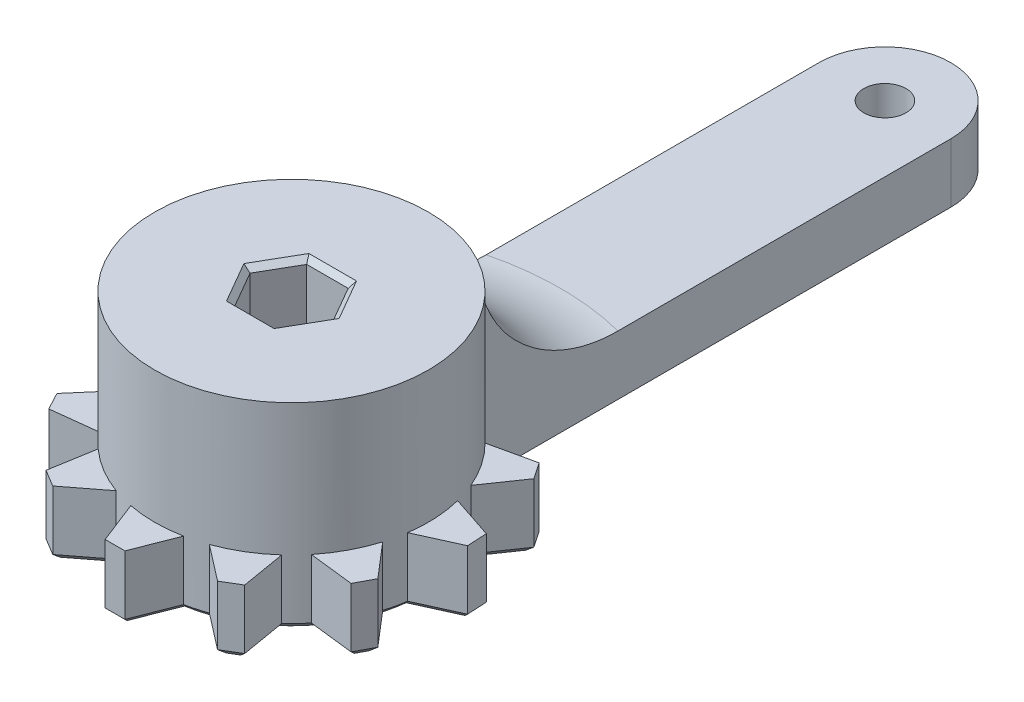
ISO-10303-21;
HEADER;
FILE_DESCRIPTION(('STEP AP214'),'2;1');
FILE_NAME('part.step','',(''),(''),'','','');
FILE_SCHEMA(('AUTOMOTIVE_DESIGN { 1 0 10303 214 1 1 1 1 }'));
ENDSEC;
DATA;
#1=APPLICATION_CONTEXT('core data for automotive mechanical design processes');
#2=APPLICATION_PROTOCOL_DEFINITION('international standard','automotive_design',2000,#1);
#3=PRODUCT_CONTEXT('',#1,'mechanical');
#4=PRODUCT('Part','Part','',(#3));
#5=PRODUCT_RELATED_PRODUCT_CATEGORY('part','',(#4));
#6=PRODUCT_DEFINITION_FORMATION('','',#4);
#7=PRODUCT_DEFINITION_CONTEXT('part definition',#1,'design');
#8=PRODUCT_DEFINITION('design','',#6,#7);
#9=PRODUCT_DEFINITION_SHAPE('','',#8);
#10=(LENGTH_UNIT() NAMED_UNIT(*) SI_UNIT(.MILLI.,.METRE.));
#11=(NAMED_UNIT(*) PLANE_ANGLE_UNIT() SI_UNIT($,.RADIAN.));
#12=(NAMED_UNIT(*) SI_UNIT($,.STERADIAN.) SOLID_ANGLE_UNIT());
#13=UNCERTAINTY_MEASURE_WITH_UNIT(LENGTH_MEASURE(1.E-05),#10,'distance_accuracy_value','');
#14=(GEOMETRIC_REPRESENTATION_CONTEXT(3) GLOBAL_UNCERTAINTY_ASSIGNED_CONTEXT((#13)) GLOBAL_UNIT_ASSIGNED_CONTEXT((#10,
#11,#12)) REPRESENTATION_CONTEXT('',''));
#15=CARTESIAN_POINT('',(0.,0.,0.));
#16=DIRECTION('',(0.,0.,1.));
#17=DIRECTION('',(1.,0.,0.));
#18=AXIS2_PLACEMENT_3D('',#15,#16,#17);
#19=CARTESIAN_POINT('',(0.,5.,0.));
#20=DIRECTION('',(0.,-1.,0.));
#21=DIRECTION('',(0.,0.,-1.));
#22=AXIS2_PLACEMENT_3D('',#19,#20,#21);
#23=CYLINDRICAL_SURFACE('',#22,1.6);
#24=CARTESIAN_POINT('',(0.,0.499999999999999,0.));
#25=DIRECTION('',(0.,1.,0.));
#26=DIRECTION('',(0.,0.,1.));
#27=AXIS2_PLACEMENT_3D('',#24,#25,#26);
#28=CIRCLE('',#27,1.6);
#29=CARTESIAN_POINT('',(0.,0.499999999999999,1.6));
#30=VERTEX_POINT('',#29);
#31=EDGE_CURVE('E1562',#30,#30,#28,.F.);
#32=ORIENTED_EDGE('',*,*,#31,.T.);
#33=EDGE_LOOP('',(#32));
#34=FACE_BOUND('',#33,.T.);
#35=CARTESIAN_POINT('',(0.,10.5,0.));
#36=DIRECTION('',(0.,1.,0.));
#37=DIRECTION('',(0.,0.,1.));
#38=AXIS2_PLACEMENT_3D('',#35,#36,#37);
#39=CIRCLE('',#38,1.6);
#40=CARTESIAN_POINT('',(0.,10.5,1.6));
#41=VERTEX_POINT('',#40);
#42=EDGE_CURVE('E539',#41,#41,#39,.T.);
#43=ORIENTED_EDGE('',*,*,#42,.T.);
#44=EDGE_LOOP('',(#43));
#45=FACE_BOUND('',#44,.T.);
#46=ADVANCED_FACE('F55',(#34,#45),#23,.F.);
#47=CARTESIAN_POINT('',(0.,5.,0.));
#48=DIRECTION('',(0.,1.,0.));
#49=DIRECTION('',(0.,0.,1.));
#50=AXIS2_PLACEMENT_3D('',#47,#48,#49);
#51=PLANE('',#50);
#52=DIRECTION('',(0.791973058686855,0.,-0.610556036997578));
#53=VECTOR('',#52,1.);
#54=CARTESIAN_POINT('',(-6.24833396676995,5.,11.8551770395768));
#55=LINE('',#54,#53);
#56=CARTESIAN_POINT('',(-6.24833396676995,5.,11.8551770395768));
#57=VERTEX_POINT('',#56);
#58=CARTESIAN_POINT('',(-3.53158545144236,5.,9.76075325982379));
#59=VERTEX_POINT('',#58);
#60=EDGE_CURVE('E741',#57,#59,#55,.T.);
#61=ORIENTED_EDGE('',*,*,#60,.T.);
#62=CARTESIAN_POINT('',(0.,5.,0.));
#63=DIRECTION('',(0.,1.,0.));
#64=DIRECTION('',(0.,0.,1.));
#65=AXIS2_PLACEMENT_3D('',#62,#63,#64);
#66=CIRCLE('',#65,10.38);
#67=CARTESIAN_POINT('',(-6.9602546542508,5.,7.70060096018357));
#68=VERTEX_POINT('',#67);
#69=EDGE_CURVE('E563',#68,#59,#66,.T.);
#70=ORIENTED_EDGE('',*,*,#69,.F.);
#71=DIRECTION('',(-0.167280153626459,0.,0.985909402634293));
#72=VECTOR('',#71,1.);
#73=CARTESIAN_POINT('',(-7.53408491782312,5.,11.0826199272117));
#74=LINE('',#73,#72);
#75=CARTESIAN_POINT('',(-7.53408491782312,5.,11.0826199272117));
#76=VERTEX_POINT('',#75);
#77=EDGE_CURVE('E725',#68,#76,#74,.T.);
#78=ORIENTED_EDGE('',*,*,#77,.T.);
#79=DIRECTION('',(0.857167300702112,0.,0.515038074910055));
#80=VECTOR('',#79,1.);
#81=CARTESIAN_POINT('',(-7.53408491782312,5.,11.0826199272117));
#82=LINE('',#81,#80);
#83=EDGE_CURVE('E737',#76,#57,#82,.T.);
#84=ORIENTED_EDGE('',*,*,#83,.T.);
#85=EDGE_LOOP('',(#61,#70,#78,#84));
#86=FACE_BOUND('',#85,.T.);
#87=ADVANCED_FACE('F858',(#86),#51,.T.);
#88=DIRECTION('',(0.993313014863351,0.,-0.115452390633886));
#89=VECTOR('',#88,1.);
#90=CARTESIAN_POINT('',(-11.461735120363,5.,6.94374020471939));
#91=LINE('',#90,#89);
#92=CARTESIAN_POINT('',(-11.461735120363,5.,6.94374020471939));
#93=VERTEX_POINT('',#92);
#94=CARTESIAN_POINT('',(-8.05431913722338,5.,6.54769755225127));
#95=VERTEX_POINT('',#94);
#96=EDGE_CURVE('E717',#93,#95,#91,.T.);
#97=ORIENTED_EDGE('',*,*,#96,.T.);
#98=CARTESIAN_POINT('',(-9.93220538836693,5.,3.01590718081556));
#99=VERTEX_POINT('',#98);
#100=EDGE_CURVE('E2019',#99,#95,#66,.T.);
#101=ORIENTED_EDGE('',*,*,#100,.F.);
#102=DIRECTION('',(-0.651167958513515,0.,0.758933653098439));
#103=VECTOR('',#102,1.);
#104=CARTESIAN_POINT('',(-12.1659424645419,5.,5.619318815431));
#105=LINE('',#104,#103);
#106=CARTESIAN_POINT('',(-12.1659424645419,5.,5.619318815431));
#107=VERTEX_POINT('',#106);
#108=EDGE_CURVE('E701',#99,#107,#105,.T.);
#109=ORIENTED_EDGE('',*,*,#108,.T.);
#110=DIRECTION('',(0.469471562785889,0.,0.882947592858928));
#111=VECTOR('',#110,1.);
#112=CARTESIAN_POINT('',(-12.1659424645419,5.,5.619318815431));
#113=LINE('',#112,#111);
#114=EDGE_CURVE('E713',#107,#93,#113,.T.);
#115=ORIENTED_EDGE('',*,*,#114,.T.);
#116=EDGE_LOOP('',(#97,#101,#109,#115));
#117=FACE_BOUND('',#116,.T.);
#118=ADVANCED_FACE('F866',(#117),#51,.T.);
#119=DIRECTION('',(0.910897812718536,0.,0.412632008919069));
#120=VECTOR('',#119,1.);
#121=CARTESIAN_POINT('',(-13.4009151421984,5.,0.0487170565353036));
#122=LINE('',#121,#120);
#123=CARTESIAN_POINT('',(-13.4009151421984,5.,0.0487170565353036));
#124=VERTEX_POINT('',#123);
#125=CARTESIAN_POINT('',(-10.2762125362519,5.,1.4641912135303));
#126=VERTEX_POINT('',#125);
#127=EDGE_CURVE('E693',#124,#126,#122,.T.);
#128=ORIENTED_EDGE('',*,*,#127,.T.);
#129=CARTESIAN_POINT('',(-10.0668687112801,5.,-2.53032692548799));
#130=VERTEX_POINT('',#129);
#131=EDGE_CURVE('E2022',#130,#126,#66,.T.);
#132=ORIENTED_EDGE('',*,*,#131,.F.);
#133=DIRECTION('',(-0.94903960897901,0.,0.31515681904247));
#134=VECTOR('',#133,1.);
#135=CARTESIAN_POINT('',(-13.322411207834,5.,-1.44922724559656));
#136=LINE('',#135,#134);
#137=CARTESIAN_POINT('',(-13.322411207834,5.,-1.44922724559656));
#138=VERTEX_POINT('',#137);
#139=EDGE_CURVE('E677',#130,#138,#136,.T.);
#140=ORIENTED_EDGE('',*,*,#139,.T.);
#141=DIRECTION('',(-0.0523359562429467,0.,0.998629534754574));
#142=VECTOR('',#141,1.);
#143=CARTESIAN_POINT('',(-13.322411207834,5.,-1.44922724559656));
#144=LINE('',#143,#142);
#145=EDGE_CURVE('E689',#138,#124,#144,.T.);
#146=ORIENTED_EDGE('',*,*,#145,.T.);
#147=EDGE_LOOP('',(#128,#132,#140,#146));
#148=FACE_BOUND('',#147,.T.);
#149=ADVANCED_FACE('F2089',(#148),#51,.T.);
#150=DIRECTION('',(0.568270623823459,0.,0.822841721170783));
#151=VECTOR('',#150,1.);
#152=CARTESIAN_POINT('',(-11.5119173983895,5.,-6.86022286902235));
#153=LINE('',#152,#151);
#154=CARTESIAN_POINT('',(-11.5119173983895,5.,-6.86022286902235));
#155=VERTEX_POINT('',#154);
#156=CARTESIAN_POINT('',(-9.56254758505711,5.,-4.03758389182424));
#157=VERTEX_POINT('',#156);
#158=EDGE_CURVE('E669',#155,#157,#153,.T.);
#159=ORIENTED_EDGE('',*,*,#158,.T.);
#160=CARTESIAN_POINT('',(-7.32577597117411,5.,-7.35373418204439));
#161=VERTEX_POINT('',#160);
#162=EDGE_CURVE('E2025',#161,#157,#66,.T.);
#163=ORIENTED_EDGE('',*,*,#162,.F.);
#164=DIRECTION('',(-0.975803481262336,0.,-0.218649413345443));
#165=VECTOR('',#164,1.);
#166=CARTESIAN_POINT('',(-10.6731280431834,5.,-8.10377922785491));
#167=LINE('',#166,#165);
#168=CARTESIAN_POINT('',(-10.6731280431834,5.,-8.10377922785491));
#169=VERTEX_POINT('',#168);
#170=EDGE_CURVE('E653',#161,#169,#167,.T.);
#171=ORIENTED_EDGE('',*,*,#170,.T.);
#172=DIRECTION('',(-0.55919290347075,0.,0.82903757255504));
#173=VECTOR('',#172,1.);
#174=CARTESIAN_POINT('',(-10.6731280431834,5.,-8.10377922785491));
#175=LINE('',#174,#173);
#176=EDGE_CURVE('E665',#169,#155,#175,.T.);
#177=ORIENTED_EDGE('',*,*,#176,.T.);
#178=EDGE_LOOP('',(#159,#163,#171,#177));
#179=FACE_BOUND('',#178,.T.);
#180=ADVANCED_FACE('F2083',(#179),#51,.T.);
#181=CARTESIAN_POINT('',(0.,5.,-45.));
#182=DIRECTION('',(0.,1.,0.));
#183=DIRECTION('',(0.,0.,1.));
#184=AXIS2_PLACEMENT_3D('',#181,#182,#183);
#185=CIRCLE('',#184,1.6);
#186=CARTESIAN_POINT('',(0.,5.,-43.4));
#187=VERTEX_POINT('',#186);
#188=EDGE_CURVE('E791',#187,#187,#185,.T.);
#189=ORIENTED_EDGE('',*,*,#188,.F.);
#190=EDGE_LOOP('',(#189));
#191=FACE_BOUND('',#190,.T.);
#192=DIRECTION('',(0.,0.,-1.));
#193=VECTOR('',#192,1.);
#194=CARTESIAN_POINT('',(-5.,5.,0.));
#195=LINE('',#194,#193);
#196=CARTESIAN_POINT('',(-5.,5.,-19.7571354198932));
#197=VERTEX_POINT('',#196);
#198=CARTESIAN_POINT('',(-5.,5.,-45.));
#199=VERTEX_POINT('',#198);
#200=EDGE_CURVE('E773',#197,#199,#195,.T.);
#201=ORIENTED_EDGE('',*,*,#200,.F.);
#202=CARTESIAN_POINT('',(0.,5.,0.));
#203=DIRECTION('',(0.,1.,0.));
#204=DIRECTION('',(0.,0.,1.));
#205=AXIS2_PLACEMENT_3D('',#202,#203,#204);
#206=CIRCLE('',#205,20.38);
#207=CARTESIAN_POINT('',(5.,5.,-19.7571354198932));
#208=VERTEX_POINT('',#207);
#209=EDGE_CURVE('E811',#197,#208,#206,.F.);
#210=ORIENTED_EDGE('',*,*,#209,.T.);
#211=DIRECTION('',(0.,0.,-1.));
#212=VECTOR('',#211,1.);
#213=CARTESIAN_POINT('',(5.,5.,0.));
#214=LINE('',#213,#212);
#215=CARTESIAN_POINT('',(5.,5.,-45.));
#216=VERTEX_POINT('',#215);
#217=EDGE_CURVE('E784',#208,#216,#214,.T.);
#218=ORIENTED_EDGE('',*,*,#217,.T.);
#219=CARTESIAN_POINT('',(0.,5.,-45.));
#220=DIRECTION('',(0.,1.,0.));
#221=DIRECTION('',(0.,0.,1.));
#222=AXIS2_PLACEMENT_3D('',#219,#220,#221);
#223=CIRCLE('',#222,5.);
#224=EDGE_CURVE('E787',#216,#199,#223,.T.);
#225=ORIENTED_EDGE('',*,*,#224,.T.);
#226=EDGE_LOOP('',(#201,#210,#218,#225));
#227=FACE_BOUND('',#226,.T.);
#228=ADVANCED_FACE('F2055',(#191,#227),#51,.T.);
#229=DIRECTION('',(-0.975803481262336,0.,0.218649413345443));
#230=VECTOR('',#229,1.);
#231=CARTESIAN_POINT('',(10.6731280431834,5.,-8.10377922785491));
#232=LINE('',#231,#230);
#233=CARTESIAN_POINT('',(10.6731280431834,5.,-8.10377922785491));
#234=VERTEX_POINT('',#233);
#235=CARTESIAN_POINT('',(7.32577597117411,5.,-7.35373418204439));
#236=VERTEX_POINT('',#235);
#237=EDGE_CURVE('E573',#234,#236,#232,.T.);
#238=ORIENTED_EDGE('',*,*,#237,.T.);
#239=CARTESIAN_POINT('',(9.56254758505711,5.,-4.03758389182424));
#240=VERTEX_POINT('',#239);
#241=EDGE_CURVE('E2028',#240,#236,#66,.T.);
#242=ORIENTED_EDGE('',*,*,#241,.F.);
#243=DIRECTION('',(0.568270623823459,0.,-0.822841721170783));
#244=VECTOR('',#243,1.);
#245=CARTESIAN_POINT('',(11.5119173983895,5.,-6.86022286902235));
#246=LINE('',#245,#244);
#247=CARTESIAN_POINT('',(11.5119173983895,5.,-6.86022286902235));
#248=VERTEX_POINT('',#247);
#249=EDGE_CURVE('E557',#240,#248,#246,.T.);
#250=ORIENTED_EDGE('',*,*,#249,.T.);
#251=DIRECTION('',(-0.55919290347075,0.,-0.82903757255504));
#252=VECTOR('',#251,1.);
#253=CARTESIAN_POINT('',(11.5119173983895,5.,-6.86022286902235));
#254=LINE('',#253,#252);
#255=EDGE_CURVE('E569',#248,#234,#254,.T.);
#256=ORIENTED_EDGE('',*,*,#255,.T.);
#257=EDGE_LOOP('',(#238,#242,#250,#256));
#258=FACE_BOUND('',#257,.T.);
#259=ADVANCED_FACE('F2073',(#258),#51,.T.);
#260=DIRECTION('',(-0.94903960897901,0.,-0.31515681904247));
#261=VECTOR('',#260,1.);
#262=CARTESIAN_POINT('',(13.322411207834,5.,-1.44922724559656));
#263=LINE('',#262,#261);
#264=CARTESIAN_POINT('',(13.322411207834,5.,-1.44922724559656));
#265=VERTEX_POINT('',#264);
#266=CARTESIAN_POINT('',(10.0668687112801,5.,-2.53032692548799));
#267=VERTEX_POINT('',#266);
#268=EDGE_CURVE('E597',#265,#267,#263,.T.);
#269=ORIENTED_EDGE('',*,*,#268,.T.);
#270=CARTESIAN_POINT('',(10.2762125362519,5.,1.4641912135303));
#271=VERTEX_POINT('',#270);
#272=EDGE_CURVE('E2032',#271,#267,#66,.T.);
#273=ORIENTED_EDGE('',*,*,#272,.F.);
#274=DIRECTION('',(0.910897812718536,0.,-0.412632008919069));
#275=VECTOR('',#274,1.);
#276=CARTESIAN_POINT('',(13.4009151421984,5.,0.0487170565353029));
#277=LINE('',#276,#275);
#278=CARTESIAN_POINT('',(13.4009151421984,5.,0.0487170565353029));
#279=VERTEX_POINT('',#278);
#280=EDGE_CURVE('E581',#271,#279,#277,.T.);
#281=ORIENTED_EDGE('',*,*,#280,.T.);
#282=DIRECTION('',(-0.0523359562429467,0.,-0.998629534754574));
#283=VECTOR('',#282,1.);
#284=CARTESIAN_POINT('',(13.4009151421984,5.,0.0487170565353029));
#285=LINE('',#284,#283);
#286=EDGE_CURVE('E593',#279,#265,#285,.T.);
#287=ORIENTED_EDGE('',*,*,#286,.T.);
#288=EDGE_LOOP('',(#269,#273,#281,#287));
#289=FACE_BOUND('',#288,.T.);
#290=ADVANCED_FACE('F2075',(#289),#51,.T.);
#291=DIRECTION('',(-0.651167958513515,0.,-0.758933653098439));
#292=VECTOR('',#291,1.);
#293=CARTESIAN_POINT('',(12.1659424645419,5.,5.619318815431));
#294=LINE('',#293,#292);
#295=CARTESIAN_POINT('',(12.1659424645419,5.,5.619318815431));
#296=VERTEX_POINT('',#295);
#297=CARTESIAN_POINT('',(9.93220538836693,5.,3.01590718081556));
#298=VERTEX_POINT('',#297);
#299=EDGE_CURVE('E621',#296,#298,#294,.T.);
#300=ORIENTED_EDGE('',*,*,#299,.T.);
#301=CARTESIAN_POINT('',(8.05431913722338,5.,6.54769755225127));
#302=VERTEX_POINT('',#301);
#303=EDGE_CURVE('E2037',#302,#298,#66,.T.);
#304=ORIENTED_EDGE('',*,*,#303,.F.);
#305=DIRECTION('',(0.993313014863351,0.,0.115452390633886));
#306=VECTOR('',#305,1.);
#307=CARTESIAN_POINT('',(11.461735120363,5.,6.94374020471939));
#308=LINE('',#307,#306);
#309=CARTESIAN_POINT('',(11.461735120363,5.,6.94374020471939));
#310=VERTEX_POINT('',#309);
#311=EDGE_CURVE('E605',#302,#310,#308,.T.);
#312=ORIENTED_EDGE('',*,*,#311,.T.);
#313=DIRECTION('',(0.469471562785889,0.,-0.882947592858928));
#314=VECTOR('',#313,1.);
#315=CARTESIAN_POINT('',(11.461735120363,5.,6.94374020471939));
#316=LINE('',#315,#314);
#317=EDGE_CURVE('E617',#310,#296,#316,.T.);
#318=ORIENTED_EDGE('',*,*,#317,.T.);
#319=EDGE_LOOP('',(#300,#304,#312,#318));
#320=FACE_BOUND('',#319,.T.);
#321=ADVANCED_FACE('F2080',(#320),#51,.T.);
#322=DIRECTION('',(-0.167280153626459,0.,-0.985909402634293));
#323=VECTOR('',#322,1.);
#324=CARTESIAN_POINT('',(7.53408491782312,5.,11.0826199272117));
#325=LINE('',#324,#323);
#326=CARTESIAN_POINT('',(7.53408491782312,5.,11.0826199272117));
#327=VERTEX_POINT('',#326);
#328=CARTESIAN_POINT('',(6.9602546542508,5.,7.70060096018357));
#329=VERTEX_POINT('',#328);
#330=EDGE_CURVE('E645',#327,#329,#325,.T.);
#331=ORIENTED_EDGE('',*,*,#330,.T.);
#332=CARTESIAN_POINT('',(3.53158545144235,5.,9.76075325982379));
#333=VERTEX_POINT('',#332);
#334=EDGE_CURVE('E565',#333,#329,#66,.T.);
#335=ORIENTED_EDGE('',*,*,#334,.F.);
#336=DIRECTION('',(0.791973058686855,0.,0.610556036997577));
#337=VECTOR('',#336,1.);
#338=CARTESIAN_POINT('',(6.24833396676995,5.,11.8551770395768));
#339=LINE('',#338,#337);
#340=CARTESIAN_POINT('',(6.24833396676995,5.,11.8551770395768));
#341=VERTEX_POINT('',#340);
#342=EDGE_CURVE('E629',#333,#341,#339,.T.);
#343=ORIENTED_EDGE('',*,*,#342,.T.);
#344=DIRECTION('',(0.857167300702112,0.,-0.515038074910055));
#345=VECTOR('',#344,1.);
#346=CARTESIAN_POINT('',(6.24833396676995,5.,11.8551770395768));
#347=LINE('',#346,#345);
#348=EDGE_CURVE('E641',#341,#327,#347,.T.);
#349=ORIENTED_EDGE('',*,*,#348,.T.);
#350=EDGE_LOOP('',(#331,#335,#343,#349));
#351=FACE_BOUND('',#350,.T.);
#352=ADVANCED_FACE('F2435',(#351),#51,.T.);
#353=DIRECTION('',(0.364393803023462,0.,-0.931244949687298));
#354=VECTOR('',#353,1.);
#355=CARTESIAN_POINT('',(0.75,5.,13.38));
#356=LINE('',#355,#354);
#357=CARTESIAN_POINT('',(0.75,5.,13.38));
#358=VERTEX_POINT('',#357);
#359=CARTESIAN_POINT('',(2.,5.,10.1854994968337));
#360=VERTEX_POINT('',#359);
#361=EDGE_CURVE('E765',#358,#360,#356,.T.);
#362=ORIENTED_EDGE('',*,*,#361,.T.);
#363=CARTESIAN_POINT('',(-2.,5.,10.1854994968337));
#364=VERTEX_POINT('',#363);
#365=EDGE_CURVE('E559',#364,#360,#66,.T.);
#366=ORIENTED_EDGE('',*,*,#365,.F.);
#367=DIRECTION('',(0.364393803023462,0.,0.931244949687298));
#368=VECTOR('',#367,1.);
#369=CARTESIAN_POINT('',(-0.75,5.,13.38));
#370=LINE('',#369,#368);
#371=CARTESIAN_POINT('',(-0.75,5.,13.38));
#372=VERTEX_POINT('',#371);
#373=EDGE_CURVE('E749',#364,#372,#370,.T.);
#374=ORIENTED_EDGE('',*,*,#373,.T.);
#375=DIRECTION('',(1.,0.,0.));
#376=VECTOR('',#375,1.);
#377=CARTESIAN_POINT('',(-0.75,5.,13.38));
#378=LINE('',#377,#376);
#379=EDGE_CURVE('E761',#372,#358,#378,.T.);
#380=ORIENTED_EDGE('',*,*,#379,.T.);
#381=EDGE_LOOP('',(#362,#366,#374,#380));
#382=FACE_BOUND('',#381,.T.);
#383=ADVANCED_FACE('F838',(#382),#51,.T.);
#384=CARTESIAN_POINT('',(-5.,5.,0.));
#385=DIRECTION('',(-1.,0.,0.));
#386=DIRECTION('',(0.,0.,1.));
#387=AXIS2_PLACEMENT_3D('',#384,#385,#386);
#388=PLANE('',#387);
#389=DIRECTION('',(0.,-1.,0.));
#390=VECTOR('',#389,1.);
#391=CARTESIAN_POINT('',(-5.,5.,-45.));
#392=LINE('',#391,#390);
#393=CARTESIAN_POINT('',(-5.,0.499999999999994,-45.));
#394=VERTEX_POINT('',#393);
#395=EDGE_CURVE('E795',#199,#394,#392,.T.);
#396=ORIENTED_EDGE('',*,*,#395,.T.);
#397=DIRECTION('',(0.,0.,1.));
#398=VECTOR('',#397,1.);
#399=CARTESIAN_POINT('',(-5.,0.499999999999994,-9.09639489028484));
#400=LINE('',#399,#398);
#401=CARTESIAN_POINT('',(-5.,0.499999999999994,-9.09639489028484));
#402=VERTEX_POINT('',#401);
#403=EDGE_CURVE('E1027',#394,#402,#400,.T.);
#404=ORIENTED_EDGE('',*,*,#403,.T.);
#405=DIRECTION('',(0.,-1.,0.));
#406=VECTOR('',#405,1.);
#407=CARTESIAN_POINT('',(-5.,5.,-9.09639489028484));
#408=LINE('',#407,#406);
#409=CARTESIAN_POINT('',(-5.,15.,-9.09639489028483));
#410=VERTEX_POINT('',#409);
#411=EDGE_CURVE('E807',#410,#402,#408,.T.);
#412=ORIENTED_EDGE('',*,*,#411,.F.);
#413=CARTESIAN_POINT('',(-5.,15.,-9.09639489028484));
#414=CARTESIAN_POINT('',(-5.,14.8687480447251,-9.0963927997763));
#415=CARTESIAN_POINT('',(-5.,14.7375142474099,-9.09934433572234));
#416=CARTESIAN_POINT('',(-5.,14.4753156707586,-9.11112716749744));
#417=CARTESIAN_POINT('',(-5.,14.3443508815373,-9.11995824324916));
#418=CARTESIAN_POINT('',(-5.,13.9523959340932,-9.15521174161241));
#419=CARTESIAN_POINT('',(-5.,13.6921420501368,-9.19039452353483));
#420=CARTESIAN_POINT('',(-5.,13.1770833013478,-9.28325461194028));
#421=CARTESIAN_POINT('',(-5.,12.9222576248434,-9.34081797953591));
#422=CARTESIAN_POINT('',(-5.,12.4184350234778,-9.47749381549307));
#423=CARTESIAN_POINT('',(-5.,12.1694386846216,-9.55660844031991));
#424=CARTESIAN_POINT('',(-5.,11.6793566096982,-9.73504855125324));
#425=CARTESIAN_POINT('',(-5.,11.4382563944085,-9.8343343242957));
#426=CARTESIAN_POINT('',(-5.,10.9648609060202,-10.0519079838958));
#427=CARTESIAN_POINT('',(-5.,10.7325655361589,-10.1701956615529));
#428=CARTESIAN_POINT('',(-5.,10.0501269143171,-10.5519360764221));
#429=CARTESIAN_POINT('',(-5.,9.61469523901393,-10.8421683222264));
#430=CARTESIAN_POINT('',(-5.,8.76126564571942,-11.5074191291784));
#431=CARTESIAN_POINT('',(-5.,8.34691617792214,-11.8871091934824));
#432=CARTESIAN_POINT('',(-5.,7.77295154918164,-12.500523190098));
#433=CARTESIAN_POINT('',(-5.,7.58947115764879,-12.7124328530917));
#434=CARTESIAN_POINT('',(-5.,7.23921940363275,-13.1496146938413));
#435=CARTESIAN_POINT('',(-5.,7.07244357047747,-13.3748832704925));
#436=CARTESIAN_POINT('',(-5.,6.74227484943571,-13.858230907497));
#437=CARTESIAN_POINT('',(-5.,6.58053427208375,-14.1174389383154));
#438=CARTESIAN_POINT('',(-5.,6.27908064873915,-14.6482548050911));
#439=CARTESIAN_POINT('',(-5.,6.13936070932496,-14.9198587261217));
#440=CARTESIAN_POINT('',(-5.,5.88291290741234,-15.473679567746));
#441=CARTESIAN_POINT('',(-5.,5.76618287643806,-15.7558954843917));
#442=CARTESIAN_POINT('',(-5.,5.55663182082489,-16.3290378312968));
#443=CARTESIAN_POINT('',(-5.,5.463806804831,-16.6199627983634));
#444=CARTESIAN_POINT('',(-5.,5.32007287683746,-17.1455764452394));
#445=CARTESIAN_POINT('',(-5.,5.2644452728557,-17.3789870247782));
#446=CARTESIAN_POINT('',(-5.,5.16878359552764,-17.8489547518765));
#447=CARTESIAN_POINT('',(-5.,5.12874694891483,-18.0855113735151));
#448=CARTESIAN_POINT('',(-5.,5.06455161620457,-18.5606754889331));
#449=CARTESIAN_POINT('',(-5.,5.04038672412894,-18.799282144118));
#450=CARTESIAN_POINT('',(-5.,5.00810294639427,-19.2776339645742));
#451=CARTESIAN_POINT('',(-5.,4.99998786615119,-19.5173793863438));
#452=CARTESIAN_POINT('',(-5.,5.,-19.7571354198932));
#453=B_SPLINE_CURVE_WITH_KNOTS('',3,(#413,#414,#415,#416,#417,#418,#419,#420,#421,#422,#423,
#424,#425,#426,#427,#428,#429,#430,#431,#432,#433,#434,#435,#436,#437,#438,#439,#440,#441,#442,
#443,#444,#445,#446,#447,#448,#449,#450,#451,#452),.UNSPECIFIED.,.F.,.F.,(4,2,2,2,2,2,2,2,2,2,2,
2,2,2,2,2,2,2,2,4),(0.,0.393686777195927,0.787358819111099,1.57409567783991,2.35687864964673,
3.13973997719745,3.92107468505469,4.70240080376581,6.2658884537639,7.94457549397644,
8.78481888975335,9.62483680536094,10.5403798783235,11.4556357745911,12.3708052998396,
13.2858219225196,14.0051662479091,14.7243917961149,15.4433359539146,16.1624505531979),.UNSPECIFIED.);
#454=EDGE_CURVE('E814',#410,#197,#453,.T.);
#455=ORIENTED_EDGE('',*,*,#454,.T.);
#456=ORIENTED_EDGE('',*,*,#200,.T.);
#457=EDGE_LOOP('',(#396,#404,#412,#455,#456));
#458=FACE_BOUND('',#457,.T.);
#459=ADVANCED_FACE('F833',(#458),#388,.T.);
#460=CARTESIAN_POINT('',(0.,5.,0.));
#461=DIRECTION('',(0.,-1.,0.));
#462=DIRECTION('',(0.,0.,-1.));
#463=AXIS2_PLACEMENT_3D('',#460,#461,#462);
#464=CYLINDRICAL_SURFACE('',#463,10.38);
#465=ORIENTED_EDGE('',*,*,#411,.T.);
#466=CARTESIAN_POINT('',(0.,0.499999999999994,0.));
#467=DIRECTION('',(0.,1.,0.));
#468=DIRECTION('',(0.,0.,1.));
#469=AXIS2_PLACEMENT_3D('',#466,#467,#468);
#470=CIRCLE('',#469,10.38);
#471=CARTESIAN_POINT('',(-7.3257759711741,0.499999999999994,-7.35373418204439));
#472=VERTEX_POINT('',#471);
#473=EDGE_CURVE('E1608',#402,#472,#470,.T.);
#474=ORIENTED_EDGE('',*,*,#473,.T.);
#475=DIRECTION('',(0.,1.,0.));
#476=VECTOR('',#475,1.);
#477=CARTESIAN_POINT('',(-7.3257759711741,-5.83589963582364,-7.35373418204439));
#478=LINE('',#477,#476);
#479=EDGE_CURVE('E674',#472,#161,#478,.T.);
#480=ORIENTED_EDGE('',*,*,#479,.T.);
#481=ORIENTED_EDGE('',*,*,#162,.T.);
#482=DIRECTION('',(0.,1.,0.));
#483=VECTOR('',#482,1.);
#484=CARTESIAN_POINT('',(-9.5625475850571,-5.83589963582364,-4.03758389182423));
#485=LINE('',#484,#483);
#486=CARTESIAN_POINT('',(-9.5625475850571,0.499999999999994,-4.03758389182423));
#487=VERTEX_POINT('',#486);
#488=EDGE_CURVE('E678',#487,#157,#485,.T.);
#489=ORIENTED_EDGE('',*,*,#488,.F.);
#490=CARTESIAN_POINT('',(0.,0.499999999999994,0.));
#491=DIRECTION('',(0.,1.,0.));
#492=DIRECTION('',(0.,0.,1.));
#493=AXIS2_PLACEMENT_3D('',#490,#491,#492);
#494=CIRCLE('',#493,10.38);
#495=CARTESIAN_POINT('',(-10.0668687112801,0.499999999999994,-2.53032692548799));
#496=VERTEX_POINT('',#495);
#497=EDGE_CURVE('E1605',#487,#496,#494,.T.);
#498=ORIENTED_EDGE('',*,*,#497,.T.);
#499=DIRECTION('',(0.,1.,0.));
#500=VECTOR('',#499,1.);
#501=CARTESIAN_POINT('',(-10.0668687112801,-5.20307993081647,-2.53032692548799));
#502=LINE('',#501,#500);
#503=EDGE_CURVE('E698',#496,#130,#502,.T.);
#504=ORIENTED_EDGE('',*,*,#503,.T.);
#505=ORIENTED_EDGE('',*,*,#131,.T.);
#506=DIRECTION('',(0.,1.,0.));
#507=VECTOR('',#506,1.);
#508=CARTESIAN_POINT('',(-10.2762125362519,-5.20307993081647,1.4641912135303));
#509=LINE('',#508,#507);
#510=CARTESIAN_POINT('',(-10.2762125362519,0.499999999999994,1.4641912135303));
#511=VERTEX_POINT('',#510);
#512=EDGE_CURVE('E702',#511,#126,#509,.T.);
#513=ORIENTED_EDGE('',*,*,#512,.F.);
#514=CARTESIAN_POINT('',(0.,0.499999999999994,0.));
#515=DIRECTION('',(0.,1.,0.));
#516=DIRECTION('',(0.,0.,1.));
#517=AXIS2_PLACEMENT_3D('',#514,#515,#516);
#518=CIRCLE('',#517,10.38);
#519=CARTESIAN_POINT('',(-9.93220538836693,0.499999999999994,3.01590718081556));
#520=VERTEX_POINT('',#519);
#521=EDGE_CURVE('E1602',#511,#520,#518,.T.);
#522=ORIENTED_EDGE('',*,*,#521,.T.);
#523=DIRECTION('',(0.,1.,0.));
#524=VECTOR('',#523,1.);
#525=CARTESIAN_POINT('',(-9.93220538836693,-5.68623941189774,3.01590718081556));
#526=LINE('',#525,#524);
#527=EDGE_CURVE('E722',#520,#99,#526,.T.);
#528=ORIENTED_EDGE('',*,*,#527,.T.);
#529=ORIENTED_EDGE('',*,*,#100,.T.);
#530=DIRECTION('',(0.,1.,0.));
#531=VECTOR('',#530,1.);
#532=CARTESIAN_POINT('',(-8.05431913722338,-5.68623941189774,6.54769755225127));
#533=LINE('',#532,#531);
#534=CARTESIAN_POINT('',(-8.05431913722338,0.499999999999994,6.54769755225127));
#535=VERTEX_POINT('',#534);
#536=EDGE_CURVE('E726',#535,#95,#533,.T.);
#537=ORIENTED_EDGE('',*,*,#536,.F.);
#538=CARTESIAN_POINT('',(0.,0.499999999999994,0.));
#539=DIRECTION('',(0.,1.,0.));
#540=DIRECTION('',(0.,0.,1.));
#541=AXIS2_PLACEMENT_3D('',#538,#539,#540);
#542=CIRCLE('',#541,10.38);
#543=CARTESIAN_POINT('',(-6.96025465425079,0.499999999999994,7.70060096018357));
#544=VERTEX_POINT('',#543);
#545=EDGE_CURVE('E1599',#535,#544,#542,.T.);
#546=ORIENTED_EDGE('',*,*,#545,.T.);
#547=DIRECTION('',(0.,1.,0.));
#548=VECTOR('',#547,1.);
#549=CARTESIAN_POINT('',(-6.96025465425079,-5.76892575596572,7.70060096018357));
#550=LINE('',#549,#548);
#551=EDGE_CURVE('E746',#544,#68,#550,.T.);
#552=ORIENTED_EDGE('',*,*,#551,.T.);
#553=ORIENTED_EDGE('',*,*,#69,.T.);
#554=DIRECTION('',(0.,1.,0.));
#555=VECTOR('',#554,1.);
#556=CARTESIAN_POINT('',(-3.53158545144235,-5.76892575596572,9.76075325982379));
#557=LINE('',#556,#555);
#558=CARTESIAN_POINT('',(-3.53158545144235,0.499999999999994,9.76075325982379));
#559=VERTEX_POINT('',#558);
#560=EDGE_CURVE('E750',#559,#59,#557,.T.);
#561=ORIENTED_EDGE('',*,*,#560,.F.);
#562=CARTESIAN_POINT('',(0.,0.499999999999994,0.));
#563=DIRECTION('',(0.,1.,0.));
#564=DIRECTION('',(0.,0.,1.));
#565=AXIS2_PLACEMENT_3D('',#562,#563,#564);
#566=CIRCLE('',#565,10.38);
#567=CARTESIAN_POINT('',(-2.,0.499999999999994,10.1854994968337));
#568=VERTEX_POINT('',#567);
#569=EDGE_CURVE('E1596',#559,#568,#566,.T.);
#570=ORIENTED_EDGE('',*,*,#569,.T.);
#571=DIRECTION('',(0.,1.,0.));
#572=VECTOR('',#571,1.);
#573=CARTESIAN_POINT('',(-2.,-5.11906568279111,10.1854994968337));
#574=LINE('',#573,#572);
#575=EDGE_CURVE('E770',#568,#364,#574,.T.);
#576=ORIENTED_EDGE('',*,*,#575,.T.);
#577=ORIENTED_EDGE('',*,*,#365,.T.);
#578=DIRECTION('',(0.,1.,0.));
#579=VECTOR('',#578,1.);
#580=CARTESIAN_POINT('',(2.,-5.11906568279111,10.1854994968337));
#581=LINE('',#580,#579);
#582=CARTESIAN_POINT('',(2.,0.499999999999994,10.1854994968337));
#583=VERTEX_POINT('',#582);
#584=EDGE_CURVE('E774',#583,#360,#581,.T.);
#585=ORIENTED_EDGE('',*,*,#584,.F.);
#586=CARTESIAN_POINT('',(0.,0.499999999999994,0.));
#587=DIRECTION('',(0.,1.,0.));
#588=DIRECTION('',(0.,0.,1.));
#589=AXIS2_PLACEMENT_3D('',#586,#587,#588);
#590=CIRCLE('',#589,10.38);
#591=CARTESIAN_POINT('',(3.53158545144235,0.499999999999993,9.76075325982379));
#592=VERTEX_POINT('',#591);
#593=EDGE_CURVE('E1593',#583,#592,#590,.T.);
#594=ORIENTED_EDGE('',*,*,#593,.T.);
#595=DIRECTION('',(0.,1.,0.));
#596=VECTOR('',#595,1.);
#597=CARTESIAN_POINT('',(3.53158545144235,-5.76892575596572,9.76075325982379));
#598=LINE('',#597,#596);
#599=EDGE_CURVE('E650',#592,#333,#598,.T.);
#600=ORIENTED_EDGE('',*,*,#599,.T.);
#601=ORIENTED_EDGE('',*,*,#334,.T.);
#602=DIRECTION('',(0.,1.,0.));
#603=VECTOR('',#602,1.);
#604=CARTESIAN_POINT('',(6.9602546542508,-5.76892575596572,7.70060096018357));
#605=LINE('',#604,#603);
#606=CARTESIAN_POINT('',(6.9602546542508,0.499999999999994,7.70060096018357));
#607=VERTEX_POINT('',#606);
#608=EDGE_CURVE('E654',#607,#329,#605,.T.);
#609=ORIENTED_EDGE('',*,*,#608,.F.);
#610=CARTESIAN_POINT('',(0.,0.499999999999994,0.));
#611=DIRECTION('',(0.,1.,0.));
#612=DIRECTION('',(0.,0.,1.));
#613=AXIS2_PLACEMENT_3D('',#610,#611,#612);
#614=CIRCLE('',#613,10.38);
#615=CARTESIAN_POINT('',(8.05431913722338,0.499999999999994,6.54769755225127));
#616=VERTEX_POINT('',#615);
#617=EDGE_CURVE('E1590',#607,#616,#614,.T.);
#618=ORIENTED_EDGE('',*,*,#617,.T.);
#619=DIRECTION('',(0.,1.,0.));
#620=VECTOR('',#619,1.);
#621=CARTESIAN_POINT('',(8.05431913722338,-5.68623941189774,6.54769755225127));
#622=LINE('',#621,#620);
#623=EDGE_CURVE('E626',#616,#302,#622,.T.);
#624=ORIENTED_EDGE('',*,*,#623,.T.);
#625=ORIENTED_EDGE('',*,*,#303,.T.);
#626=DIRECTION('',(0.,1.,0.));
#627=VECTOR('',#626,1.);
#628=CARTESIAN_POINT('',(9.93220538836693,-5.68623941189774,3.01590718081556));
#629=LINE('',#628,#627);
#630=CARTESIAN_POINT('',(9.93220538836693,0.499999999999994,3.01590718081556));
#631=VERTEX_POINT('',#630);
#632=EDGE_CURVE('E630',#631,#298,#629,.T.);
#633=ORIENTED_EDGE('',*,*,#632,.F.);
#634=CARTESIAN_POINT('',(0.,0.499999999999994,0.));
#635=DIRECTION('',(0.,1.,0.));
#636=DIRECTION('',(0.,0.,1.));
#637=AXIS2_PLACEMENT_3D('',#634,#635,#636);
#638=CIRCLE('',#637,10.38);
#639=CARTESIAN_POINT('',(10.2762125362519,0.499999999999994,1.4641912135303));
#640=VERTEX_POINT('',#639);
#641=EDGE_CURVE('E1587',#631,#640,#638,.T.);
#642=ORIENTED_EDGE('',*,*,#641,.T.);
#643=DIRECTION('',(0.,1.,0.));
#644=VECTOR('',#643,1.);
#645=CARTESIAN_POINT('',(10.2762125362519,-5.20307993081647,1.4641912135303));
#646=LINE('',#645,#644);
#647=EDGE_CURVE('E602',#640,#271,#646,.T.);
#648=ORIENTED_EDGE('',*,*,#647,.T.);
#649=ORIENTED_EDGE('',*,*,#272,.T.);
#650=DIRECTION('',(0.,1.,0.));
#651=VECTOR('',#650,1.);
#652=CARTESIAN_POINT('',(10.0668687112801,-5.20307993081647,-2.53032692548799));
#653=LINE('',#652,#651);
#654=CARTESIAN_POINT('',(10.0668687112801,0.499999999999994,-2.53032692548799));
#655=VERTEX_POINT('',#654);
#656=EDGE_CURVE('E606',#655,#267,#653,.T.);
#657=ORIENTED_EDGE('',*,*,#656,.F.);
#658=CARTESIAN_POINT('',(0.,0.499999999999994,0.));
#659=DIRECTION('',(0.,1.,0.));
#660=DIRECTION('',(0.,0.,1.));
#661=AXIS2_PLACEMENT_3D('',#658,#659,#660);
#662=CIRCLE('',#661,10.38);
#663=CARTESIAN_POINT('',(9.5625475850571,0.499999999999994,-4.03758389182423));
#664=VERTEX_POINT('',#663);
#665=EDGE_CURVE('E1584',#655,#664,#662,.T.);
#666=ORIENTED_EDGE('',*,*,#665,.T.);
#667=DIRECTION('',(0.,1.,0.));
#668=VECTOR('',#667,1.);
#669=CARTESIAN_POINT('',(9.5625475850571,-5.83589963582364,-4.03758389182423));
#670=LINE('',#669,#668);
#671=EDGE_CURVE('E578',#664,#240,#670,.T.);
#672=ORIENTED_EDGE('',*,*,#671,.T.);
#673=ORIENTED_EDGE('',*,*,#241,.T.);
#674=DIRECTION('',(0.,1.,0.));
#675=VECTOR('',#674,1.);
#676=CARTESIAN_POINT('',(7.3257759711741,-5.83589963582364,-7.35373418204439));
#677=LINE('',#676,#675);
#678=CARTESIAN_POINT('',(7.3257759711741,0.499999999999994,-7.35373418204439));
#679=VERTEX_POINT('',#678);
#680=EDGE_CURVE('E582',#679,#236,#677,.T.);
#681=ORIENTED_EDGE('',*,*,#680,.F.);
#682=CARTESIAN_POINT('',(0.,0.499999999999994,0.));
#683=DIRECTION('',(0.,1.,0.));
#684=DIRECTION('',(0.,0.,1.));
#685=AXIS2_PLACEMENT_3D('',#682,#683,#684);
#686=CIRCLE('',#685,10.38);
#687=CARTESIAN_POINT('',(5.,0.499999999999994,-9.09639489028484));
#688=VERTEX_POINT('',#687);
#689=EDGE_CURVE('E1581',#679,#688,#686,.T.);
#690=ORIENTED_EDGE('',*,*,#689,.T.);
#691=DIRECTION('',(0.,-1.,0.));
#692=VECTOR('',#691,1.);
#693=CARTESIAN_POINT('',(5.,5.,-9.09639489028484));
#694=LINE('',#693,#692);
#695=CARTESIAN_POINT('',(5.,15.,-9.09639489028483));
#696=VERTEX_POINT('',#695);
#697=EDGE_CURVE('E803',#696,#688,#694,.T.);
#698=ORIENTED_EDGE('',*,*,#697,.F.);
#699=CARTESIAN_POINT('',(0.,15.,0.));
#700=DIRECTION('',(0.,1.,0.));
#701=DIRECTION('',(0.,0.,1.));
#702=AXIS2_PLACEMENT_3D('',#699,#700,#701);
#703=CIRCLE('',#702,10.38);
#704=EDGE_CURVE('E558',#410,#696,#703,.T.);
#705=ORIENTED_EDGE('',*,*,#704,.F.);
#706=EDGE_LOOP('',(#465,#474,#480,#481,#489,#498,#504,#505,#513,#522,#528,#529,#537,#546,#552,
#553,#561,#570,#576,#577,#585,#594,#600,#601,#609,#618,#624,#625,#633,#642,#648,#649,#657,#666,
#672,#673,#681,#690,#698,#705));
#707=FACE_BOUND('',#706,.T.);
#708=ADVANCED_FACE('F837',(#707),#464,.T.);
#709=CARTESIAN_POINT('',(5.,5.,0.));
#710=DIRECTION('',(-1.,0.,0.));
#711=DIRECTION('',(0.,0.,1.));
#712=AXIS2_PLACEMENT_3D('',#709,#710,#711);
#713=PLANE('',#712);
#714=ORIENTED_EDGE('',*,*,#697,.T.);
#715=DIRECTION('',(0.,0.,-1.));
#716=VECTOR('',#715,1.);
#717=CARTESIAN_POINT('',(5.,0.499999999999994,0.));
#718=LINE('',#717,#716);
#719=CARTESIAN_POINT('',(5.,0.499999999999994,-45.));
#720=VERTEX_POINT('',#719);
#721=EDGE_CURVE('E1693',#688,#720,#718,.T.);
#722=ORIENTED_EDGE('',*,*,#721,.T.);
#723=DIRECTION('',(0.,-1.,0.));
#724=VECTOR('',#723,1.);
#725=CARTESIAN_POINT('',(5.,5.,-45.));
#726=LINE('',#725,#724);
#727=EDGE_CURVE('E799',#216,#720,#726,.T.);
#728=ORIENTED_EDGE('',*,*,#727,.F.);
#729=ORIENTED_EDGE('',*,*,#217,.F.);
#730=CARTESIAN_POINT('',(5.,5.,-19.7571354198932));
#731=CARTESIAN_POINT('',(5.,4.9999678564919,-19.4511182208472));
#732=CARTESIAN_POINT('',(5.,5.0131998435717,-19.1451269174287));
#733=CARTESIAN_POINT('',(5.,5.06572658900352,-18.5354485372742));
#734=CARTESIAN_POINT('',(5.,5.10501603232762,-18.2317610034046));
#735=CARTESIAN_POINT('',(5.,5.2091070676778,-17.6293108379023));
#736=CARTESIAN_POINT('',(5.,5.27386667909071,-17.330540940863));
#737=CARTESIAN_POINT('',(5.,5.42823326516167,-16.7394902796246));
#738=CARTESIAN_POINT('',(5.,5.51784104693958,-16.4472097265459));
#739=CARTESIAN_POINT('',(5.,5.72108039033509,-15.8712585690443));
#740=CARTESIAN_POINT('',(5.,5.83470098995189,-15.5875841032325));
#741=CARTESIAN_POINT('',(5.,6.08507671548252,-15.0305896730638));
#742=CARTESIAN_POINT('',(5.,6.2218405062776,-14.7572736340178));
#743=CARTESIAN_POINT('',(5.,6.66537157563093,-13.9557448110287));
#744=CARTESIAN_POINT('',(5.,7.0055215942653,-13.4455480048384));
#745=CARTESIAN_POINT('',(5.,7.77205380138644,-12.480539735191));
#746=CARTESIAN_POINT('',(5.,8.19976717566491,-12.0267819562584));
#747=CARTESIAN_POINT('',(5.,8.89494266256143,-11.4067417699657));
#748=CARTESIAN_POINT('',(5.,9.13581619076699,-11.2100281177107));
#749=CARTESIAN_POINT('',(5.,9.63404402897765,-10.8388090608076));
#750=CARTESIAN_POINT('',(5.,9.89139003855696,-10.6642926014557));
#751=CARTESIAN_POINT('',(5.,10.4133998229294,-10.3441831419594));
#752=CARTESIAN_POINT('',(5.,10.6776442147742,-10.1979060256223));
#753=CARTESIAN_POINT('',(5.,11.2185271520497,-9.93023169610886));
#754=CARTESIAN_POINT('',(5.,11.4951670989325,-9.80883730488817));
#755=CARTESIAN_POINT('',(5.,12.0580932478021,-9.59321839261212));
#756=CARTESIAN_POINT('',(5.,12.3443542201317,-9.49892818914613));
#757=CARTESIAN_POINT('',(5.,12.9246181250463,-9.33899609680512));
#758=CARTESIAN_POINT('',(5.,13.218616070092,-9.27333620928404));
#759=CARTESIAN_POINT('',(5.,13.7603710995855,-9.18080714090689));
#760=CARTESIAN_POINT('',(5.,14.0073195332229,-9.14918962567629));
#761=CARTESIAN_POINT('',(5.,14.3789657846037,-9.11753465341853));
#762=CARTESIAN_POINT('',(5.,14.5030296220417,-9.10961155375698));
#763=CARTESIAN_POINT('',(5.,14.7513911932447,-9.09904039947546));
#764=CARTESIAN_POINT('',(5.,14.8756889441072,-9.09639274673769));
#765=CARTESIAN_POINT('',(5.,15.,-9.09639489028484));
#766=B_SPLINE_CURVE_WITH_KNOTS('',3,(#730,#731,#732,#733,#734,#735,#736,#737,#738,#739,#740,
#741,#742,#743,#744,#745,#746,#747,#748,#749,#750,#751,#752,#753,#754,#755,#756,#757,#758,#759,
#760,#761,#762,#763,#764,#765),.UNSPECIFIED.,.F.,.F.,(4,2,2,2,2,2,2,2,2,2,2,2,2,2,2,2,2,4),(0.,
0.917727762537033,1.83526839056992,2.75130299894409,3.66736736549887,4.58301444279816,
5.49900510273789,7.32971844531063,9.19066201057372,10.1226255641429,11.0541231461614,
11.9589969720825,12.8639733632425,13.7667378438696,14.6689339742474,15.4148998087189,
15.7877500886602,16.1606287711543),.UNSPECIFIED.);
#767=EDGE_CURVE('E823',#208,#696,#766,.T.);
#768=ORIENTED_EDGE('',*,*,#767,.T.);
#769=EDGE_LOOP('',(#714,#722,#728,#729,#768));
#770=FACE_BOUND('',#769,.T.);
#771=ADVANCED_FACE('F841',(#770),#713,.F.);
#772=CARTESIAN_POINT('',(0.,5.,-45.));
#773=DIRECTION('',(0.,-1.,0.));
#774=DIRECTION('',(0.,0.,-1.));
#775=AXIS2_PLACEMENT_3D('',#772,#773,#774);
#776=CYLINDRICAL_SURFACE('',#775,1.6);
#777=CARTESIAN_POINT('',(0.,0.500000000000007,-45.));
#778=DIRECTION('',(0.,1.,0.));
#779=DIRECTION('',(0.,0.,1.));
#780=AXIS2_PLACEMENT_3D('',#777,#778,#779);
#781=CIRCLE('',#780,1.6);
#782=CARTESIAN_POINT('',(0.,0.500000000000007,-43.4));
#783=VERTEX_POINT('',#782);
#784=EDGE_CURVE('E1571',#783,#783,#781,.F.);
#785=ORIENTED_EDGE('',*,*,#784,.T.);
#786=EDGE_LOOP('',(#785));
#787=FACE_BOUND('',#786,.T.);
#788=ORIENTED_EDGE('',*,*,#188,.T.);
#789=EDGE_LOOP('',(#788));
#790=FACE_BOUND('',#789,.T.);
#791=ADVANCED_FACE('F846',(#787,#790),#776,.F.);
#792=CARTESIAN_POINT('',(0.,5.,-45.));
#793=DIRECTION('',(0.,-1.,0.));
#794=DIRECTION('',(0.,0.,-1.));
#795=AXIS2_PLACEMENT_3D('',#792,#793,#794);
#796=CYLINDRICAL_SURFACE('',#795,5.);
#797=ORIENTED_EDGE('',*,*,#727,.T.);
#798=CARTESIAN_POINT('',(0.,0.499999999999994,-45.));
#799=DIRECTION('',(0.,1.,0.));
#800=DIRECTION('',(0.,0.,1.));
#801=AXIS2_PLACEMENT_3D('',#798,#799,#800);
#802=CIRCLE('',#801,5.);
#803=EDGE_CURVE('E1696',#720,#394,#802,.T.);
#804=ORIENTED_EDGE('',*,*,#803,.T.);
#805=ORIENTED_EDGE('',*,*,#395,.F.);
#806=ORIENTED_EDGE('',*,*,#224,.F.);
#807=EDGE_LOOP('',(#797,#804,#805,#806));
#808=FACE_BOUND('',#807,.T.);
#809=ADVANCED_FACE('F848',(#808),#796,.T.);
#810=CARTESIAN_POINT('',(0.,0.,0.));
#811=DIRECTION('',(0.,1.,0.));
#812=DIRECTION('',(0.,0.,1.));
#813=AXIS2_PLACEMENT_3D('',#810,#811,#812);
#814=PLANE('',#813);
#815=CARTESIAN_POINT('',(0.,0.,0.));
#816=DIRECTION('',(0.,1.,0.));
#817=DIRECTION('',(0.,0.,1.));
#818=AXIS2_PLACEMENT_3D('',#815,#816,#817);
#819=CIRCLE('',#818,2.1);
#820=CARTESIAN_POINT('',(0.,0.,2.09999999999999));
#821=VERTEX_POINT('',#820);
#822=EDGE_CURVE('E1565',#821,#821,#819,.T.);
#823=ORIENTED_EDGE('',*,*,#822,.T.);
#824=EDGE_LOOP('',(#823));
#825=FACE_BOUND('',#824,.T.);
#826=CARTESIAN_POINT('',(0.,0.,-45.));
#827=DIRECTION('',(0.,1.,0.));
#828=DIRECTION('',(0.,0.,1.));
#829=AXIS2_PLACEMENT_3D('',#826,#827,#828);
#830=CIRCLE('',#829,2.1);
#831=CARTESIAN_POINT('',(0.,0.,-42.9));
#832=VERTEX_POINT('',#831);
#833=EDGE_CURVE('E1567',#832,#832,#830,.T.);
#834=ORIENTED_EDGE('',*,*,#833,.T.);
#835=EDGE_LOOP('',(#834));
#836=FACE_BOUND('',#835,.T.);
#837=DIRECTION('',(0.975803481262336,0.,0.218649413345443));
#838=VECTOR('',#837,1.);
#839=CARTESIAN_POINT('',(-7.43510067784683,0.,-6.86583244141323));
#840=LINE('',#839,#838);
#841=CARTESIAN_POINT('',(-10.4494432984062,0.,-7.54125967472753));
#842=VERTEX_POINT('',#841);
#843=CARTESIAN_POINT('',(-7.16298140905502,0.,-6.8048583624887));
#844=VERTEX_POINT('',#843);
#845=EDGE_CURVE('E1854',#842,#844,#840,.T.);
#846=ORIENTED_EDGE('',*,*,#845,.T.);
#847=CARTESIAN_POINT('',(0.,0.,0.));
#848=DIRECTION('',(0.,1.,0.));
#849=DIRECTION('',(0.,0.,1.));
#850=AXIS2_PLACEMENT_3D('',#847,#848,#849);
#851=CIRCLE('',#850,9.88000000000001);
#852=CARTESIAN_POINT('',(-4.50000000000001,0.,-8.79570349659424));
#853=VERTEX_POINT('',#852);
#854=EDGE_CURVE('E1574',#844,#853,#851,.F.);
#855=ORIENTED_EDGE('',*,*,#854,.T.);
#856=DIRECTION('',(0.,0.,-1.));
#857=VECTOR('',#856,1.);
#858=CARTESIAN_POINT('',(-4.50000000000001,0.,-45.));
#859=LINE('',#858,#857);
#860=CARTESIAN_POINT('',(-4.50000000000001,0.,-45.));
#861=VERTEX_POINT('',#860);
#862=EDGE_CURVE('E1710',#853,#861,#859,.T.);
#863=ORIENTED_EDGE('',*,*,#862,.T.);
#864=CARTESIAN_POINT('',(0.,0.,-45.));
#865=DIRECTION('',(0.,1.,0.));
#866=DIRECTION('',(0.,0.,1.));
#867=AXIS2_PLACEMENT_3D('',#864,#865,#866);
#868=CIRCLE('',#867,4.50000000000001);
#869=CARTESIAN_POINT('',(4.50000000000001,0.,-45.));
#870=VERTEX_POINT('',#869);
#871=EDGE_CURVE('E1739',#861,#870,#868,.F.);
#872=ORIENTED_EDGE('',*,*,#871,.T.);
#873=DIRECTION('',(0.,0.,1.));
#874=VECTOR('',#873,1.);
#875=CARTESIAN_POINT('',(4.50000000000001,0.,0.));
#876=LINE('',#875,#874);
#877=CARTESIAN_POINT('',(4.50000000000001,0.,-8.79570349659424));
#878=VERTEX_POINT('',#877);
#879=EDGE_CURVE('E1744',#870,#878,#876,.T.);
#880=ORIENTED_EDGE('',*,*,#879,.T.);
#881=CARTESIAN_POINT('',(0.,0.,0.));
#882=DIRECTION('',(0.,1.,0.));
#883=DIRECTION('',(0.,0.,1.));
#884=AXIS2_PLACEMENT_3D('',#881,#882,#883);
#885=CIRCLE('',#884,9.88000000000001);
#886=CARTESIAN_POINT('',(7.16298140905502,0.,-6.8048583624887));
#887=VERTEX_POINT('',#886);
#888=EDGE_CURVE('E1748',#878,#887,#885,.F.);
#889=ORIENTED_EDGE('',*,*,#888,.T.);
#890=DIRECTION('',(0.975803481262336,0.,-0.218649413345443));
#891=VECTOR('',#890,1.);
#892=CARTESIAN_POINT('',(10.7824527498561,0.,-7.61587748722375));
#893=LINE('',#892,#891);
#894=CARTESIAN_POINT('',(10.4494432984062,0.,-7.54125967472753));
#895=VERTEX_POINT('',#894);
#896=EDGE_CURVE('E1753',#887,#895,#893,.T.);
#897=ORIENTED_EDGE('',*,*,#896,.T.);
#898=DIRECTION('',(0.55919290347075,0.,0.82903757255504));
#899=VECTOR('',#898,1.);
#900=CARTESIAN_POINT('',(11.097398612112,0.,-6.58062641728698));
#901=LINE('',#900,#899);
#902=CARTESIAN_POINT('',(10.9065645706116,0.,-6.863549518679));
#903=VERTEX_POINT('',#902);
#904=EDGE_CURVE('E1756',#895,#903,#901,.T.);
#905=ORIENTED_EDGE('',*,*,#904,.T.);
#906=DIRECTION('',(-0.568270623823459,0.,0.822841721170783));
#907=VECTOR('',#906,1.);
#908=CARTESIAN_POINT('',(9.15112672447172,0.,-4.32171920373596));
#909=LINE('',#908,#907);
#910=CARTESIAN_POINT('',(8.99265487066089,0.,-4.09225590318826));
#911=VERTEX_POINT('',#910);
#912=EDGE_CURVE('E1759',#903,#911,#909,.T.);
#913=ORIENTED_EDGE('',*,*,#912,.T.);
#914=CARTESIAN_POINT('',(0.,0.,0.));
#915=DIRECTION('',(0.,1.,0.));
#916=DIRECTION('',(0.,0.,1.));
#917=AXIS2_PLACEMENT_3D('',#914,#915,#916);
#918=CIRCLE('',#917,9.88000000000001);
#919=CARTESIAN_POINT('',(9.64463459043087,0.,-2.14369391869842));
#920=VERTEX_POINT('',#919);
#921=EDGE_CURVE('E1762',#911,#920,#918,.F.);
#922=ORIENTED_EDGE('',*,*,#921,.T.);
#923=DIRECTION('',(0.94903960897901,0.,0.31515681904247));
#924=VECTOR('',#923,1.);
#925=CARTESIAN_POINT('',(13.1648327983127,0.,-0.974707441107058));
#926=LINE('',#925,#924);
#927=CARTESIAN_POINT('',(12.8409569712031,0.,-1.08226003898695));
#928=VERTEX_POINT('',#927);
#929=EDGE_CURVE('E1765',#920,#928,#926,.T.);
#930=ORIENTED_EDGE('',*,*,#929,.T.);
#931=DIRECTION('',(0.0523359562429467,0.,0.998629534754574));
#932=VECTOR('',#931,1.);
#933=CARTESIAN_POINT('',(12.9016003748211,0.,0.074885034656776));
#934=LINE('',#933,#932);
#935=CARTESIAN_POINT('',(12.8837398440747,0.,-0.265914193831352));
#936=VERTEX_POINT('',#935);
#937=EDGE_CURVE('E1768',#928,#936,#934,.T.);
#938=ORIENTED_EDGE('',*,*,#937,.T.);
#939=DIRECTION('',(-0.910897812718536,0.,0.412632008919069));
#940=VECTOR('',#939,1.);
#941=CARTESIAN_POINT('',(10.0698965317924,0.,1.00874230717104));
#942=LINE('',#941,#940);
#943=CARTESIAN_POINT('',(9.81587730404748,0.,1.12381170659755));
#944=VERTEX_POINT('',#943);
#945=EDGE_CURVE('E1771',#936,#944,#942,.T.);
#946=ORIENTED_EDGE('',*,*,#945,.T.);
#947=CARTESIAN_POINT('',(0.,0.,0.));
#948=DIRECTION('',(0.,1.,0.));
#949=DIRECTION('',(0.,0.,1.));
#950=AXIS2_PLACEMENT_3D('',#947,#948,#949);
#951=CIRCLE('',#950,9.88000000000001);
#952=CARTESIAN_POINT('',(9.37114938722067,0.,3.12984970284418));
#953=VERTEX_POINT('',#952);
#954=EDGE_CURVE('E1774',#944,#953,#951,.F.);
#955=ORIENTED_EDGE('',*,*,#954,.T.);
#956=DIRECTION('',(0.651167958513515,0.,0.758933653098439));
#957=VECTOR('',#956,1.);
#958=CARTESIAN_POINT('',(11.7864756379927,0.,5.94490279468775));
#959=LINE('',#958,#957);
#960=CARTESIAN_POINT('',(11.5642535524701,0.,5.68590384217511));
#961=VERTEX_POINT('',#960);
#962=EDGE_CURVE('E1777',#953,#961,#959,.T.);
#963=ORIENTED_EDGE('',*,*,#962,.T.);
#964=DIRECTION('',(-0.469471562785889,0.,0.882947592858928));
#965=VECTOR('',#964,1.);
#966=CARTESIAN_POINT('',(11.0202613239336,0.,6.70900442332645));
#967=LINE('',#966,#965);
#968=CARTESIAN_POINT('',(11.1804764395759,0.,6.4076836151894));
#969=VERTEX_POINT('',#968);
#970=EDGE_CURVE('E1780',#961,#969,#967,.T.);
#971=ORIENTED_EDGE('',*,*,#970,.T.);
#972=DIRECTION('',(-0.993313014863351,0.,-0.115452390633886));
#973=VECTOR('',#972,1.);
#974=CARTESIAN_POINT('',(8.11204533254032,0.,6.0510410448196));
#975=LINE('',#974,#973);
#976=CARTESIAN_POINT('',(7.83504323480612,0.,6.01884519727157));
#977=VERTEX_POINT('',#976);
#978=EDGE_CURVE('E1783',#969,#977,#975,.T.);
#979=ORIENTED_EDGE('',*,*,#978,.T.);
#980=CARTESIAN_POINT('',(0.,0.,0.));
#981=DIRECTION('',(0.,1.,0.));
#982=DIRECTION('',(0.,0.,1.));
#983=AXIS2_PLACEMENT_3D('',#980,#981,#982);
#984=CIRCLE('',#983,9.88000000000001);
#985=CARTESIAN_POINT('',(6.42065105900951,0.,7.50930356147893));
#986=VERTEX_POINT('',#985);
#987=EDGE_CURVE('E1786',#977,#986,#984,.F.);
#988=ORIENTED_EDGE('',*,*,#987,.T.);
#989=DIRECTION('',(0.167280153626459,0.,0.985909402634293));
#990=VECTOR('',#989,1.);
#991=CARTESIAN_POINT('',(7.04113021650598,0.,11.1662600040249));
#992=LINE('',#991,#990);
#993=CARTESIAN_POINT('',(6.98404303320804,0.,10.829801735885));
#994=VERTEX_POINT('',#993);
#995=EDGE_CURVE('E1789',#986,#994,#992,.T.);
#996=ORIENTED_EDGE('',*,*,#995,.T.);
#997=DIRECTION('',(-0.857167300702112,0.,0.515038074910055));
#998=VECTOR('',#997,1.);
#999=CARTESIAN_POINT('',(5.99081492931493,0.,11.4265933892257));
#1000=LINE('',#999,#998);
#1001=CARTESIAN_POINT('',(6.28333777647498,0.,11.2508279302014));
#1002=VERTEX_POINT('',#1001);
#1003=EDGE_CURVE('E1792',#994,#1002,#1000,.T.);
#1004=ORIENTED_EDGE('',*,*,#1003,.T.);
#1005=DIRECTION('',(-0.791973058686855,0.,-0.610556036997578));
#1006=VECTOR('',#1005,1.);
#1007=CARTESIAN_POINT('',(3.83686346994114,0.,9.36476673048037));
#1008=LINE('',#1007,#1006);
#1009=CARTESIAN_POINT('',(3.61600841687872,0.,9.19450287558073));
#1010=VERTEX_POINT('',#1009);
#1011=EDGE_CURVE('E1795',#1002,#1010,#1008,.T.);
#1012=ORIENTED_EDGE('',*,*,#1011,.T.);
#1013=CARTESIAN_POINT('',(0.,0.,0.));
#1014=DIRECTION('',(0.,1.,0.));
#1015=DIRECTION('',(0.,0.,1.));
#1016=AXIS2_PLACEMENT_3D('',#1013,#1014,#1015);
#1017=CIRCLE('',#1016,9.88);
#1018=CARTESIAN_POINT('',(1.63599488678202,0.,9.74360922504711));
#1019=VERTEX_POINT('',#1018);
#1020=EDGE_CURVE('E1798',#1010,#1019,#1017,.F.);
#1021=ORIENTED_EDGE('',*,*,#1020,.T.);
#1022=DIRECTION('',(-0.364393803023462,0.,0.931244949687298));
#1023=VECTOR('',#1022,1.);
#1024=CARTESIAN_POINT('',(0.284377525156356,0.,13.1978030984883));
#1025=LINE('',#1024,#1023);
#1026=CARTESIAN_POINT('',(0.40873307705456,0.,12.88));
#1027=VERTEX_POINT('',#1026);
#1028=EDGE_CURVE('E1801',#1019,#1027,#1025,.T.);
#1029=ORIENTED_EDGE('',*,*,#1028,.T.);
#1030=DIRECTION('',(-1.,0.,0.));
#1031=VECTOR('',#1030,1.);
#1032=CARTESIAN_POINT('',(-0.75,0.,12.88));
#1033=LINE('',#1032,#1031);
#1034=CARTESIAN_POINT('',(-0.408733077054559,0.,12.88));
#1035=VERTEX_POINT('',#1034);
#1036=EDGE_CURVE('E1804',#1027,#1035,#1033,.T.);
#1037=ORIENTED_EDGE('',*,*,#1036,.T.);
#1038=DIRECTION('',(-0.364393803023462,0.,-0.931244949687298));
#1039=VECTOR('',#1038,1.);
#1040=CARTESIAN_POINT('',(-1.53437752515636,0.,10.003302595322));
#1041=LINE('',#1040,#1039);
#1042=CARTESIAN_POINT('',(-1.63599488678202,0.,9.74360922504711));
#1043=VERTEX_POINT('',#1042);
#1044=EDGE_CURVE('E1807',#1035,#1043,#1041,.T.);
#1045=ORIENTED_EDGE('',*,*,#1044,.T.);
#1046=CARTESIAN_POINT('',(0.,0.,0.));
#1047=DIRECTION('',(0.,1.,0.));
#1048=DIRECTION('',(0.,0.,1.));
#1049=AXIS2_PLACEMENT_3D('',#1046,#1047,#1048);
#1050=CIRCLE('',#1049,9.88000000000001);
#1051=CARTESIAN_POINT('',(-3.61600841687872,0.,9.19450287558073));
#1052=VERTEX_POINT('',#1051);
#1053=EDGE_CURVE('E1810',#1043,#1052,#1050,.F.);
#1054=ORIENTED_EDGE('',*,*,#1053,.T.);
#1055=DIRECTION('',(-0.791973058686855,0.,0.610556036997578));
#1056=VECTOR('',#1055,1.);
#1057=CARTESIAN_POINT('',(-6.55361198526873,0.,11.4591905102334));
#1058=LINE('',#1057,#1056);
#1059=CARTESIAN_POINT('',(-6.28333777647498,0.,11.2508279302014));
#1060=VERTEX_POINT('',#1059);
#1061=EDGE_CURVE('E1813',#1052,#1060,#1058,.T.);
#1062=ORIENTED_EDGE('',*,*,#1061,.T.);
#1063=DIRECTION('',(-0.857167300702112,0.,-0.515038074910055));
#1064=VECTOR('',#1063,1.);
#1065=CARTESIAN_POINT('',(-7.27656588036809,0.,10.6540362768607));
#1066=LINE('',#1065,#1064);
#1067=CARTESIAN_POINT('',(-6.98404303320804,0.,10.829801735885));
#1068=VERTEX_POINT('',#1067);
#1069=EDGE_CURVE('E1816',#1060,#1068,#1066,.T.);
#1070=ORIENTED_EDGE('',*,*,#1069,.T.);
#1071=DIRECTION('',(0.167280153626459,0.,-0.985909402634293));
#1072=VECTOR('',#1071,1.);
#1073=CARTESIAN_POINT('',(-6.46729995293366,0.,7.7842410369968));
#1074=LINE('',#1073,#1072);
#1075=CARTESIAN_POINT('',(-6.42065105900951,0.,7.50930356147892));
#1076=VERTEX_POINT('',#1075);
#1077=EDGE_CURVE('E1819',#1068,#1076,#1074,.T.);
#1078=ORIENTED_EDGE('',*,*,#1077,.T.);
#1079=CARTESIAN_POINT('',(0.,0.,0.));
#1080=DIRECTION('',(0.,1.,0.));
#1081=DIRECTION('',(0.,0.,1.));
#1082=AXIS2_PLACEMENT_3D('',#1079,#1080,#1081);
#1083=CIRCLE('',#1082,9.88);
#1084=CARTESIAN_POINT('',(-7.83504323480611,0.,6.01884519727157));
#1085=VERTEX_POINT('',#1084);
#1086=EDGE_CURVE('E1822',#1076,#1085,#1083,.F.);
#1087=ORIENTED_EDGE('',*,*,#1086,.T.);
#1088=DIRECTION('',(-0.993313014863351,0.,0.115452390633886));
#1089=VECTOR('',#1088,1.);
#1090=CARTESIAN_POINT('',(-11.51946131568,0.,6.44708369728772));
#1091=LINE('',#1090,#1089);
#1092=CARTESIAN_POINT('',(-11.1804764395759,0.,6.4076836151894));
#1093=VERTEX_POINT('',#1092);
#1094=EDGE_CURVE('E1825',#1085,#1093,#1091,.T.);
#1095=ORIENTED_EDGE('',*,*,#1094,.T.);
#1096=DIRECTION('',(-0.469471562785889,0.,-0.882947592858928));
#1097=VECTOR('',#1096,1.);
#1098=CARTESIAN_POINT('',(-11.7244686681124,0.,5.38458303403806));
#1099=LINE('',#1098,#1097);
#1100=CARTESIAN_POINT('',(-11.5642535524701,0.,5.68590384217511));
#1101=VERTEX_POINT('',#1100);
#1102=EDGE_CURVE('E1828',#1093,#1101,#1099,.T.);
#1103=ORIENTED_EDGE('',*,*,#1102,.T.);
#1104=DIRECTION('',(0.651167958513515,0.,-0.758933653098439));
#1105=VECTOR('',#1104,1.);
#1106=CARTESIAN_POINT('',(-9.55273856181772,0.,3.34149116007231));
#1107=LINE('',#1106,#1105);
#1108=CARTESIAN_POINT('',(-9.37114938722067,0.,3.12984970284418));
#1109=VERTEX_POINT('',#1108);
#1110=EDGE_CURVE('E1831',#1101,#1109,#1107,.T.);
#1111=ORIENTED_EDGE('',*,*,#1110,.T.);
#1112=CARTESIAN_POINT('',(0.,0.,0.));
#1113=DIRECTION('',(0.,1.,0.));
#1114=DIRECTION('',(0.,0.,1.));
#1115=AXIS2_PLACEMENT_3D('',#1112,#1113,#1114);
#1116=CIRCLE('',#1115,9.88000000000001);
#1117=CARTESIAN_POINT('',(-9.81587730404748,0.,1.12381170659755));
#1118=VERTEX_POINT('',#1117);
#1119=EDGE_CURVE('E1834',#1109,#1118,#1116,.F.);
#1120=ORIENTED_EDGE('',*,*,#1119,.T.);
#1121=DIRECTION('',(-0.910897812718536,0.,-0.412632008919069));
#1122=VECTOR('',#1121,1.);
#1123=CARTESIAN_POINT('',(-13.1945991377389,0.,-0.406731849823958));
#1124=LINE('',#1123,#1122);
#1125=CARTESIAN_POINT('',(-12.8837398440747,0.,-0.265914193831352));
#1126=VERTEX_POINT('',#1125);
#1127=EDGE_CURVE('E1837',#1118,#1126,#1124,.T.);
#1128=ORIENTED_EDGE('',*,*,#1127,.T.);
#1129=DIRECTION('',(0.0523359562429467,0.,-0.998629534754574));
#1130=VECTOR('',#1129,1.);
#1131=CARTESIAN_POINT('',(-12.8230964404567,0.,-1.42305926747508));
#1132=LINE('',#1131,#1130);
#1133=CARTESIAN_POINT('',(-12.8409569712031,0.,-1.08226003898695));
#1134=VERTEX_POINT('',#1133);
#1135=EDGE_CURVE('E1840',#1126,#1134,#1132,.T.);
#1136=ORIENTED_EDGE('',*,*,#1135,.T.);
#1137=DIRECTION('',(0.94903960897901,0.,-0.31515681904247));
#1138=VECTOR('',#1137,1.);
#1139=CARTESIAN_POINT('',(-9.90929030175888,0.,-2.05580712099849));
#1140=LINE('',#1139,#1138);
#1141=CARTESIAN_POINT('',(-9.64463459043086,0.,-2.14369391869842));
#1142=VERTEX_POINT('',#1141);
#1143=EDGE_CURVE('E1843',#1134,#1142,#1140,.T.);
#1144=ORIENTED_EDGE('',*,*,#1143,.T.);
#1145=CARTESIAN_POINT('',(0.,0.,0.));
#1146=DIRECTION('',(0.,1.,0.));
#1147=DIRECTION('',(0.,0.,1.));
#1148=AXIS2_PLACEMENT_3D('',#1145,#1146,#1147);
#1149=CIRCLE('',#1148,9.88);
#1150=CARTESIAN_POINT('',(-8.99265487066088,0.,-4.09225590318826));
#1151=VERTEX_POINT('',#1150);
#1152=EDGE_CURVE('E1846',#1142,#1151,#1149,.F.);
#1153=ORIENTED_EDGE('',*,*,#1152,.T.);
#1154=DIRECTION('',(-0.568270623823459,0.,-0.822841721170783));
#1155=VECTOR('',#1154,1.);
#1156=CARTESIAN_POINT('',(-11.1004965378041,0.,-7.14435818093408));
#1157=LINE('',#1156,#1155);
#1158=CARTESIAN_POINT('',(-10.9065645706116,0.,-6.863549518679));
#1159=VERTEX_POINT('',#1158);
#1160=EDGE_CURVE('E1849',#1151,#1159,#1157,.T.);
#1161=ORIENTED_EDGE('',*,*,#1160,.T.);
#1162=DIRECTION('',(0.55919290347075,0.,-0.82903757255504));
#1163=VECTOR('',#1162,1.);
#1164=CARTESIAN_POINT('',(-10.2586092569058,0.,-7.82418277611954));
#1165=LINE('',#1164,#1163);
#1166=EDGE_CURVE('E1728',#1159,#842,#1165,.T.);
#1167=ORIENTED_EDGE('',*,*,#1166,.T.);
#1168=EDGE_LOOP('',(#846,#855,#863,#872,#880,#889,#897,#905,#913,#922,#930,#938,#946,#955,#963,
#971,#979,#988,#996,#1004,#1012,#1021,#1029,#1037,#1045,#1054,#1062,#1070,#1078,#1087,#1095,
#1103,#1111,#1120,#1128,#1136,#1144,#1153,#1161,#1167));
#1169=FACE_BOUND('',#1168,.T.);
#1170=ADVANCED_FACE('F851',(#825,#836,#1169),#814,.F.);
#1171=CARTESIAN_POINT('',(-0.75,-5.11906568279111,13.38));
#1172=DIRECTION('',(-0.931244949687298,0.,0.364393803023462));
#1173=DIRECTION('',(0.364393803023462,0.,0.931244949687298));
#1174=AXIS2_PLACEMENT_3D('',#1171,#1172,#1173);
#1175=PLANE('',#1174);
#1176=ORIENTED_EDGE('',*,*,#575,.F.);
#1177=DIRECTION('',(0.364393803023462,0.,0.931244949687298));
#1178=VECTOR('',#1177,1.);
#1179=CARTESIAN_POINT('',(-0.75,0.499999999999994,13.38));
#1180=LINE('',#1179,#1178);
#1181=CARTESIAN_POINT('',(-0.75,0.499999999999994,13.38));
#1182=VERTEX_POINT('',#1181);
#1183=EDGE_CURVE('E1648',#568,#1182,#1180,.T.);
#1184=ORIENTED_EDGE('',*,*,#1183,.T.);
#1185=DIRECTION('',(0.,1.,0.));
#1186=VECTOR('',#1185,1.);
#1187=CARTESIAN_POINT('',(-0.75,-5.11906568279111,13.38));
#1188=LINE('',#1187,#1186);
#1189=EDGE_CURVE('E769',#1182,#372,#1188,.T.);
#1190=ORIENTED_EDGE('',*,*,#1189,.T.);
#1191=ORIENTED_EDGE('',*,*,#373,.F.);
#1192=EDGE_LOOP('',(#1176,#1184,#1190,#1191));
#1193=FACE_BOUND('',#1192,.T.);
#1194=ADVANCED_FACE('F862',(#1193),#1175,.T.);
#1195=CARTESIAN_POINT('',(0.75,-5.11906568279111,13.38));
#1196=DIRECTION('',(0.931244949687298,0.,0.364393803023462));
#1197=DIRECTION('',(0.364393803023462,0.,-0.931244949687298));
#1198=AXIS2_PLACEMENT_3D('',#1195,#1196,#1197);
#1199=PLANE('',#1198);
#1200=DIRECTION('',(0.,1.,0.));
#1201=VECTOR('',#1200,1.);
#1202=CARTESIAN_POINT('',(0.75,-5.11906568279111,13.38));
#1203=LINE('',#1202,#1201);
#1204=CARTESIAN_POINT('',(0.75,0.499999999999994,13.38));
#1205=VERTEX_POINT('',#1204);
#1206=EDGE_CURVE('E777',#1205,#358,#1203,.T.);
#1207=ORIENTED_EDGE('',*,*,#1206,.F.);
#1208=DIRECTION('',(0.364393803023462,0.,-0.931244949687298));
#1209=VECTOR('',#1208,1.);
#1210=CARTESIAN_POINT('',(2.,0.499999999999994,10.1854994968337));
#1211=LINE('',#1210,#1209);
#1212=EDGE_CURVE('E1654',#1205,#583,#1211,.T.);
#1213=ORIENTED_EDGE('',*,*,#1212,.T.);
#1214=ORIENTED_EDGE('',*,*,#584,.T.);
#1215=ORIENTED_EDGE('',*,*,#361,.F.);
#1216=EDGE_LOOP('',(#1207,#1213,#1214,#1215));
#1217=FACE_BOUND('',#1216,.T.);
#1218=ADVANCED_FACE('F870',(#1217),#1199,.T.);
#1219=CARTESIAN_POINT('',(-0.75,-5.11906568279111,13.38));
#1220=DIRECTION('',(0.,0.,1.));
#1221=DIRECTION('',(1.,0.,0.));
#1222=AXIS2_PLACEMENT_3D('',#1219,#1220,#1221);
#1223=PLANE('',#1222);
#1224=ORIENTED_EDGE('',*,*,#1189,.F.);
#1225=DIRECTION('',(1.,0.,0.));
#1226=VECTOR('',#1225,1.);
#1227=CARTESIAN_POINT('',(0.75,0.499999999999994,13.38));
#1228=LINE('',#1227,#1226);
#1229=EDGE_CURVE('E1651',#1182,#1205,#1228,.T.);
#1230=ORIENTED_EDGE('',*,*,#1229,.T.);
#1231=ORIENTED_EDGE('',*,*,#1206,.T.);
#1232=ORIENTED_EDGE('',*,*,#379,.F.);
#1233=EDGE_LOOP('',(#1224,#1230,#1231,#1232));
#1234=FACE_BOUND('',#1233,.T.);
#1235=ADVANCED_FACE('F872',(#1234),#1223,.T.);
#1236=CARTESIAN_POINT('',(-7.53408491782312,-5.76892575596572,11.0826199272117));
#1237=DIRECTION('',(-0.985909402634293,0.,-0.167280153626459));
#1238=DIRECTION('',(-0.167280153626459,0.,0.985909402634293));
#1239=AXIS2_PLACEMENT_3D('',#1236,#1237,#1238);
#1240=PLANE('',#1239);
#1241=ORIENTED_EDGE('',*,*,#551,.F.);
#1242=DIRECTION('',(-0.167280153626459,0.,0.985909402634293));
#1243=VECTOR('',#1242,1.);
#1244=CARTESIAN_POINT('',(-7.53408491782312,0.499999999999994,11.0826199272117));
#1245=LINE('',#1244,#1243);
#1246=CARTESIAN_POINT('',(-7.53408491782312,0.499999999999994,11.0826199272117));
#1247=VERTEX_POINT('',#1246);
#1248=EDGE_CURVE('E1639',#544,#1247,#1245,.T.);
#1249=ORIENTED_EDGE('',*,*,#1248,.T.);
#1250=DIRECTION('',(0.,1.,0.));
#1251=VECTOR('',#1250,1.);
#1252=CARTESIAN_POINT('',(-7.53408491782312,-5.76892575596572,11.0826199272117));
#1253=LINE('',#1252,#1251);
#1254=EDGE_CURVE('E745',#1247,#76,#1253,.T.);
#1255=ORIENTED_EDGE('',*,*,#1254,.T.);
#1256=ORIENTED_EDGE('',*,*,#77,.F.);
#1257=EDGE_LOOP('',(#1241,#1249,#1255,#1256));
#1258=FACE_BOUND('',#1257,.T.);
#1259=ADVANCED_FACE('F875',(#1258),#1240,.T.);
#1260=CARTESIAN_POINT('',(-6.24833396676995,-5.76892575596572,11.8551770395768));
#1261=DIRECTION('',(0.610556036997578,0.,0.791973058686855));
#1262=DIRECTION('',(0.791973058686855,0.,-0.610556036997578));
#1263=AXIS2_PLACEMENT_3D('',#1260,#1261,#1262);
#1264=PLANE('',#1263);
#1265=DIRECTION('',(0.,1.,0.));
#1266=VECTOR('',#1265,1.);
#1267=CARTESIAN_POINT('',(-6.24833396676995,-5.76892575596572,11.8551770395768));
#1268=LINE('',#1267,#1266);
#1269=CARTESIAN_POINT('',(-6.24833396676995,0.499999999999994,11.8551770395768));
#1270=VERTEX_POINT('',#1269);
#1271=EDGE_CURVE('E753',#1270,#57,#1268,.T.);
#1272=ORIENTED_EDGE('',*,*,#1271,.F.);
#1273=DIRECTION('',(0.791973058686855,0.,-0.610556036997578));
#1274=VECTOR('',#1273,1.);
#1275=CARTESIAN_POINT('',(-3.53158545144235,0.499999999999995,9.76075325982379));
#1276=LINE('',#1275,#1274);
#1277=EDGE_CURVE('E1645',#1270,#559,#1276,.T.);
#1278=ORIENTED_EDGE('',*,*,#1277,.T.);
#1279=ORIENTED_EDGE('',*,*,#560,.T.);
#1280=ORIENTED_EDGE('',*,*,#60,.F.);
#1281=EDGE_LOOP('',(#1272,#1278,#1279,#1280));
#1282=FACE_BOUND('',#1281,.T.);
#1283=ADVANCED_FACE('F882',(#1282),#1264,.T.);
#1284=CARTESIAN_POINT('',(-7.53408491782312,-5.76892575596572,11.0826199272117));
#1285=DIRECTION('',(-0.515038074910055,0.,0.857167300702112));
#1286=DIRECTION('',(0.857167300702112,0.,0.515038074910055));
#1287=AXIS2_PLACEMENT_3D('',#1284,#1285,#1286);
#1288=PLANE('',#1287);
#1289=ORIENTED_EDGE('',*,*,#1254,.F.);
#1290=DIRECTION('',(0.857167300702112,0.,0.515038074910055));
#1291=VECTOR('',#1290,1.);
#1292=CARTESIAN_POINT('',(-6.24833396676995,0.499999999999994,11.8551770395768));
#1293=LINE('',#1292,#1291);
#1294=EDGE_CURVE('E1642',#1247,#1270,#1293,.T.);
#1295=ORIENTED_EDGE('',*,*,#1294,.T.);
#1296=ORIENTED_EDGE('',*,*,#1271,.T.);
#1297=ORIENTED_EDGE('',*,*,#83,.F.);
#1298=EDGE_LOOP('',(#1289,#1295,#1296,#1297));
#1299=FACE_BOUND('',#1298,.T.);
#1300=ADVANCED_FACE('F884',(#1299),#1288,.T.);
#1301=CARTESIAN_POINT('',(-12.1659424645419,-5.68623941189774,5.619318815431));
#1302=DIRECTION('',(-0.758933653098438,0.,-0.651167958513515));
#1303=DIRECTION('',(-0.651167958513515,0.,0.758933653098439));
#1304=AXIS2_PLACEMENT_3D('',#1301,#1302,#1303);
#1305=PLANE('',#1304);
#1306=ORIENTED_EDGE('',*,*,#527,.F.);
#1307=DIRECTION('',(-0.651167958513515,0.,0.758933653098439));
#1308=VECTOR('',#1307,1.);
#1309=CARTESIAN_POINT('',(-12.1659424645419,0.499999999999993,5.619318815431));
#1310=LINE('',#1309,#1308);
#1311=CARTESIAN_POINT('',(-12.1659424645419,0.499999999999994,5.619318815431));
#1312=VERTEX_POINT('',#1311);
#1313=EDGE_CURVE('E1630',#520,#1312,#1310,.T.);
#1314=ORIENTED_EDGE('',*,*,#1313,.T.);
#1315=DIRECTION('',(0.,1.,0.));
#1316=VECTOR('',#1315,1.);
#1317=CARTESIAN_POINT('',(-12.1659424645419,-5.68623941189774,5.619318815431));
#1318=LINE('',#1317,#1316);
#1319=EDGE_CURVE('E721',#1312,#107,#1318,.T.);
#1320=ORIENTED_EDGE('',*,*,#1319,.T.);
#1321=ORIENTED_EDGE('',*,*,#108,.F.);
#1322=EDGE_LOOP('',(#1306,#1314,#1320,#1321));
#1323=FACE_BOUND('',#1322,.T.);
#1324=ADVANCED_FACE('F887',(#1323),#1305,.T.);
#1325=CARTESIAN_POINT('',(-11.461735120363,-5.68623941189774,6.94374020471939));
#1326=DIRECTION('',(0.115452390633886,0.,0.993313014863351));
#1327=DIRECTION('',(0.993313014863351,0.,-0.115452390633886));
#1328=AXIS2_PLACEMENT_3D('',#1325,#1326,#1327);
#1329=PLANE('',#1328);
#1330=DIRECTION('',(0.,1.,0.));
#1331=VECTOR('',#1330,1.);
#1332=CARTESIAN_POINT('',(-11.461735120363,-5.68623941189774,6.94374020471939));
#1333=LINE('',#1332,#1331);
#1334=CARTESIAN_POINT('',(-11.461735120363,0.499999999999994,6.94374020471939));
#1335=VERTEX_POINT('',#1334);
#1336=EDGE_CURVE('E729',#1335,#93,#1333,.T.);
#1337=ORIENTED_EDGE('',*,*,#1336,.F.);
#1338=DIRECTION('',(0.993313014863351,0.,-0.115452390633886));
#1339=VECTOR('',#1338,1.);
#1340=CARTESIAN_POINT('',(-8.05431913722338,0.499999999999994,6.54769755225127));
#1341=LINE('',#1340,#1339);
#1342=EDGE_CURVE('E1636',#1335,#535,#1341,.T.);
#1343=ORIENTED_EDGE('',*,*,#1342,.T.);
#1344=ORIENTED_EDGE('',*,*,#536,.T.);
#1345=ORIENTED_EDGE('',*,*,#96,.F.);
#1346=EDGE_LOOP('',(#1337,#1343,#1344,#1345));
#1347=FACE_BOUND('',#1346,.T.);
#1348=ADVANCED_FACE('F894',(#1347),#1329,.T.);
#1349=CARTESIAN_POINT('',(-12.1659424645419,-5.68623941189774,5.619318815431));
#1350=DIRECTION('',(-0.882947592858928,0.,0.469471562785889));
#1351=DIRECTION('',(0.469471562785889,0.,0.882947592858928));
#1352=AXIS2_PLACEMENT_3D('',#1349,#1350,#1351);
#1353=PLANE('',#1352);
#1354=ORIENTED_EDGE('',*,*,#1319,.F.);
#1355=DIRECTION('',(0.469471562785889,0.,0.882947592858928));
#1356=VECTOR('',#1355,1.);
#1357=CARTESIAN_POINT('',(-11.461735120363,0.499999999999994,6.94374020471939));
#1358=LINE('',#1357,#1356);
#1359=EDGE_CURVE('E1633',#1312,#1335,#1358,.T.);
#1360=ORIENTED_EDGE('',*,*,#1359,.T.);
#1361=ORIENTED_EDGE('',*,*,#1336,.T.);
#1362=ORIENTED_EDGE('',*,*,#114,.F.);
#1363=EDGE_LOOP('',(#1354,#1360,#1361,#1362));
#1364=FACE_BOUND('',#1363,.T.);
#1365=ADVANCED_FACE('F896',(#1364),#1353,.T.);
#1366=CARTESIAN_POINT('',(-13.322411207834,-5.20307993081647,-1.44922724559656));
#1367=DIRECTION('',(-0.31515681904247,0.,-0.94903960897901));
#1368=DIRECTION('',(-0.94903960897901,0.,0.31515681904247));
#1369=AXIS2_PLACEMENT_3D('',#1366,#1367,#1368);
#1370=PLANE('',#1369);
#1371=ORIENTED_EDGE('',*,*,#503,.F.);
#1372=DIRECTION('',(-0.94903960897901,0.,0.31515681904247));
#1373=VECTOR('',#1372,1.);
#1374=CARTESIAN_POINT('',(-13.322411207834,0.499999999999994,-1.44922724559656));
#1375=LINE('',#1374,#1373);
#1376=CARTESIAN_POINT('',(-13.322411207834,0.499999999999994,-1.44922724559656));
#1377=VERTEX_POINT('',#1376);
#1378=EDGE_CURVE('E1621',#496,#1377,#1375,.T.);
#1379=ORIENTED_EDGE('',*,*,#1378,.T.);
#1380=DIRECTION('',(0.,1.,0.));
#1381=VECTOR('',#1380,1.);
#1382=CARTESIAN_POINT('',(-13.322411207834,-5.20307993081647,-1.44922724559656));
#1383=LINE('',#1382,#1381);
#1384=EDGE_CURVE('E697',#1377,#138,#1383,.T.);
#1385=ORIENTED_EDGE('',*,*,#1384,.T.);
#1386=ORIENTED_EDGE('',*,*,#139,.F.);
#1387=EDGE_LOOP('',(#1371,#1379,#1385,#1386));
#1388=FACE_BOUND('',#1387,.T.);
#1389=ADVANCED_FACE('F899',(#1388),#1370,.T.);
#1390=CARTESIAN_POINT('',(-13.4009151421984,-5.20307993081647,0.0487170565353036));
#1391=DIRECTION('',(-0.412632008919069,0.,0.910897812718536));
#1392=DIRECTION('',(0.910897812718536,0.,0.412632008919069));
#1393=AXIS2_PLACEMENT_3D('',#1390,#1391,#1392);
#1394=PLANE('',#1393);
#1395=DIRECTION('',(0.,1.,0.));
#1396=VECTOR('',#1395,1.);
#1397=CARTESIAN_POINT('',(-13.4009151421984,-5.20307993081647,0.0487170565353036));
#1398=LINE('',#1397,#1396);
#1399=CARTESIAN_POINT('',(-13.4009151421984,0.499999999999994,0.0487170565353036));
#1400=VERTEX_POINT('',#1399);
#1401=EDGE_CURVE('E705',#1400,#124,#1398,.T.);
#1402=ORIENTED_EDGE('',*,*,#1401,.F.);
#1403=DIRECTION('',(0.910897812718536,0.,0.412632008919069));
#1404=VECTOR('',#1403,1.);
#1405=CARTESIAN_POINT('',(-10.2762125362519,0.499999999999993,1.4641912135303));
#1406=LINE('',#1405,#1404);
#1407=EDGE_CURVE('E1627',#1400,#511,#1406,.T.);
#1408=ORIENTED_EDGE('',*,*,#1407,.T.);
#1409=ORIENTED_EDGE('',*,*,#512,.T.);
#1410=ORIENTED_EDGE('',*,*,#127,.F.);
#1411=EDGE_LOOP('',(#1402,#1408,#1409,#1410));
#1412=FACE_BOUND('',#1411,.T.);
#1413=ADVANCED_FACE('F906',(#1412),#1394,.T.);
#1414=CARTESIAN_POINT('',(-13.322411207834,-5.20307993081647,-1.44922724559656));
#1415=DIRECTION('',(-0.998629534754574,0.,-0.0523359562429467));
#1416=DIRECTION('',(-0.0523359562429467,0.,0.998629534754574));
#1417=AXIS2_PLACEMENT_3D('',#1414,#1415,#1416);
#1418=PLANE('',#1417);
#1419=ORIENTED_EDGE('',*,*,#1384,.F.);
#1420=DIRECTION('',(-0.0523359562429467,0.,0.998629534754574));
#1421=VECTOR('',#1420,1.);
#1422=CARTESIAN_POINT('',(-13.4009151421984,0.499999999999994,0.0487170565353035));
#1423=LINE('',#1422,#1421);
#1424=EDGE_CURVE('E1624',#1377,#1400,#1423,.T.);
#1425=ORIENTED_EDGE('',*,*,#1424,.T.);
#1426=ORIENTED_EDGE('',*,*,#1401,.T.);
#1427=ORIENTED_EDGE('',*,*,#145,.F.);
#1428=EDGE_LOOP('',(#1419,#1425,#1426,#1427));
#1429=FACE_BOUND('',#1428,.T.);
#1430=ADVANCED_FACE('F908',(#1429),#1418,.T.);
#1431=CARTESIAN_POINT('',(-10.6731280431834,-5.83589963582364,-8.10377922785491));
#1432=DIRECTION('',(0.218649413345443,0.,-0.975803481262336));
#1433=DIRECTION('',(-0.975803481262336,0.,-0.218649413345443));
#1434=AXIS2_PLACEMENT_3D('',#1431,#1432,#1433);
#1435=PLANE('',#1434);
#1436=ORIENTED_EDGE('',*,*,#479,.F.);
#1437=DIRECTION('',(-0.975803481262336,0.,-0.218649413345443));
#1438=VECTOR('',#1437,1.);
#1439=CARTESIAN_POINT('',(-10.6731280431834,0.499999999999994,-8.10377922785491));
#1440=LINE('',#1439,#1438);
#1441=CARTESIAN_POINT('',(-10.6731280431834,0.499999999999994,-8.10377922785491));
#1442=VERTEX_POINT('',#1441);
#1443=EDGE_CURVE('E1612',#472,#1442,#1440,.T.);
#1444=ORIENTED_EDGE('',*,*,#1443,.T.);
#1445=DIRECTION('',(0.,1.,0.));
#1446=VECTOR('',#1445,1.);
#1447=CARTESIAN_POINT('',(-10.6731280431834,-5.83589963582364,-8.10377922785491));
#1448=LINE('',#1447,#1446);
#1449=EDGE_CURVE('E673',#1442,#169,#1448,.T.);
#1450=ORIENTED_EDGE('',*,*,#1449,.T.);
#1451=ORIENTED_EDGE('',*,*,#170,.F.);
#1452=EDGE_LOOP('',(#1436,#1444,#1450,#1451));
#1453=FACE_BOUND('',#1452,.T.);
#1454=ADVANCED_FACE('F911',(#1453),#1435,.T.);
#1455=CARTESIAN_POINT('',(-11.5119173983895,-5.83589963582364,-6.86022286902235));
#1456=DIRECTION('',(-0.822841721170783,0.,0.568270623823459));
#1457=DIRECTION('',(0.568270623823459,0.,0.822841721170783));
#1458=AXIS2_PLACEMENT_3D('',#1455,#1456,#1457);
#1459=PLANE('',#1458);
#1460=DIRECTION('',(0.,1.,0.));
#1461=VECTOR('',#1460,1.);
#1462=CARTESIAN_POINT('',(-11.5119173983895,-5.83589963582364,-6.86022286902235));
#1463=LINE('',#1462,#1461);
#1464=CARTESIAN_POINT('',(-11.5119173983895,0.499999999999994,-6.86022286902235));
#1465=VERTEX_POINT('',#1464);
#1466=EDGE_CURVE('E681',#1465,#155,#1463,.T.);
#1467=ORIENTED_EDGE('',*,*,#1466,.F.);
#1468=DIRECTION('',(0.568270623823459,0.,0.822841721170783));
#1469=VECTOR('',#1468,1.);
#1470=CARTESIAN_POINT('',(-9.5625475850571,0.499999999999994,-4.03758389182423));
#1471=LINE('',#1470,#1469);
#1472=EDGE_CURVE('E1618',#1465,#487,#1471,.T.);
#1473=ORIENTED_EDGE('',*,*,#1472,.T.);
#1474=ORIENTED_EDGE('',*,*,#488,.T.);
#1475=ORIENTED_EDGE('',*,*,#158,.F.);
#1476=EDGE_LOOP('',(#1467,#1473,#1474,#1475));
#1477=FACE_BOUND('',#1476,.T.);
#1478=ADVANCED_FACE('F918',(#1477),#1459,.T.);
#1479=CARTESIAN_POINT('',(-10.6731280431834,-5.83589963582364,-8.10377922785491));
#1480=DIRECTION('',(-0.82903757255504,0.,-0.55919290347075));
#1481=DIRECTION('',(-0.55919290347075,0.,0.82903757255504));
#1482=AXIS2_PLACEMENT_3D('',#1479,#1480,#1481);
#1483=PLANE('',#1482);
#1484=ORIENTED_EDGE('',*,*,#1449,.F.);
#1485=DIRECTION('',(-0.55919290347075,0.,0.82903757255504));
#1486=VECTOR('',#1485,1.);
#1487=CARTESIAN_POINT('',(-11.5119173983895,0.499999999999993,-6.86022286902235));
#1488=LINE('',#1487,#1486);
#1489=EDGE_CURVE('E1615',#1442,#1465,#1488,.T.);
#1490=ORIENTED_EDGE('',*,*,#1489,.T.);
#1491=ORIENTED_EDGE('',*,*,#1466,.T.);
#1492=ORIENTED_EDGE('',*,*,#176,.F.);
#1493=EDGE_LOOP('',(#1484,#1490,#1491,#1492));
#1494=FACE_BOUND('',#1493,.T.);
#1495=ADVANCED_FACE('F920',(#1494),#1483,.T.);
#1496=CARTESIAN_POINT('',(6.24833396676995,-5.76892575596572,11.8551770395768));
#1497=DIRECTION('',(-0.610556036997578,0.,0.791973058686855));
#1498=DIRECTION('',(0.791973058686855,0.,0.610556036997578));
#1499=AXIS2_PLACEMENT_3D('',#1496,#1497,#1498);
#1500=PLANE('',#1499);
#1501=ORIENTED_EDGE('',*,*,#599,.F.);
#1502=DIRECTION('',(0.791973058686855,0.,0.610556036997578));
#1503=VECTOR('',#1502,1.);
#1504=CARTESIAN_POINT('',(6.24833396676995,0.499999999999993,11.8551770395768));
#1505=LINE('',#1504,#1503);
#1506=CARTESIAN_POINT('',(6.24833396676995,0.499999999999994,11.8551770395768));
#1507=VERTEX_POINT('',#1506);
#1508=EDGE_CURVE('E1657',#592,#1507,#1505,.T.);
#1509=ORIENTED_EDGE('',*,*,#1508,.T.);
#1510=DIRECTION('',(0.,1.,0.));
#1511=VECTOR('',#1510,1.);
#1512=CARTESIAN_POINT('',(6.24833396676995,-5.76892575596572,11.8551770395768));
#1513=LINE('',#1512,#1511);
#1514=EDGE_CURVE('E649',#1507,#341,#1513,.T.);
#1515=ORIENTED_EDGE('',*,*,#1514,.T.);
#1516=ORIENTED_EDGE('',*,*,#342,.F.);
#1517=EDGE_LOOP('',(#1501,#1509,#1515,#1516));
#1518=FACE_BOUND('',#1517,.T.);
#1519=ADVANCED_FACE('F923',(#1518),#1500,.T.);
#1520=CARTESIAN_POINT('',(7.53408491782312,-5.76892575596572,11.0826199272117));
#1521=DIRECTION('',(0.985909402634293,0.,-0.167280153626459));
#1522=DIRECTION('',(-0.167280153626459,0.,-0.985909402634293));
#1523=AXIS2_PLACEMENT_3D('',#1520,#1521,#1522);
#1524=PLANE('',#1523);
#1525=DIRECTION('',(0.,1.,0.));
#1526=VECTOR('',#1525,1.);
#1527=CARTESIAN_POINT('',(7.53408491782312,-5.76892575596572,11.0826199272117));
#1528=LINE('',#1527,#1526);
#1529=CARTESIAN_POINT('',(7.53408491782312,0.499999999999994,11.0826199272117));
#1530=VERTEX_POINT('',#1529);
#1531=EDGE_CURVE('E657',#1530,#327,#1528,.T.);
#1532=ORIENTED_EDGE('',*,*,#1531,.F.);
#1533=DIRECTION('',(-0.167280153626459,0.,-0.985909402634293));
#1534=VECTOR('',#1533,1.);
#1535=CARTESIAN_POINT('',(6.9602546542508,0.499999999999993,7.70060096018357));
#1536=LINE('',#1535,#1534);
#1537=EDGE_CURVE('E1663',#1530,#607,#1536,.T.);
#1538=ORIENTED_EDGE('',*,*,#1537,.T.);
#1539=ORIENTED_EDGE('',*,*,#608,.T.);
#1540=ORIENTED_EDGE('',*,*,#330,.F.);
#1541=EDGE_LOOP('',(#1532,#1538,#1539,#1540));
#1542=FACE_BOUND('',#1541,.T.);
#1543=ADVANCED_FACE('F930',(#1542),#1524,.T.);
#1544=CARTESIAN_POINT('',(6.24833396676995,-5.76892575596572,11.8551770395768));
#1545=DIRECTION('',(0.515038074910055,0.,0.857167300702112));
#1546=DIRECTION('',(0.857167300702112,0.,-0.515038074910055));
#1547=AXIS2_PLACEMENT_3D('',#1544,#1545,#1546);
#1548=PLANE('',#1547);
#1549=ORIENTED_EDGE('',*,*,#1514,.F.);
#1550=DIRECTION('',(0.857167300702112,0.,-0.515038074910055));
#1551=VECTOR('',#1550,1.);
#1552=CARTESIAN_POINT('',(7.53408491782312,0.499999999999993,11.0826199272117));
#1553=LINE('',#1552,#1551);
#1554=EDGE_CURVE('E1660',#1507,#1530,#1553,.T.);
#1555=ORIENTED_EDGE('',*,*,#1554,.T.);
#1556=ORIENTED_EDGE('',*,*,#1531,.T.);
#1557=ORIENTED_EDGE('',*,*,#348,.F.);
#1558=EDGE_LOOP('',(#1549,#1555,#1556,#1557));
#1559=FACE_BOUND('',#1558,.T.);
#1560=ADVANCED_FACE('F932',(#1559),#1548,.T.);
#1561=CARTESIAN_POINT('',(11.461735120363,-5.68623941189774,6.94374020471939));
#1562=DIRECTION('',(-0.115452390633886,0.,0.993313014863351));
#1563=DIRECTION('',(0.993313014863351,0.,0.115452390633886));
#1564=AXIS2_PLACEMENT_3D('',#1561,#1562,#1563);
#1565=PLANE('',#1564);
#1566=ORIENTED_EDGE('',*,*,#623,.F.);
#1567=DIRECTION('',(0.993313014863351,0.,0.115452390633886));
#1568=VECTOR('',#1567,1.);
#1569=CARTESIAN_POINT('',(11.461735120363,0.499999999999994,6.94374020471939));
#1570=LINE('',#1569,#1568);
#1571=CARTESIAN_POINT('',(11.461735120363,0.499999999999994,6.94374020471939));
#1572=VERTEX_POINT('',#1571);
#1573=EDGE_CURVE('E1666',#616,#1572,#1570,.T.);
#1574=ORIENTED_EDGE('',*,*,#1573,.T.);
#1575=DIRECTION('',(0.,1.,0.));
#1576=VECTOR('',#1575,1.);
#1577=CARTESIAN_POINT('',(11.461735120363,-5.68623941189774,6.94374020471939));
#1578=LINE('',#1577,#1576);
#1579=EDGE_CURVE('E625',#1572,#310,#1578,.T.);
#1580=ORIENTED_EDGE('',*,*,#1579,.T.);
#1581=ORIENTED_EDGE('',*,*,#311,.F.);
#1582=EDGE_LOOP('',(#1566,#1574,#1580,#1581));
#1583=FACE_BOUND('',#1582,.T.);
#1584=ADVANCED_FACE('F935',(#1583),#1565,.T.);
#1585=CARTESIAN_POINT('',(12.1659424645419,-5.68623941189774,5.619318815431));
#1586=DIRECTION('',(0.758933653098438,0.,-0.651167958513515));
#1587=DIRECTION('',(-0.651167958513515,0.,-0.758933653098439));
#1588=AXIS2_PLACEMENT_3D('',#1585,#1586,#1587);
#1589=PLANE('',#1588);
#1590=DIRECTION('',(0.,1.,0.));
#1591=VECTOR('',#1590,1.);
#1592=CARTESIAN_POINT('',(12.1659424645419,-5.68623941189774,5.619318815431));
#1593=LINE('',#1592,#1591);
#1594=CARTESIAN_POINT('',(12.1659424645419,0.499999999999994,5.619318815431));
#1595=VERTEX_POINT('',#1594);
#1596=EDGE_CURVE('E633',#1595,#296,#1593,.T.);
#1597=ORIENTED_EDGE('',*,*,#1596,.F.);
#1598=DIRECTION('',(-0.651167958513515,0.,-0.758933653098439));
#1599=VECTOR('',#1598,1.);
#1600=CARTESIAN_POINT('',(9.93220538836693,0.499999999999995,3.01590718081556));
#1601=LINE('',#1600,#1599);
#1602=EDGE_CURVE('E1672',#1595,#631,#1601,.T.);
#1603=ORIENTED_EDGE('',*,*,#1602,.T.);
#1604=ORIENTED_EDGE('',*,*,#632,.T.);
#1605=ORIENTED_EDGE('',*,*,#299,.F.);
#1606=EDGE_LOOP('',(#1597,#1603,#1604,#1605));
#1607=FACE_BOUND('',#1606,.T.);
#1608=ADVANCED_FACE('F942',(#1607),#1589,.T.);
#1609=CARTESIAN_POINT('',(11.461735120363,-5.68623941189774,6.94374020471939));
#1610=DIRECTION('',(0.882947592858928,0.,0.469471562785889));
#1611=DIRECTION('',(0.469471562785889,0.,-0.882947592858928));
#1612=AXIS2_PLACEMENT_3D('',#1609,#1610,#1611);
#1613=PLANE('',#1612);
#1614=ORIENTED_EDGE('',*,*,#1579,.F.);
#1615=DIRECTION('',(0.469471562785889,0.,-0.882947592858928));
#1616=VECTOR('',#1615,1.);
#1617=CARTESIAN_POINT('',(12.1659424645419,0.499999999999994,5.619318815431));
#1618=LINE('',#1617,#1616);
#1619=EDGE_CURVE('E1669',#1572,#1595,#1618,.T.);
#1620=ORIENTED_EDGE('',*,*,#1619,.T.);
#1621=ORIENTED_EDGE('',*,*,#1596,.T.);
#1622=ORIENTED_EDGE('',*,*,#317,.F.);
#1623=EDGE_LOOP('',(#1614,#1620,#1621,#1622));
#1624=FACE_BOUND('',#1623,.T.);
#1625=ADVANCED_FACE('F944',(#1624),#1613,.T.);
#1626=CARTESIAN_POINT('',(13.4009151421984,-5.20307993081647,0.0487170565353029));
#1627=DIRECTION('',(0.412632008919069,0.,0.910897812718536));
#1628=DIRECTION('',(0.910897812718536,0.,-0.412632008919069));
#1629=AXIS2_PLACEMENT_3D('',#1626,#1627,#1628);
#1630=PLANE('',#1629);
#1631=ORIENTED_EDGE('',*,*,#647,.F.);
#1632=DIRECTION('',(0.910897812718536,0.,-0.412632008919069));
#1633=VECTOR('',#1632,1.);
#1634=CARTESIAN_POINT('',(13.4009151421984,0.499999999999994,0.0487170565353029));
#1635=LINE('',#1634,#1633);
#1636=CARTESIAN_POINT('',(13.4009151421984,0.499999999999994,0.0487170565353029));
#1637=VERTEX_POINT('',#1636);
#1638=EDGE_CURVE('E1675',#640,#1637,#1635,.T.);
#1639=ORIENTED_EDGE('',*,*,#1638,.T.);
#1640=DIRECTION('',(0.,1.,0.));
#1641=VECTOR('',#1640,1.);
#1642=CARTESIAN_POINT('',(13.4009151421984,-5.20307993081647,0.0487170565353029));
#1643=LINE('',#1642,#1641);
#1644=EDGE_CURVE('E601',#1637,#279,#1643,.T.);
#1645=ORIENTED_EDGE('',*,*,#1644,.T.);
#1646=ORIENTED_EDGE('',*,*,#280,.F.);
#1647=EDGE_LOOP('',(#1631,#1639,#1645,#1646));
#1648=FACE_BOUND('',#1647,.T.);
#1649=ADVANCED_FACE('F947',(#1648),#1630,.T.);
#1650=CARTESIAN_POINT('',(13.322411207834,-5.20307993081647,-1.44922724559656));
#1651=DIRECTION('',(0.31515681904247,0.,-0.94903960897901));
#1652=DIRECTION('',(-0.94903960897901,0.,-0.31515681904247));
#1653=AXIS2_PLACEMENT_3D('',#1650,#1651,#1652);
#1654=PLANE('',#1653);
#1655=DIRECTION('',(0.,1.,0.));
#1656=VECTOR('',#1655,1.);
#1657=CARTESIAN_POINT('',(13.322411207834,-5.20307993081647,-1.44922724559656));
#1658=LINE('',#1657,#1656);
#1659=CARTESIAN_POINT('',(13.322411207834,0.499999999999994,-1.44922724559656));
#1660=VERTEX_POINT('',#1659);
#1661=EDGE_CURVE('E609',#1660,#265,#1658,.T.);
#1662=ORIENTED_EDGE('',*,*,#1661,.F.);
#1663=DIRECTION('',(-0.94903960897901,0.,-0.31515681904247));
#1664=VECTOR('',#1663,1.);
#1665=CARTESIAN_POINT('',(10.0668687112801,0.499999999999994,-2.53032692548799));
#1666=LINE('',#1665,#1664);
#1667=EDGE_CURVE('E1681',#1660,#655,#1666,.T.);
#1668=ORIENTED_EDGE('',*,*,#1667,.T.);
#1669=ORIENTED_EDGE('',*,*,#656,.T.);
#1670=ORIENTED_EDGE('',*,*,#268,.F.);
#1671=EDGE_LOOP('',(#1662,#1668,#1669,#1670));
#1672=FACE_BOUND('',#1671,.T.);
#1673=ADVANCED_FACE('F954',(#1672),#1654,.T.);
#1674=CARTESIAN_POINT('',(13.4009151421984,-5.20307993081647,0.0487170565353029));
#1675=DIRECTION('',(0.998629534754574,0.,-0.0523359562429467));
#1676=DIRECTION('',(-0.0523359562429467,0.,-0.998629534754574));
#1677=AXIS2_PLACEMENT_3D('',#1674,#1675,#1676);
#1678=PLANE('',#1677);
#1679=ORIENTED_EDGE('',*,*,#1644,.F.);
#1680=DIRECTION('',(-0.0523359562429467,0.,-0.998629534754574));
#1681=VECTOR('',#1680,1.);
#1682=CARTESIAN_POINT('',(13.322411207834,0.499999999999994,-1.44922724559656));
#1683=LINE('',#1682,#1681);
#1684=EDGE_CURVE('E1678',#1637,#1660,#1683,.T.);
#1685=ORIENTED_EDGE('',*,*,#1684,.T.);
#1686=ORIENTED_EDGE('',*,*,#1661,.T.);
#1687=ORIENTED_EDGE('',*,*,#286,.F.);
#1688=EDGE_LOOP('',(#1679,#1685,#1686,#1687));
#1689=FACE_BOUND('',#1688,.T.);
#1690=ADVANCED_FACE('F956',(#1689),#1678,.T.);
#1691=CARTESIAN_POINT('',(11.5119173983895,-5.83589963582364,-6.86022286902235));
#1692=DIRECTION('',(0.822841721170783,0.,0.568270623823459));
#1693=DIRECTION('',(0.568270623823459,0.,-0.822841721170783));
#1694=AXIS2_PLACEMENT_3D('',#1691,#1692,#1693);
#1695=PLANE('',#1694);
#1696=ORIENTED_EDGE('',*,*,#671,.F.);
#1697=DIRECTION('',(0.568270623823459,0.,-0.822841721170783));
#1698=VECTOR('',#1697,1.);
#1699=CARTESIAN_POINT('',(11.5119173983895,0.499999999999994,-6.86022286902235));
#1700=LINE('',#1699,#1698);
#1701=CARTESIAN_POINT('',(11.5119173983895,0.499999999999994,-6.86022286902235));
#1702=VERTEX_POINT('',#1701);
#1703=EDGE_CURVE('E1684',#664,#1702,#1700,.T.);
#1704=ORIENTED_EDGE('',*,*,#1703,.T.);
#1705=DIRECTION('',(0.,1.,0.));
#1706=VECTOR('',#1705,1.);
#1707=CARTESIAN_POINT('',(11.5119173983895,-5.83589963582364,-6.86022286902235));
#1708=LINE('',#1707,#1706);
#1709=EDGE_CURVE('E577',#1702,#248,#1708,.T.);
#1710=ORIENTED_EDGE('',*,*,#1709,.T.);
#1711=ORIENTED_EDGE('',*,*,#249,.F.);
#1712=EDGE_LOOP('',(#1696,#1704,#1710,#1711));
#1713=FACE_BOUND('',#1712,.T.);
#1714=ADVANCED_FACE('F959',(#1713),#1695,.T.);
#1715=CARTESIAN_POINT('',(10.6731280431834,-5.83589963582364,-8.10377922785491));
#1716=DIRECTION('',(-0.218649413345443,0.,-0.975803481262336));
#1717=DIRECTION('',(-0.975803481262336,0.,0.218649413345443));
#1718=AXIS2_PLACEMENT_3D('',#1715,#1716,#1717);
#1719=PLANE('',#1718);
#1720=DIRECTION('',(0.,1.,0.));
#1721=VECTOR('',#1720,1.);
#1722=CARTESIAN_POINT('',(10.6731280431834,-5.83589963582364,-8.10377922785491));
#1723=LINE('',#1722,#1721);
#1724=CARTESIAN_POINT('',(10.6731280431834,0.499999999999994,-8.10377922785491));
#1725=VERTEX_POINT('',#1724);
#1726=EDGE_CURVE('E585',#1725,#234,#1723,.T.);
#1727=ORIENTED_EDGE('',*,*,#1726,.F.);
#1728=DIRECTION('',(-0.975803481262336,0.,0.218649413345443));
#1729=VECTOR('',#1728,1.);
#1730=CARTESIAN_POINT('',(7.3257759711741,0.499999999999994,-7.35373418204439));
#1731=LINE('',#1730,#1729);
#1732=EDGE_CURVE('E1690',#1725,#679,#1731,.T.);
#1733=ORIENTED_EDGE('',*,*,#1732,.T.);
#1734=ORIENTED_EDGE('',*,*,#680,.T.);
#1735=ORIENTED_EDGE('',*,*,#237,.F.);
#1736=EDGE_LOOP('',(#1727,#1733,#1734,#1735));
#1737=FACE_BOUND('',#1736,.T.);
#1738=ADVANCED_FACE('F966',(#1737),#1719,.T.);
#1739=CARTESIAN_POINT('',(11.5119173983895,-5.83589963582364,-6.86022286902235));
#1740=DIRECTION('',(0.82903757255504,0.,-0.55919290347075));
#1741=DIRECTION('',(-0.55919290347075,0.,-0.82903757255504));
#1742=AXIS2_PLACEMENT_3D('',#1739,#1740,#1741);
#1743=PLANE('',#1742);
#1744=ORIENTED_EDGE('',*,*,#1709,.F.);
#1745=DIRECTION('',(-0.55919290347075,0.,-0.82903757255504));
#1746=VECTOR('',#1745,1.);
#1747=CARTESIAN_POINT('',(10.6731280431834,0.499999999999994,-8.10377922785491));
#1748=LINE('',#1747,#1746);
#1749=EDGE_CURVE('E1687',#1702,#1725,#1748,.T.);
#1750=ORIENTED_EDGE('',*,*,#1749,.T.);
#1751=ORIENTED_EDGE('',*,*,#1726,.T.);
#1752=ORIENTED_EDGE('',*,*,#255,.F.);
#1753=EDGE_LOOP('',(#1744,#1750,#1751,#1752));
#1754=FACE_BOUND('',#1753,.T.);
#1755=ADVANCED_FACE('F968',(#1754),#1743,.T.);
#1756=CARTESIAN_POINT('',(0.,15.,0.));
#1757=DIRECTION('',(0.,1.,0.));
#1758=DIRECTION('',(0.,0.,1.));
#1759=AXIS2_PLACEMENT_3D('',#1756,#1757,#1758);
#1760=PLANE('',#1759);
#1761=DIRECTION('',(1.,0.,0.));
#1762=VECTOR('',#1761,1.);
#1763=CARTESIAN_POINT('',(1.57327948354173,15.,-3.12500000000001));
#1764=LINE('',#1763,#1762);
#1765=CARTESIAN_POINT('',(-1.80421959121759,15.,-3.12500000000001));
#1766=VERTEX_POINT('',#1765);
#1767=CARTESIAN_POINT('',(1.80421959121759,15.,-3.12500000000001));
#1768=VERTEX_POINT('',#1767);
#1769=EDGE_CURVE('E1026',#1766,#1768,#1764,.T.);
#1770=ORIENTED_EDGE('',*,*,#1769,.T.);
#1771=DIRECTION('',(0.5,0.,0.866025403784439));
#1772=VECTOR('',#1771,1.);
#1773=CARTESIAN_POINT('',(3.49296912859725,15.,-0.200000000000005));
#1774=LINE('',#1773,#1772);
#1775=CARTESIAN_POINT('',(3.60843918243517,15.,0.));
#1776=VERTEX_POINT('',#1775);
#1777=EDGE_CURVE('E1042',#1768,#1776,#1774,.T.);
#1778=ORIENTED_EDGE('',*,*,#1777,.T.);
#1779=DIRECTION('',(-0.5,0.,0.866025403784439));
#1780=VECTOR('',#1779,1.);
#1781=CARTESIAN_POINT('',(1.91968964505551,15.,2.92500000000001));
#1782=LINE('',#1781,#1780);
#1783=CARTESIAN_POINT('',(1.80421959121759,15.,3.12500000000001));
#1784=VERTEX_POINT('',#1783);
#1785=EDGE_CURVE('E1039',#1776,#1784,#1782,.T.);
#1786=ORIENTED_EDGE('',*,*,#1785,.T.);
#1787=DIRECTION('',(-1.,0.,0.));
#1788=VECTOR('',#1787,1.);
#1789=CARTESIAN_POINT('',(-1.57327948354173,15.,3.12500000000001));
#1790=LINE('',#1789,#1788);
#1791=CARTESIAN_POINT('',(-1.80421959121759,15.,3.12500000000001));
#1792=VERTEX_POINT('',#1791);
#1793=EDGE_CURVE('E1036',#1784,#1792,#1790,.T.);
#1794=ORIENTED_EDGE('',*,*,#1793,.T.);
#1795=DIRECTION('',(-0.5,0.,-0.866025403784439));
#1796=VECTOR('',#1795,1.);
#1797=CARTESIAN_POINT('',(-3.49296912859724,15.,0.200000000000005));
#1798=LINE('',#1797,#1796);
#1799=CARTESIAN_POINT('',(-3.60843918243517,15.,0.));
#1800=VERTEX_POINT('',#1799);
#1801=EDGE_CURVE('E1033',#1792,#1800,#1798,.T.);
#1802=ORIENTED_EDGE('',*,*,#1801,.T.);
#1803=DIRECTION('',(0.5,0.,-0.866025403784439));
#1804=VECTOR('',#1803,1.);
#1805=CARTESIAN_POINT('',(-1.91968964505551,15.,-2.92500000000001));
#1806=LINE('',#1805,#1804);
#1807=EDGE_CURVE('E1030',#1800,#1766,#1806,.T.);
#1808=ORIENTED_EDGE('',*,*,#1807,.T.);
#1809=EDGE_LOOP('',(#1770,#1778,#1786,#1794,#1802,#1808));
#1810=FACE_BOUND('',#1809,.T.);
#1811=EDGE_CURVE('E553',#696,#410,#703,.T.);
#1812=ORIENTED_EDGE('',*,*,#1811,.T.);
#1813=ORIENTED_EDGE('',*,*,#704,.T.);
#1814=EDGE_LOOP('',(#1812,#1813));
#1815=FACE_BOUND('',#1814,.T.);
#1816=ADVANCED_FACE('F971',(#1810,#1815),#1760,.T.);
#1817=CARTESIAN_POINT('',(0.,15.,0.));
#1818=DIRECTION('',(0.,1.,0.));
#1819=DIRECTION('',(0.,0.,1.));
#1820=AXIS2_PLACEMENT_3D('',#1817,#1818,#1819);
#1821=TOROIDAL_SURFACE('',#1820,20.38,10.);
#1822=ORIENTED_EDGE('',*,*,#767,.F.);
#1823=ORIENTED_EDGE('',*,*,#209,.F.);
#1824=ORIENTED_EDGE('',*,*,#454,.F.);
#1825=ORIENTED_EDGE('',*,*,#1811,.F.);
#1826=EDGE_LOOP('',(#1822,#1823,#1824,#1825));
#1827=FACE_BOUND('',#1826,.T.);
#1828=ADVANCED_FACE('F830',(#1827),#1821,.F.);
#1829=CARTESIAN_POINT('',(0.,0.,0.));
#1830=DIRECTION('',(0.,-1.,0.));
#1831=DIRECTION('',(0.,0.,-1.));
#1832=AXIS2_PLACEMENT_3D('',#1829,#1830,#1831);
#1833=CONICAL_SURFACE('',#1832,2.1,0.785398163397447);
#1834=ORIENTED_EDGE('',*,*,#31,.F.);
#1835=EDGE_LOOP('',(#1834));
#1836=FACE_BOUND('',#1835,.T.);
#1837=ORIENTED_EDGE('',*,*,#822,.F.);
#1838=EDGE_LOOP('',(#1837));
#1839=FACE_BOUND('',#1838,.T.);
#1840=ADVANCED_FACE('F1549',(#1836,#1839),#1833,.F.);
#1841=CARTESIAN_POINT('',(0.,0.,-45.));
#1842=DIRECTION('',(0.,-1.,0.));
#1843=DIRECTION('',(0.,0.,-1.));
#1844=AXIS2_PLACEMENT_3D('',#1841,#1842,#1843);
#1845=CONICAL_SURFACE('',#1844,2.1,0.78539816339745);
#1846=ORIENTED_EDGE('',*,*,#784,.F.);
#1847=EDGE_LOOP('',(#1846));
#1848=FACE_BOUND('',#1847,.T.);
#1849=ORIENTED_EDGE('',*,*,#833,.F.);
#1850=EDGE_LOOP('',(#1849));
#1851=FACE_BOUND('',#1850,.T.);
#1852=ADVANCED_FACE('F1142',(#1848,#1851),#1845,.F.);
#1853=CARTESIAN_POINT('',(0.,0.499999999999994,0.));
#1854=DIRECTION('',(0.,1.,0.));
#1855=DIRECTION('',(0.,0.,1.));
#1856=AXIS2_PLACEMENT_3D('',#1853,#1854,#1855);
#1857=CONICAL_SURFACE('',#1856,10.38,0.78539816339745);
#1858=CARTESIAN_POINT('',(2.,0.499999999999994,10.1854994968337));
#1859=CARTESIAN_POINT('',(1.93892633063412,0.416485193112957,10.1123910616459));
#1860=CARTESIAN_POINT('',(1.87805574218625,0.333061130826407,10.0390126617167));
#1861=CARTESIAN_POINT('',(1.75672070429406,0.166394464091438,9.89171590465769));
#1862=CARTESIAN_POINT('',(1.6962562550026,0.083151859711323,9.81779754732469));
#1863=CARTESIAN_POINT('',(1.63599488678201,0.,9.74360922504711));
#1864=B_SPLINE_CURVE_WITH_KNOTS('',3,(#1858,#1859,#1860,#1861,#1862,#1863),.UNSPECIFIED.,.F.,
.F.,(4,2,4),(0.,0.380056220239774,0.760112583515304),.UNSPECIFIED.);
#1865=EDGE_CURVE('E1147',#1019,#583,#1864,.F.);
#1866=ORIENTED_EDGE('',*,*,#1865,.F.);
#1867=ORIENTED_EDGE('',*,*,#1020,.F.);
#1868=CARTESIAN_POINT('',(3.53158545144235,0.499999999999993,9.76075325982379));
#1869=CARTESIAN_POINT('',(3.54628217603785,0.416485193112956,9.66663183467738));
#1870=CARTESIAN_POINT('',(3.56066578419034,0.333061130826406,9.5723835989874));
#1871=CARTESIAN_POINT('',(3.58880677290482,0.166394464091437,9.38363347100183));
#1872=CARTESIAN_POINT('',(3.60256415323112,0.0831518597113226,9.2891315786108));
#1873=CARTESIAN_POINT('',(3.61600841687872,0.,9.19450287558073));
#1874=B_SPLINE_CURVE_WITH_KNOTS('',3,(#1868,#1869,#1870,#1871,#1872,#1873),.UNSPECIFIED.,.F.,
.F.,(4,2,4),(0.,0.380056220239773,0.760112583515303),.UNSPECIFIED.);
#1875=EDGE_CURVE('E564',#592,#1010,#1874,.T.);
#1876=ORIENTED_EDGE('',*,*,#1875,.F.);
#1877=ORIENTED_EDGE('',*,*,#593,.F.);
#1878=EDGE_LOOP('',(#1866,#1867,#1876,#1877));
#1879=FACE_BOUND('',#1878,.T.);
#1880=ADVANCED_FACE('F1134',(#1879),#1857,.T.);
#1881=CARTESIAN_POINT('',(-3.09797525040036,0.,4.01848935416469));
#1882=DIRECTION('',(-0.431728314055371,-0.707106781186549,0.560009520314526));
#1883=DIRECTION('',(0.791973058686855,0.,0.610556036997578));
#1884=AXIS2_PLACEMENT_3D('',#1881,#1882,#1883);
#1885=PLANE('',#1884);
#1886=ORIENTED_EDGE('',*,*,#1875,.T.);
#1887=ORIENTED_EDGE('',*,*,#1011,.F.);
#1888=DIRECTION('',(0.0445822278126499,-0.636819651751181,-0.769722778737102));
#1889=VECTOR('',#1888,1.);
#1890=CARTESIAN_POINT('',(6.29125808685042,-0.1131349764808,11.1140818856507));
#1891=LINE('',#1890,#1889);
#1892=EDGE_CURVE('E1155',#1507,#1002,#1891,.T.);
#1893=ORIENTED_EDGE('',*,*,#1892,.F.);
#1894=ORIENTED_EDGE('',*,*,#1508,.F.);
#1895=EDGE_LOOP('',(#1886,#1887,#1893,#1894));
#1896=FACE_BOUND('',#1895,.T.);
#1897=ADVANCED_FACE('F1126',(#1896),#1885,.T.);
#1898=CARTESIAN_POINT('',(4.72515810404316,0.,1.84894246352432));
#1899=DIRECTION('',(0.658489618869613,-0.707106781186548,0.257665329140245));
#1900=DIRECTION('',(0.364393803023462,0.,-0.931244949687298));
#1901=AXIS2_PLACEMENT_3D('',#1898,#1899,#1900);
#1902=PLANE('',#1901);
#1903=ORIENTED_EDGE('',*,*,#1865,.T.);
#1904=ORIENTED_EDGE('',*,*,#1212,.F.);
#1905=DIRECTION('',(-0.43465096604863,-0.636819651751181,-0.636819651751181));
#1906=VECTOR('',#1905,1.);
#1907=CARTESIAN_POINT('',(-1.82913518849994,-3.27876526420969,9.60123473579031));
#1908=LINE('',#1907,#1906);
#1909=EDGE_CURVE('E1159',#1027,#1205,#1908,.F.);
#1910=ORIENTED_EDGE('',*,*,#1909,.F.);
#1911=ORIENTED_EDGE('',*,*,#1028,.F.);
#1912=EDGE_LOOP('',(#1903,#1904,#1910,#1911));
#1913=FACE_BOUND('',#1912,.T.);
#1914=ADVANCED_FACE('F1133',(#1913),#1902,.T.);
#1915=CARTESIAN_POINT('',(6.63369040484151,0.,11.0403148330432));
#1916=DIRECTION('',(0.364186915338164,-0.707106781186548,0.606108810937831));
#1917=DIRECTION('',(0.857167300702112,0.,-0.515038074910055));
#1918=AXIS2_PLACEMENT_3D('',#1915,#1916,#1917);
#1919=PLANE('',#1918);
#1920=ORIENTED_EDGE('',*,*,#1892,.T.);
#1921=ORIENTED_EDGE('',*,*,#1003,.F.);
#1922=DIRECTION('',(-0.700554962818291,-0.636819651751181,-0.321999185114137));
#1923=VECTOR('',#1922,1.);
#1924=CARTESIAN_POINT('',(3.37712658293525,-3.27876526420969,9.17193872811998));
#1925=LINE('',#1924,#1923);
#1926=EDGE_CURVE('E1163',#1530,#994,#1925,.T.);
#1927=ORIENTED_EDGE('',*,*,#1926,.F.);
#1928=ORIENTED_EDGE('',*,*,#1554,.F.);
#1929=EDGE_LOOP('',(#1920,#1921,#1927,#1928));
#1930=FACE_BOUND('',#1929,.T.);
#1931=ADVANCED_FACE('F1984',(#1930),#1919,.T.);
#1932=CARTESIAN_POINT('',(0.,0.,12.88));
#1933=DIRECTION('',(0.,-0.707106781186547,0.707106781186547));
#1934=DIRECTION('',(1.,0.,0.));
#1935=AXIS2_PLACEMENT_3D('',#1932,#1933,#1934);
#1936=PLANE('',#1935);
#1937=ORIENTED_EDGE('',*,*,#1909,.T.);
#1938=ORIENTED_EDGE('',*,*,#1229,.F.);
#1939=DIRECTION('',(0.43465096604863,-0.636819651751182,-0.636819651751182));
#1940=VECTOR('',#1939,1.);
#1941=CARTESIAN_POINT('',(-0.331514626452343,-0.1131349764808,12.7668650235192));
#1942=LINE('',#1941,#1940);
#1943=EDGE_CURVE('E1167',#1035,#1182,#1942,.F.);
#1944=ORIENTED_EDGE('',*,*,#1943,.F.);
#1945=ORIENTED_EDGE('',*,*,#1036,.F.);
#1946=EDGE_LOOP('',(#1937,#1938,#1944,#1945));
#1947=FACE_BOUND('',#1946,.T.);
#1948=ADVANCED_FACE('F2003',(#1947),#1936,.T.);
#1949=CARTESIAN_POINT('',(5.00252678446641,0.,-0.848783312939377));
#1950=DIRECTION('',(0.697143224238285,-0.707106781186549,-0.118284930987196));
#1951=DIRECTION('',(-0.167280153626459,0.,-0.985909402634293));
#1952=AXIS2_PLACEMENT_3D('',#1949,#1950,#1951);
#1953=PLANE('',#1952);
#1954=ORIENTED_EDGE('',*,*,#1926,.T.);
#1955=ORIENTED_EDGE('',*,*,#995,.F.);
#1956=CARTESIAN_POINT('',(6.9602546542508,0.499999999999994,7.70060096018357));
#1957=CARTESIAN_POINT('',(6.87025067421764,0.416485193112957,7.66939006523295));
#1958=CARTESIAN_POINT('',(6.78028172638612,0.333061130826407,7.63784317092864));
#1959=CARTESIAN_POINT('',(6.60041386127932,0.166394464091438,7.57407737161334));
#1960=CARTESIAN_POINT('',(6.51051494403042,0.0831518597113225,7.54185846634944));
#1961=CARTESIAN_POINT('',(6.42065105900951,0.,7.50930356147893));
#1962=B_SPLINE_CURVE_WITH_KNOTS('',3,(#1956,#1957,#1958,#1959,#1960,#1961),.UNSPECIFIED.,.F.,
.F.,(4,2,4),(0.,0.380056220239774,0.760112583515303),.UNSPECIFIED.);
#1963=EDGE_CURVE('E1171',#607,#986,#1962,.T.);
#1964=ORIENTED_EDGE('',*,*,#1963,.F.);
#1965=ORIENTED_EDGE('',*,*,#1537,.F.);
#1966=EDGE_LOOP('',(#1954,#1955,#1964,#1965));
#1967=FACE_BOUND('',#1966,.T.);
#1968=ADVANCED_FACE('F1190',(#1967),#1953,.T.);
#1969=CARTESIAN_POINT('',(-4.72515810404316,0.,1.84894246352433));
#1970=DIRECTION('',(-0.658489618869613,-0.707106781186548,0.257665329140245));
#1971=DIRECTION('',(0.364393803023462,0.,0.931244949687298));
#1972=AXIS2_PLACEMENT_3D('',#1969,#1970,#1971);
#1973=PLANE('',#1972);
#1974=ORIENTED_EDGE('',*,*,#1943,.T.);
#1975=ORIENTED_EDGE('',*,*,#1183,.F.);
#1976=CARTESIAN_POINT('',(-2.,0.499999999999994,10.1854994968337));
#1977=CARTESIAN_POINT('',(-1.93892633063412,0.416485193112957,10.1123910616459));
#1978=CARTESIAN_POINT('',(-1.87805574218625,0.333061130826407,10.0390126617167));
#1979=CARTESIAN_POINT('',(-1.75672070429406,0.166394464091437,9.89171590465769));
#1980=CARTESIAN_POINT('',(-1.6962562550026,0.0831518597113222,9.81779754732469));
#1981=CARTESIAN_POINT('',(-1.63599488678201,0.,9.74360922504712));
#1982=B_SPLINE_CURVE_WITH_KNOTS('',3,(#1976,#1977,#1978,#1979,#1980,#1981),.UNSPECIFIED.,.F.,
.F.,(4,2,4),(0.,0.380056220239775,0.760112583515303),.UNSPECIFIED.);
#1983=EDGE_CURVE('E1181',#1043,#568,#1982,.F.);
#1984=ORIENTED_EDGE('',*,*,#1983,.F.);
#1985=ORIENTED_EDGE('',*,*,#1044,.F.);
#1986=EDGE_LOOP('',(#1974,#1975,#1984,#1985));
#1987=FACE_BOUND('',#1986,.T.);
#1988=ADVANCED_FACE('F1203',(#1987),#1973,.T.);
#1989=CARTESIAN_POINT('',(0.,0.499999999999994,0.));
#1990=DIRECTION('',(0.,1.,0.));
#1991=DIRECTION('',(0.,0.,1.));
#1992=AXIS2_PLACEMENT_3D('',#1989,#1990,#1991);
#1993=CONICAL_SURFACE('',#1992,10.38,0.785398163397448);
#1994=ORIENTED_EDGE('',*,*,#1963,.T.);
#1995=ORIENTED_EDGE('',*,*,#987,.F.);
#1996=CARTESIAN_POINT('',(8.05431913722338,0.499999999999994,6.54769755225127));
#1997=CARTESIAN_POINT('',(8.01844057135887,0.416485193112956,6.45945037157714));
#1998=CARTESIAN_POINT('',(7.98222830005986,0.333061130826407,6.3712557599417));
#1999=CARTESIAN_POINT('',(7.90913633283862,0.166394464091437,6.19497164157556));
#2000=CARTESIAN_POINT('',(7.87225663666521,0.0831518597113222,6.10688213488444));
#2001=CARTESIAN_POINT('',(7.83504323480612,0.,6.01884519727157));
#2002=B_SPLINE_CURVE_WITH_KNOTS('',3,(#1996,#1997,#1998,#1999,#2000,#2001),.UNSPECIFIED.,.F.,
.F.,(4,2,4),(0.,0.380056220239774,0.760112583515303),.UNSPECIFIED.);
#2003=EDGE_CURVE('E1210',#616,#977,#2002,.T.);
#2004=ORIENTED_EDGE('',*,*,#2003,.F.);
#2005=ORIENTED_EDGE('',*,*,#617,.F.);
#2006=EDGE_LOOP('',(#1994,#1995,#2004,#2005));
#2007=FACE_BOUND('',#2006,.T.);
#2008=ADVANCED_FACE('F1194',(#2007),#1993,.T.);
#2009=CARTESIAN_POINT('',(0.,0.499999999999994,0.));
#2010=DIRECTION('',(0.,1.,0.));
#2011=DIRECTION('',(0.,0.,1.));
#2012=AXIS2_PLACEMENT_3D('',#2009,#2010,#2011);
#2013=CONICAL_SURFACE('',#2012,10.38,0.785398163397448);
#2014=ORIENTED_EDGE('',*,*,#1983,.T.);
#2015=ORIENTED_EDGE('',*,*,#569,.F.);
#2016=CARTESIAN_POINT('',(-3.53158545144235,0.499999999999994,9.76075325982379));
#2017=CARTESIAN_POINT('',(-3.54628217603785,0.416485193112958,9.66663183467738));
#2018=CARTESIAN_POINT('',(-3.56066578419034,0.333061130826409,9.5723835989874));
#2019=CARTESIAN_POINT('',(-3.58880677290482,0.16639446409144,9.38363347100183));
#2020=CARTESIAN_POINT('',(-3.60256415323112,0.0831518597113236,9.2891315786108));
#2021=CARTESIAN_POINT('',(-3.61600841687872,0.,9.19450287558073));
#2022=B_SPLINE_CURVE_WITH_KNOTS('',3,(#2016,#2017,#2018,#2019,#2020,#2021),.UNSPECIFIED.,.F.,
.F.,(4,2,4),(0.,0.380056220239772,0.760112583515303),.UNSPECIFIED.);
#2023=EDGE_CURVE('E1218',#1052,#559,#2022,.F.);
#2024=ORIENTED_EDGE('',*,*,#2023,.F.);
#2025=ORIENTED_EDGE('',*,*,#1053,.F.);
#2026=EDGE_LOOP('',(#2014,#2015,#2024,#2025));
#2027=FACE_BOUND('',#2026,.T.);
#2028=ADVANCED_FACE('F1202',(#2027),#2013,.T.);
#2029=CARTESIAN_POINT('',(-0.585808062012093,0.,5.04009288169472));
#2030=DIRECTION('',(-0.0816371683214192,-0.707106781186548,0.702378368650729));
#2031=DIRECTION('',(0.993313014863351,0.,0.115452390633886));
#2032=AXIS2_PLACEMENT_3D('',#2029,#2030,#2031);
#2033=PLANE('',#2032);
#2034=ORIENTED_EDGE('',*,*,#2003,.T.);
#2035=ORIENTED_EDGE('',*,*,#978,.F.);
#2036=DIRECTION('',(-0.358222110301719,-0.636819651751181,-0.682742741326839));
#2037=VECTOR('',#2036,1.);
#2038=CARTESIAN_POINT('',(11.1168360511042,-0.1131349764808,6.28639011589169));
#2039=LINE('',#2038,#2037);
#2040=EDGE_CURVE('E1226',#1572,#969,#2039,.T.);
#2041=ORIENTED_EDGE('',*,*,#2040,.F.);
#2042=ORIENTED_EDGE('',*,*,#1573,.F.);
#2043=EDGE_LOOP('',(#2034,#2035,#2041,#2042));
#2044=FACE_BOUND('',#2043,.T.);
#2045=ADVANCED_FACE('F1207',(#2044),#2033,.T.);
#2046=CARTESIAN_POINT('',(3.09797525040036,0.,4.01848935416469));
#2047=DIRECTION('',(0.431728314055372,-0.707106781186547,0.560009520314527));
#2048=DIRECTION('',(0.791973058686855,0.,-0.610556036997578));
#2049=AXIS2_PLACEMENT_3D('',#2046,#2047,#2048);
#2050=PLANE('',#2049);
#2051=ORIENTED_EDGE('',*,*,#2023,.T.);
#2052=ORIENTED_EDGE('',*,*,#1277,.F.);
#2053=DIRECTION('',(-0.0445822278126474,-0.636819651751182,-0.769722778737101));
#2054=VECTOR('',#2053,1.);
#2055=CARTESIAN_POINT('',(-6.51287632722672,-3.2787652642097,7.28779019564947));
#2056=LINE('',#2055,#2054);
#2057=EDGE_CURVE('E1958',#1060,#1270,#2056,.F.);
#2058=ORIENTED_EDGE('',*,*,#2057,.F.);
#2059=ORIENTED_EDGE('',*,*,#1061,.F.);
#2060=EDGE_LOOP('',(#2051,#2052,#2058,#2059));
#2061=FACE_BOUND('',#2060,.T.);
#2062=ADVANCED_FACE('F1229',(#2061),#2050,.T.);
#2063=CARTESIAN_POINT('',(11.372364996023,0.,6.04679372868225));
#2064=DIRECTION('',(0.624338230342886,-0.707106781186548,0.331966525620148));
#2065=DIRECTION('',(0.469471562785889,0.,-0.882947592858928));
#2066=AXIS2_PLACEMENT_3D('',#2063,#2064,#2065);
#2067=PLANE('',#2066);
#2068=ORIENTED_EDGE('',*,*,#2040,.T.);
#2069=ORIENTED_EDGE('',*,*,#970,.F.);
#2070=DIRECTION('',(-0.766334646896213,-0.636819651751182,0.084805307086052));
#2071=VECTOR('',#2070,1.);
#2072=CARTESIAN_POINT('',(7.61866014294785,-3.2787652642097,6.12253718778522));
#2073=LINE('',#2072,#2071);
#2074=EDGE_CURVE('E1955',#1595,#961,#2073,.T.);
#2075=ORIENTED_EDGE('',*,*,#2074,.F.);
#2076=ORIENTED_EDGE('',*,*,#1619,.F.);
#2077=EDGE_LOOP('',(#2068,#2069,#2075,#2076));
#2078=FACE_BOUND('',#2077,.T.);
#2079=ADVANCED_FACE('F1236',(#2078),#2067,.T.);
#2080=CARTESIAN_POINT('',(-6.63369040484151,0.,11.0403148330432));
#2081=DIRECTION('',(-0.364186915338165,-0.707106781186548,0.606108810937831));
#2082=DIRECTION('',(0.857167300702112,0.,0.515038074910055));
#2083=AXIS2_PLACEMENT_3D('',#2080,#2081,#2082);
#2084=PLANE('',#2083);
#2085=ORIENTED_EDGE('',*,*,#2057,.T.);
#2086=ORIENTED_EDGE('',*,*,#1294,.F.);
#2087=DIRECTION('',(0.70055496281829,-0.636819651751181,-0.321999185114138));
#2088=VECTOR('',#2087,1.);
#2089=CARTESIAN_POINT('',(-6.85958508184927,-0.1131349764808,10.7725965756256));
#2090=LINE('',#2089,#2088);
#2091=EDGE_CURVE('E1273',#1068,#1247,#2090,.F.);
#2092=ORIENTED_EDGE('',*,*,#2091,.F.);
#2093=ORIENTED_EDGE('',*,*,#1069,.F.);
#2094=EDGE_LOOP('',(#2085,#2086,#2092,#2093));
#2095=FACE_BOUND('',#2094,.T.);
#2096=ADVANCED_FACE('F1243',(#2095),#2084,.T.);
#2097=CARTESIAN_POINT('',(3.85084665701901,0.,-3.30404106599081));
#2098=DIRECTION('',(0.536647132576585,-0.707106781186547,-0.460445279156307));
#2099=DIRECTION('',(-0.651167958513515,0.,-0.758933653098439));
#2100=AXIS2_PLACEMENT_3D('',#2097,#2098,#2099);
#2101=PLANE('',#2100);
#2102=ORIENTED_EDGE('',*,*,#2074,.T.);
#2103=ORIENTED_EDGE('',*,*,#962,.F.);
#2104=CARTESIAN_POINT('',(9.93220538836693,0.499999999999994,3.01590718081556));
#2105=CARTESIAN_POINT('',(9.83898212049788,0.416485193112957,3.03550969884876));
#2106=CARTESIAN_POINT('',(9.74561582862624,0.333061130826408,3.05480616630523));
#2107=CARTESIAN_POINT('',(9.55859716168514,0.166394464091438,3.0927870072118));
#2108=CARTESIAN_POINT('',(9.46494478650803,0.0831518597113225,3.11147138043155));
#2109=CARTESIAN_POINT('',(9.37114938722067,0.,3.12984970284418));
#2110=B_SPLINE_CURVE_WITH_KNOTS('',3,(#2104,#2105,#2106,#2107,#2108,#2109),.UNSPECIFIED.,.F.,
.F.,(4,2,4),(0.,0.380056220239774,0.760112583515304),.UNSPECIFIED.);
#2111=EDGE_CURVE('E1263',#631,#953,#2110,.T.);
#2112=ORIENTED_EDGE('',*,*,#2111,.F.);
#2113=ORIENTED_EDGE('',*,*,#1602,.F.);
#2114=EDGE_LOOP('',(#2102,#2103,#2112,#2113));
#2115=FACE_BOUND('',#2114,.T.);
#2116=ADVANCED_FACE('F1250',(#2115),#2101,.T.);
#2117=CARTESIAN_POINT('',(-5.00252678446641,0.,-0.848783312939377));
#2118=DIRECTION('',(-0.697143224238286,-0.707106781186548,-0.118284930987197));
#2119=DIRECTION('',(-0.167280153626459,0.,0.985909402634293));
#2120=AXIS2_PLACEMENT_3D('',#2117,#2118,#2119);
#2121=PLANE('',#2120);
#2122=ORIENTED_EDGE('',*,*,#2091,.T.);
#2123=ORIENTED_EDGE('',*,*,#1248,.F.);
#2124=CARTESIAN_POINT('',(-6.96025465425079,0.499999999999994,7.70060096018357));
#2125=CARTESIAN_POINT('',(-6.87025067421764,0.416485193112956,7.66939006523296));
#2126=CARTESIAN_POINT('',(-6.78028172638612,0.333061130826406,7.63784317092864));
#2127=CARTESIAN_POINT('',(-6.60041386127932,0.166394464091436,7.57407737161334));
#2128=CARTESIAN_POINT('',(-6.51051494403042,0.0831518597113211,7.54185846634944));
#2129=CARTESIAN_POINT('',(-6.42065105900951,0.,7.50930356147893));
#2130=B_SPLINE_CURVE_WITH_KNOTS('',3,(#2124,#2125,#2126,#2127,#2128,#2129),.UNSPECIFIED.,.F.,
.F.,(4,2,4),(0.,0.380056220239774,0.760112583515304),.UNSPECIFIED.);
#2131=EDGE_CURVE('E1274',#1076,#544,#2130,.F.);
#2132=ORIENTED_EDGE('',*,*,#2131,.F.);
#2133=ORIENTED_EDGE('',*,*,#1077,.F.);
#2134=EDGE_LOOP('',(#2122,#2123,#2132,#2133));
#2135=FACE_BOUND('',#2134,.T.);
#2136=ADVANCED_FACE('F1258',(#2135),#2121,.T.);
#2137=CARTESIAN_POINT('',(0.,0.499999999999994,0.));
#2138=DIRECTION('',(0.,1.,0.));
#2139=DIRECTION('',(0.,0.,1.));
#2140=AXIS2_PLACEMENT_3D('',#2137,#2138,#2139);
#2141=CONICAL_SURFACE('',#2140,10.38,0.785398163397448);
#2142=ORIENTED_EDGE('',*,*,#2111,.T.);
#2143=ORIENTED_EDGE('',*,*,#954,.F.);
#2144=CARTESIAN_POINT('',(10.2762125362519,0.499999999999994,1.4641912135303));
#2145=CARTESIAN_POINT('',(10.2000079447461,0.416485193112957,1.40702744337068));
#2146=CARTESIAN_POINT('',(10.1235443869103,0.333061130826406,1.35008060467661));
#2147=CARTESIAN_POINT('',(9.97009930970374,0.166394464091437,1.23662076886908));
#2148=CARTESIAN_POINT('',(9.89311779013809,0.0831518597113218,1.18010777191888));
#2149=CARTESIAN_POINT('',(9.81587730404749,0.,1.12381170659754));
#2150=B_SPLINE_CURVE_WITH_KNOTS('',3,(#2144,#2145,#2146,#2147,#2148,#2149),.UNSPECIFIED.,.F.,
.F.,(4,2,4),(0.,0.380056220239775,0.760112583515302),.UNSPECIFIED.);
#2151=EDGE_CURVE('E1297',#640,#944,#2150,.T.);
#2152=ORIENTED_EDGE('',*,*,#2151,.F.);
#2153=ORIENTED_EDGE('',*,*,#641,.F.);
#2154=EDGE_LOOP('',(#2142,#2143,#2152,#2153));
#2155=FACE_BOUND('',#2154,.T.);
#2156=ADVANCED_FACE('F1283',(#2155),#2141,.T.);
#2157=CARTESIAN_POINT('',(0.,0.499999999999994,0.));
#2158=DIRECTION('',(0.,1.,0.));
#2159=DIRECTION('',(0.,0.,1.));
#2160=AXIS2_PLACEMENT_3D('',#2157,#2158,#2159);
#2161=CONICAL_SURFACE('',#2160,10.38,0.785398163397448);
#2162=ORIENTED_EDGE('',*,*,#2131,.T.);
#2163=ORIENTED_EDGE('',*,*,#545,.F.);
#2164=CARTESIAN_POINT('',(-8.05431913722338,0.499999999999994,6.54769755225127));
#2165=CARTESIAN_POINT('',(-8.01844057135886,0.416485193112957,6.45945037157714));
#2166=CARTESIAN_POINT('',(-7.98222830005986,0.333061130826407,6.3712557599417));
#2167=CARTESIAN_POINT('',(-7.90913633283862,0.166394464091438,6.19497164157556));
#2168=CARTESIAN_POINT('',(-7.87225663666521,0.0831518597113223,6.10688213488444));
#2169=CARTESIAN_POINT('',(-7.83504323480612,0.,6.01884519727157));
#2170=B_SPLINE_CURVE_WITH_KNOTS('',3,(#2164,#2165,#2166,#2167,#2168,#2169),.UNSPECIFIED.,.F.,
.F.,(4,2,4),(0.,0.380056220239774,0.760112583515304),.UNSPECIFIED.);
#2171=EDGE_CURVE('E1305',#1085,#535,#2170,.F.);
#2172=ORIENTED_EDGE('',*,*,#2171,.F.);
#2173=ORIENTED_EDGE('',*,*,#1086,.F.);
#2174=EDGE_LOOP('',(#2162,#2163,#2172,#2173));
#2175=FACE_BOUND('',#2174,.T.);
#2176=ADVANCED_FACE('F1290',(#2175),#2161,.T.);
#2177=CARTESIAN_POINT('',(2.09370421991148,0.,4.62191626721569));
#2178=DIRECTION('',(0.291774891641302,-0.707106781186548,0.64410202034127));
#2179=DIRECTION('',(0.910897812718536,0.,-0.412632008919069));
#2180=AXIS2_PLACEMENT_3D('',#2177,#2178,#2179);
#2181=PLANE('',#2180);
#2182=ORIENTED_EDGE('',*,*,#2151,.T.);
#2183=ORIENTED_EDGE('',*,*,#945,.F.);
#2184=DIRECTION('',(-0.658694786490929,-0.636819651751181,-0.400726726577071));
#2185=VECTOR('',#2184,1.);
#2186=CARTESIAN_POINT('',(12.7667186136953,-0.1131349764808,-0.337105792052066));
#2187=LINE('',#2186,#2185);
#2188=EDGE_CURVE('E1313',#1637,#936,#2187,.T.);
#2189=ORIENTED_EDGE('',*,*,#2188,.F.);
#2190=ORIENTED_EDGE('',*,*,#1638,.F.);
#2191=EDGE_LOOP('',(#2182,#2183,#2189,#2190));
#2192=FACE_BOUND('',#2191,.T.);
#2193=ADVANCED_FACE('F1294',(#2192),#2181,.T.);
#2194=CARTESIAN_POINT('',(0.585808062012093,0.,5.04009288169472));
#2195=DIRECTION('',(0.0816371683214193,-0.707106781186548,0.702378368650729));
#2196=DIRECTION('',(0.993313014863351,0.,-0.115452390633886));
#2197=AXIS2_PLACEMENT_3D('',#2194,#2195,#2196);
#2198=PLANE('',#2197);
#2199=ORIENTED_EDGE('',*,*,#2171,.T.);
#2200=ORIENTED_EDGE('',*,*,#1342,.F.);
#2201=DIRECTION('',(0.35822211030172,-0.636819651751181,-0.682742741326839));
#2202=VECTOR('',#2201,1.);
#2203=CARTESIAN_POINT('',(-9.3361140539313,-3.27876526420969,2.89247616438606));
#2204=LINE('',#2203,#2202);
#2205=EDGE_CURVE('E1913',#1093,#1335,#2204,.F.);
#2206=ORIENTED_EDGE('',*,*,#2205,.F.);
#2207=ORIENTED_EDGE('',*,*,#1094,.F.);
#2208=EDGE_LOOP('',(#2199,#2200,#2206,#2207));
#2209=FACE_BOUND('',#2208,.T.);
#2210=ADVANCED_FACE('F1316',(#2209),#2198,.T.);
#2211=CARTESIAN_POINT('',(12.8623484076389,0.,-0.674087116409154));
#2212=DIRECTION('',(0.706137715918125,-0.707106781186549,-0.03700710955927));
#2213=DIRECTION('',(-0.0523359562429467,0.,-0.998629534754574));
#2214=AXIS2_PLACEMENT_3D('',#2211,#2212,#2213);
#2215=PLANE('',#2214);
#2216=ORIENTED_EDGE('',*,*,#2188,.T.);
#2217=ORIENTED_EDGE('',*,*,#937,.F.);
#2218=DIRECTION('',(-0.613199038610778,-0.636819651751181,0.467383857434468));
#2219=VECTOR('',#2218,1.);
#2220=CARTESIAN_POINT('',(9.68380611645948,-3.2787652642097,1.32413862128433));
#2221=LINE('',#2220,#2219);
#2222=EDGE_CURVE('E1904',#1660,#928,#2221,.T.);
#2223=ORIENTED_EDGE('',*,*,#2222,.F.);
#2224=ORIENTED_EDGE('',*,*,#1684,.F.);
#2225=EDGE_LOOP('',(#2216,#2217,#2223,#2224));
#2226=FACE_BOUND('',#2225,.T.);
#2227=ADVANCED_FACE('F1323',(#2226),#2215,.T.);
#2228=CARTESIAN_POINT('',(-11.372364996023,0.,6.04679372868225));
#2229=DIRECTION('',(-0.624338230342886,-0.707106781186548,0.331966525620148));
#2230=DIRECTION('',(0.469471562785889,0.,0.882947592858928));
#2231=AXIS2_PLACEMENT_3D('',#2228,#2229,#2230);
#2232=PLANE('',#2231);
#2233=ORIENTED_EDGE('',*,*,#2205,.T.);
#2234=ORIENTED_EDGE('',*,*,#1359,.F.);
#2235=DIRECTION('',(0.766334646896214,-0.636819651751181,0.0848053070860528));
#2236=VECTOR('',#2235,1.);
#2237=CARTESIAN_POINT('',(-11.4281094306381,-0.113134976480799,5.70097003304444));
#2238=LINE('',#2237,#2236);
#2239=EDGE_CURVE('E1360',#1101,#1312,#2238,.F.);
#2240=ORIENTED_EDGE('',*,*,#2239,.F.);
#2241=ORIENTED_EDGE('',*,*,#1102,.F.);
#2242=EDGE_LOOP('',(#2233,#2234,#2240,#2241));
#2243=FACE_BOUND('',#2242,.T.);
#2244=ADVANCED_FACE('F1330',(#2243),#2232,.T.);
#2245=CARTESIAN_POINT('',(1.59911288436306,0.,-4.81544861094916));
#2246=DIRECTION('',(0.222849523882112,-0.707106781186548,-0.671072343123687));
#2247=DIRECTION('',(-0.94903960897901,0.,-0.31515681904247));
#2248=AXIS2_PLACEMENT_3D('',#2245,#2246,#2247);
#2249=PLANE('',#2248);
#2250=ORIENTED_EDGE('',*,*,#2222,.T.);
#2251=ORIENTED_EDGE('',*,*,#929,.F.);
#2252=CARTESIAN_POINT('',(10.0668687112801,0.499999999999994,-2.53032692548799));
#2253=CARTESIAN_POINT('',(9.99705681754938,0.416485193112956,-2.46551075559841));
#2254=CARTESIAN_POINT('',(9.92696470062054,0.333061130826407,-2.4008832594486));
#2255=CARTESIAN_POINT('',(9.78621999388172,0.166394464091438,-2.27200559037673));
#2256=CARTESIAN_POINT('',(9.71556740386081,0.0831518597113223,-2.20775541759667));
#2257=CARTESIAN_POINT('',(9.64463459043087,0.,-2.14369391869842));
#2258=B_SPLINE_CURVE_WITH_KNOTS('',3,(#2252,#2253,#2254,#2255,#2256,#2257),.UNSPECIFIED.,.F.,
.F.,(4,2,4),(0.,0.380056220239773,0.760112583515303),.UNSPECIFIED.);
#2259=EDGE_CURVE('E1350',#655,#920,#2258,.T.);
#2260=ORIENTED_EDGE('',*,*,#2259,.F.);
#2261=ORIENTED_EDGE('',*,*,#1667,.F.);
#2262=EDGE_LOOP('',(#2250,#2251,#2260,#2261));
#2263=FACE_BOUND('',#2262,.T.);
#2264=ADVANCED_FACE('F1337',(#2263),#2249,.T.);
#2265=CARTESIAN_POINT('',(-3.85084665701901,0.,-3.30404106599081));
#2266=DIRECTION('',(-0.536647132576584,-0.707106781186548,-0.460445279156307));
#2267=DIRECTION('',(-0.651167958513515,0.,0.758933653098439));
#2268=AXIS2_PLACEMENT_3D('',#2265,#2266,#2267);
#2269=PLANE('',#2268);
#2270=ORIENTED_EDGE('',*,*,#2239,.T.);
#2271=ORIENTED_EDGE('',*,*,#1313,.F.);
#2272=CARTESIAN_POINT('',(-9.93220538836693,0.499999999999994,3.01590718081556));
#2273=CARTESIAN_POINT('',(-9.83898212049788,0.416485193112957,3.03550969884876));
#2274=CARTESIAN_POINT('',(-9.74561582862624,0.333061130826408,3.05480616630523));
#2275=CARTESIAN_POINT('',(-9.55859716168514,0.166394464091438,3.0927870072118));
#2276=CARTESIAN_POINT('',(-9.46494478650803,0.0831518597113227,3.11147138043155));
#2277=CARTESIAN_POINT('',(-9.37114938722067,0.,3.12984970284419));
#2278=B_SPLINE_CURVE_WITH_KNOTS('',3,(#2272,#2273,#2274,#2275,#2276,#2277),.UNSPECIFIED.,.F.,
.F.,(4,2,4),(0.,0.380056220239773,0.760112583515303),.UNSPECIFIED.);
#2279=EDGE_CURVE('E1361',#1109,#520,#2278,.F.);
#2280=ORIENTED_EDGE('',*,*,#2279,.F.);
#2281=ORIENTED_EDGE('',*,*,#1110,.F.);
#2282=EDGE_LOOP('',(#2270,#2271,#2280,#2281));
#2283=FACE_BOUND('',#2282,.T.);
#2284=ADVANCED_FACE('F1345',(#2283),#2269,.T.);
#2285=CARTESIAN_POINT('',(0.,0.499999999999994,0.));
#2286=DIRECTION('',(0.,1.,0.));
#2287=DIRECTION('',(0.,0.,1.));
#2288=AXIS2_PLACEMENT_3D('',#2285,#2286,#2287);
#2289=CONICAL_SURFACE('',#2288,10.38,0.785398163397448);
#2290=ORIENTED_EDGE('',*,*,#2259,.T.);
#2291=ORIENTED_EDGE('',*,*,#921,.F.);
#2292=CARTESIAN_POINT('',(9.5625475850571,0.499999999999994,-4.03758389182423));
#2293=CARTESIAN_POINT('',(9.46778598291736,0.416485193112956,-4.04733454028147));
#2294=CARTESIAN_POINT('',(9.37291413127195,0.333061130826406,-4.05676586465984));
#2295=CARTESIAN_POINT('',(9.18294989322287,0.166394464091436,-4.07498986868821));
#2296=CARTESIAN_POINT('',(9.08785750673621,0.0831518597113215,-4.08378254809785));
#2297=CARTESIAN_POINT('',(8.99265487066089,0.,-4.09225590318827));
#2298=B_SPLINE_CURVE_WITH_KNOTS('',3,(#2292,#2293,#2294,#2295,#2296,#2297),.UNSPECIFIED.,.F.,
.F.,(4,2,4),(0.,0.380056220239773,0.760112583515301),.UNSPECIFIED.);
#2299=EDGE_CURVE('E1384',#664,#911,#2298,.T.);
#2300=ORIENTED_EDGE('',*,*,#2299,.F.);
#2301=ORIENTED_EDGE('',*,*,#665,.F.);
#2302=EDGE_LOOP('',(#2290,#2291,#2300,#2301));
#2303=FACE_BOUND('',#2302,.T.);
#2304=ADVANCED_FACE('F1370',(#2303),#2289,.T.);
#2305=CARTESIAN_POINT('',(0.,0.499999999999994,0.));
#2306=DIRECTION('',(0.,1.,0.));
#2307=DIRECTION('',(0.,0.,1.));
#2308=AXIS2_PLACEMENT_3D('',#2305,#2306,#2307);
#2309=CONICAL_SURFACE('',#2308,10.38,0.785398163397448);
#2310=ORIENTED_EDGE('',*,*,#2279,.T.);
#2311=ORIENTED_EDGE('',*,*,#521,.F.);
#2312=CARTESIAN_POINT('',(-10.2762125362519,0.499999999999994,1.4641912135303));
#2313=CARTESIAN_POINT('',(-10.2000079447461,0.416485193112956,1.40702744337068));
#2314=CARTESIAN_POINT('',(-10.1235443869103,0.333061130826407,1.35008060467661));
#2315=CARTESIAN_POINT('',(-9.97009930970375,0.166394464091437,1.23662076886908));
#2316=CARTESIAN_POINT('',(-9.89311779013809,0.0831518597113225,1.18010777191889));
#2317=CARTESIAN_POINT('',(-9.81587730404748,0.,1.12381170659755));
#2318=B_SPLINE_CURVE_WITH_KNOTS('',3,(#2312,#2313,#2314,#2315,#2316,#2317),.UNSPECIFIED.,.F.,
.F.,(4,2,4),(0.,0.380056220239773,0.760112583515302),.UNSPECIFIED.);
#2319=EDGE_CURVE('E1392',#1118,#511,#2318,.F.);
#2320=ORIENTED_EDGE('',*,*,#2319,.F.);
#2321=ORIENTED_EDGE('',*,*,#1119,.F.);
#2322=EDGE_LOOP('',(#2310,#2311,#2320,#2321));
#2323=FACE_BOUND('',#2322,.T.);
#2324=ADVANCED_FACE('F1377',(#2323),#2309,.T.);
#2325=CARTESIAN_POINT('',(4.17511765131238,0.,2.88341809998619));
#2326=DIRECTION('',(0.58183696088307,-0.707106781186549,0.401828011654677));
#2327=DIRECTION('',(0.568270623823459,0.,-0.822841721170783));
#2328=AXIS2_PLACEMENT_3D('',#2325,#2326,#2327);
#2329=PLANE('',#2328);
#2330=ORIENTED_EDGE('',*,*,#2299,.T.);
#2331=ORIENTED_EDGE('',*,*,#912,.F.);
#2332=DIRECTION('',(-0.771001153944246,-0.636819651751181,-0.004236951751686));
#2333=VECTOR('',#2332,1.);
#2334=CARTESIAN_POINT('',(10.7695914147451,-0.1131349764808,-6.86430223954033));
#2335=LINE('',#2334,#2333);
#2336=EDGE_CURVE('E1400',#1702,#903,#2335,.T.);
#2337=ORIENTED_EDGE('',*,*,#2336,.F.);
#2338=ORIENTED_EDGE('',*,*,#1703,.F.);
#2339=EDGE_LOOP('',(#2330,#2331,#2337,#2338));
#2340=FACE_BOUND('',#2339,.T.);
#2341=ADVANCED_FACE('F1381',(#2340),#2329,.T.);
#2342=CARTESIAN_POINT('',(-2.09370421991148,0.,4.62191626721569));
#2343=DIRECTION('',(-0.291774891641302,-0.707106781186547,0.644102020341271));
#2344=DIRECTION('',(0.910897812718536,0.,0.412632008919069));
#2345=AXIS2_PLACEMENT_3D('',#2342,#2343,#2344);
#2346=PLANE('',#2345);
#2347=ORIENTED_EDGE('',*,*,#2319,.T.);
#2348=ORIENTED_EDGE('',*,*,#1407,.F.);
#2349=DIRECTION('',(0.658694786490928,-0.636819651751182,-0.40072672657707));
#2350=VECTOR('',#2349,1.);
#2351=CARTESIAN_POINT('',(-9.49234703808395,-3.2787652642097,-2.32911822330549));
#2352=LINE('',#2351,#2350);
#2353=EDGE_CURVE('E1881',#1126,#1400,#2352,.F.);
#2354=ORIENTED_EDGE('',*,*,#2353,.F.);
#2355=ORIENTED_EDGE('',*,*,#1127,.F.);
#2356=EDGE_LOOP('',(#2347,#2348,#2354,#2355));
#2357=FACE_BOUND('',#2356,.T.);
#2358=ADVANCED_FACE('F1403',(#2357),#2346,.T.);
#2359=CARTESIAN_POINT('',(10.6780039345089,0.,-7.20240459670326));
#2360=DIRECTION('',(0.586218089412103,-0.707106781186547,-0.395409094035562));
#2361=DIRECTION('',(-0.55919290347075,0.,-0.82903757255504));
#2362=AXIS2_PLACEMENT_3D('',#2359,#2360,#2361);
#2363=PLANE('',#2362);
#2364=ORIENTED_EDGE('',*,*,#2336,.T.);
#2365=ORIENTED_EDGE('',*,*,#904,.F.);
#2366=DIRECTION('',(-0.284893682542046,-0.636819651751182,0.716447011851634));
#2367=VECTOR('',#2366,1.);
#2368=CARTESIAN_POINT('',(8.98262375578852,-3.2787652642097,-3.85252053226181));
#2369=LINE('',#2368,#2367);
#2370=EDGE_CURVE('E1878',#1725,#895,#2369,.T.);
#2371=ORIENTED_EDGE('',*,*,#2370,.F.);
#2372=ORIENTED_EDGE('',*,*,#1749,.F.);
#2373=EDGE_LOOP('',(#2364,#2365,#2371,#2372));
#2374=FACE_BOUND('',#2373,.T.);
#2375=ADVANCED_FACE('F1410',(#2374),#2363,.T.);
#2376=CARTESIAN_POINT('',(-12.8623484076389,0.,-0.674087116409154));
#2377=DIRECTION('',(-0.706137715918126,-0.707106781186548,-0.03700710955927));
#2378=DIRECTION('',(-0.0523359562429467,0.,0.998629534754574));
#2379=AXIS2_PLACEMENT_3D('',#2376,#2377,#2378);
#2380=PLANE('',#2379);
#2381=ORIENTED_EDGE('',*,*,#2353,.T.);
#2382=ORIENTED_EDGE('',*,*,#1424,.F.);
#2383=DIRECTION('',(0.613199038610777,-0.636819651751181,0.467383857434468));
#2384=VECTOR('',#2383,1.);
#2385=CARTESIAN_POINT('',(-12.7320183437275,-0.1131349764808,-0.999226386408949));
#2386=LINE('',#2385,#2384);
#2387=EDGE_CURVE('E1447',#1134,#1377,#2386,.F.);
#2388=ORIENTED_EDGE('',*,*,#2387,.F.);
#2389=ORIENTED_EDGE('',*,*,#1135,.F.);
#2390=EDGE_LOOP('',(#2381,#2382,#2388,#2389));
#2391=FACE_BOUND('',#2390,.T.);
#2392=ADVANCED_FACE('F1417',(#2391),#2380,.T.);
#2393=CARTESIAN_POINT('',(-1.1094321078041,0.,-4.95124910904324));
#2394=DIRECTION('',(-0.154608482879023,-0.707106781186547,-0.689997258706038));
#2395=DIRECTION('',(-0.975803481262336,0.,0.218649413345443));
#2396=AXIS2_PLACEMENT_3D('',#2393,#2394,#2395);
#2397=PLANE('',#2396);
#2398=ORIENTED_EDGE('',*,*,#2370,.T.);
#2399=ORIENTED_EDGE('',*,*,#896,.F.);
#2400=CARTESIAN_POINT('',(7.3257759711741,0.499999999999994,-7.35373418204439));
#2401=CARTESIAN_POINT('',(7.29931829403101,0.416485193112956,-7.26222009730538));
#2402=CARTESIAN_POINT('',(7.27252324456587,0.333061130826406,-7.17072341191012));
#2403=CARTESIAN_POINT('',(7.21825839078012,0.166394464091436,-6.98776480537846));
#2404=CARTESIAN_POINT('',(7.19078858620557,0.0831518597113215,-6.89630288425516));
#2405=CARTESIAN_POINT('',(7.16298140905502,0.,-6.8048583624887));
#2406=B_SPLINE_CURVE_WITH_KNOTS('',3,(#2400,#2401,#2402,#2403,#2404,#2405),.UNSPECIFIED.,.F.,
.F.,(4,2,4),(0.,0.380056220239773,0.7601125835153),.UNSPECIFIED.);
#2407=EDGE_CURVE('E1437',#679,#887,#2406,.T.);
#2408=ORIENTED_EDGE('',*,*,#2407,.F.);
#2409=ORIENTED_EDGE('',*,*,#1732,.F.);
#2410=EDGE_LOOP('',(#2398,#2399,#2408,#2409));
#2411=FACE_BOUND('',#2410,.T.);
#2412=ADVANCED_FACE('F1424',(#2411),#2397,.T.);
#2413=CARTESIAN_POINT('',(-1.59911288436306,0.,-4.81544861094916));
#2414=DIRECTION('',(-0.222849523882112,-0.707106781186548,-0.671072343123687));
#2415=DIRECTION('',(-0.94903960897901,0.,0.31515681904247));
#2416=AXIS2_PLACEMENT_3D('',#2413,#2414,#2415);
#2417=PLANE('',#2416);
#2418=ORIENTED_EDGE('',*,*,#2387,.T.);
#2419=ORIENTED_EDGE('',*,*,#1378,.F.);
#2420=CARTESIAN_POINT('',(-10.0668687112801,0.499999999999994,-2.53032692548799));
#2421=CARTESIAN_POINT('',(-9.99705681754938,0.416485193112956,-2.4655107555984));
#2422=CARTESIAN_POINT('',(-9.92696470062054,0.333061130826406,-2.4008832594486));
#2423=CARTESIAN_POINT('',(-9.78621999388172,0.166394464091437,-2.27200559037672));
#2424=CARTESIAN_POINT('',(-9.71556740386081,0.0831518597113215,-2.20775541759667));
#2425=CARTESIAN_POINT('',(-9.64463459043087,0.,-2.14369391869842));
#2426=B_SPLINE_CURVE_WITH_KNOTS('',3,(#2420,#2421,#2422,#2423,#2424,#2425),.UNSPECIFIED.,.F.,
.F.,(4,2,4),(0.,0.380056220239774,0.760112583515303),.UNSPECIFIED.);
#2427=EDGE_CURVE('E1448',#1142,#496,#2426,.F.);
#2428=ORIENTED_EDGE('',*,*,#2427,.F.);
#2429=ORIENTED_EDGE('',*,*,#1143,.F.);
#2430=EDGE_LOOP('',(#2418,#2419,#2428,#2429));
#2431=FACE_BOUND('',#2430,.T.);
#2432=ADVANCED_FACE('F1432',(#2431),#2417,.T.);
#2433=CARTESIAN_POINT('',(0.,0.499999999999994,0.));
#2434=DIRECTION('',(0.,1.,0.));
#2435=DIRECTION('',(0.,0.,1.));
#2436=AXIS2_PLACEMENT_3D('',#2433,#2434,#2435);
#2437=CONICAL_SURFACE('',#2436,10.38,0.785398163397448);
#2438=ORIENTED_EDGE('',*,*,#2407,.T.);
#2439=ORIENTED_EDGE('',*,*,#888,.F.);
#2440=CARTESIAN_POINT('',(5.,0.499999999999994,-9.09639489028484));
#2441=CARTESIAN_POINT('',(4.91645222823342,0.416452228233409,-9.04699288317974));
#2442=CARTESIAN_POINT('',(4.83301168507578,0.333011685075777,-8.99723426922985));
#2443=CARTESIAN_POINT('',(4.66634501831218,0.166345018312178,-8.89700380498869));
#2444=CARTESIAN_POINT('',(4.58311889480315,0.0831188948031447,-8.84653195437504));
#2445=CARTESIAN_POINT('',(4.5,0.,-8.79570349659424));
#2446=B_SPLINE_CURVE_WITH_KNOTS('',3,(#2440,#2441,#2442,#2443,#2444,#2445),.UNSPECIFIED.,.F.,
.F.,(4,2,4),(0.,0.384194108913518,0.768388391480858),.UNSPECIFIED.);
#2447=EDGE_CURVE('E1471',#688,#878,#2446,.T.);
#2448=ORIENTED_EDGE('',*,*,#2447,.F.);
#2449=ORIENTED_EDGE('',*,*,#689,.F.);
#2450=EDGE_LOOP('',(#2438,#2439,#2448,#2449));
#2451=FACE_BOUND('',#2450,.T.);
#2452=ADVANCED_FACE('F1457',(#2451),#2437,.T.);
#2453=CARTESIAN_POINT('',(0.,0.499999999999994,0.));
#2454=DIRECTION('',(0.,1.,0.));
#2455=DIRECTION('',(0.,0.,1.));
#2456=AXIS2_PLACEMENT_3D('',#2453,#2454,#2455);
#2457=CONICAL_SURFACE('',#2456,10.38,0.785398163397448);
#2458=ORIENTED_EDGE('',*,*,#2427,.T.);
#2459=ORIENTED_EDGE('',*,*,#497,.F.);
#2460=CARTESIAN_POINT('',(-9.5625475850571,0.499999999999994,-4.03758389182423));
#2461=CARTESIAN_POINT('',(-9.46778598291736,0.416485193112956,-4.04733454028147));
#2462=CARTESIAN_POINT('',(-9.37291413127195,0.333061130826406,-4.05676586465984));
#2463=CARTESIAN_POINT('',(-9.18294989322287,0.166394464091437,-4.07498986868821));
#2464=CARTESIAN_POINT('',(-9.08785750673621,0.0831518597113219,-4.08378254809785));
#2465=CARTESIAN_POINT('',(-8.99265487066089,0.,-4.09225590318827));
#2466=B_SPLINE_CURVE_WITH_KNOTS('',3,(#2460,#2461,#2462,#2463,#2464,#2465),.UNSPECIFIED.,.F.,
.F.,(4,2,4),(0.,0.380056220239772,0.760112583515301),.UNSPECIFIED.);
#2467=EDGE_CURVE('E1479',#1151,#487,#2466,.F.);
#2468=ORIENTED_EDGE('',*,*,#2467,.F.);
#2469=ORIENTED_EDGE('',*,*,#1152,.F.);
#2470=EDGE_LOOP('',(#2458,#2459,#2468,#2469));
#2471=FACE_BOUND('',#2470,.T.);
#2472=ADVANCED_FACE('F1464',(#2471),#2457,.T.);
#2473=CARTESIAN_POINT('',(5.,0.499999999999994,0.));
#2474=DIRECTION('',(-0.707106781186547,0.707106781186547,0.));
#2475=DIRECTION('',(0.,0.,-1.));
#2476=AXIS2_PLACEMENT_3D('',#2473,#2474,#2475);
#2477=PLANE('',#2476);
#2478=ORIENTED_EDGE('',*,*,#2447,.T.);
#2479=ORIENTED_EDGE('',*,*,#879,.F.);
#2480=DIRECTION('',(-0.707106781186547,-0.707106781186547,0.));
#2481=VECTOR('',#2480,1.);
#2482=CARTESIAN_POINT('',(5.,0.499999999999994,-45.));
#2483=LINE('',#2482,#2481);
#2484=EDGE_CURVE('E1487',#720,#870,#2483,.T.);
#2485=ORIENTED_EDGE('',*,*,#2484,.F.);
#2486=ORIENTED_EDGE('',*,*,#721,.F.);
#2487=EDGE_LOOP('',(#2478,#2479,#2485,#2486));
#2488=FACE_BOUND('',#2487,.T.);
#2489=ADVANCED_FACE('F1468',(#2488),#2477,.F.);
#2490=CARTESIAN_POINT('',(-4.17511765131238,0.,2.88341809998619));
#2491=DIRECTION('',(-0.58183696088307,-0.707106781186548,0.401828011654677));
#2492=DIRECTION('',(0.568270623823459,0.,0.822841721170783));
#2493=AXIS2_PLACEMENT_3D('',#2490,#2491,#2492);
#2494=PLANE('',#2493);
#2495=ORIENTED_EDGE('',*,*,#2467,.T.);
#2496=ORIENTED_EDGE('',*,*,#1472,.F.);
#2497=DIRECTION('',(0.771001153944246,-0.636819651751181,-0.00423695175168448));
#2498=VECTOR('',#2497,1.);
#2499=CARTESIAN_POINT('',(-6.93694492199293,-3.27876526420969,-6.8853641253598));
#2500=LINE('',#2499,#2498);
#2501=EDGE_CURVE('E1727',#1159,#1465,#2500,.F.);
#2502=ORIENTED_EDGE('',*,*,#2501,.F.);
#2503=ORIENTED_EDGE('',*,*,#1160,.F.);
#2504=EDGE_LOOP('',(#2495,#2496,#2502,#2503));
#2505=FACE_BOUND('',#2504,.T.);
#2506=ADVANCED_FACE('F1490',(#2505),#2494,.T.);
#2507=CARTESIAN_POINT('',(0.,0.499999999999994,-45.));
#2508=DIRECTION('',(0.,1.,0.));
#2509=DIRECTION('',(0.,0.,1.));
#2510=AXIS2_PLACEMENT_3D('',#2507,#2508,#2509);
#2511=CONICAL_SURFACE('',#2510,5.,0.785398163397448);
#2512=ORIENTED_EDGE('',*,*,#2484,.T.);
#2513=ORIENTED_EDGE('',*,*,#871,.F.);
#2514=DIRECTION('',(0.707106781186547,-0.707106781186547,0.));
#2515=VECTOR('',#2514,1.);
#2516=CARTESIAN_POINT('',(-5.,0.499999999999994,-45.));
#2517=LINE('',#2516,#2515);
#2518=EDGE_CURVE('E1732',#394,#861,#2517,.T.);
#2519=ORIENTED_EDGE('',*,*,#2518,.F.);
#2520=ORIENTED_EDGE('',*,*,#803,.F.);
#2521=EDGE_LOOP('',(#2512,#2513,#2519,#2520));
#2522=FACE_BOUND('',#2521,.T.);
#2523=ADVANCED_FACE('F1497',(#2522),#2511,.T.);
#2524=CARTESIAN_POINT('',(-10.6780039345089,0.,-7.20240459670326));
#2525=DIRECTION('',(-0.586218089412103,-0.707106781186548,-0.395409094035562));
#2526=DIRECTION('',(-0.55919290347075,0.,0.82903757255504));
#2527=AXIS2_PLACEMENT_3D('',#2524,#2525,#2526);
#2528=PLANE('',#2527);
#2529=ORIENTED_EDGE('',*,*,#2501,.T.);
#2530=ORIENTED_EDGE('',*,*,#1489,.F.);
#2531=DIRECTION('',(0.284893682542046,-0.636819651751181,0.716447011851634));
#2532=VECTOR('',#2531,1.);
#2533=CARTESIAN_POINT('',(-10.3988301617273,-0.1131349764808,-7.41397840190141));
#2534=LINE('',#2533,#2532);
#2535=EDGE_CURVE('E1530',#842,#1442,#2534,.F.);
#2536=ORIENTED_EDGE('',*,*,#2535,.F.);
#2537=ORIENTED_EDGE('',*,*,#1166,.F.);
#2538=EDGE_LOOP('',(#2529,#2530,#2536,#2537));
#2539=FACE_BOUND('',#2538,.T.);
#2540=ADVANCED_FACE('F1504',(#2539),#2528,.T.);
#2541=CARTESIAN_POINT('',(-4.50000000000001,0.,0.));
#2542=DIRECTION('',(-0.707106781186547,-0.707106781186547,0.));
#2543=DIRECTION('',(0.,0.,1.));
#2544=AXIS2_PLACEMENT_3D('',#2541,#2542,#2543);
#2545=PLANE('',#2544);
#2546=ORIENTED_EDGE('',*,*,#2518,.T.);
#2547=ORIENTED_EDGE('',*,*,#862,.F.);
#2548=CARTESIAN_POINT('',(-4.50000000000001,0.,-8.79570349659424));
#2549=CARTESIAN_POINT('',(-4.58311889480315,0.0831188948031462,-8.84653195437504));
#2550=CARTESIAN_POINT('',(-4.66634501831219,0.166345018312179,-8.89700380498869));
#2551=CARTESIAN_POINT('',(-4.83301168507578,0.333011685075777,-8.99723426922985));
#2552=CARTESIAN_POINT('',(-4.91645222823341,0.416452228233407,-9.04699288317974));
#2553=CARTESIAN_POINT('',(-5.,0.499999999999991,-9.09639489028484));
#2554=B_SPLINE_CURVE_WITH_KNOTS('',3,(#2548,#2549,#2550,#2551,#2552,#2553),.UNSPECIFIED.,.F.,
.F.,(4,2,4),(0.,0.38419428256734,0.768388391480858),.UNSPECIFIED.);
#2555=EDGE_CURVE('E1013',#402,#853,#2554,.F.);
#2556=ORIENTED_EDGE('',*,*,#2555,.F.);
#2557=ORIENTED_EDGE('',*,*,#403,.F.);
#2558=EDGE_LOOP('',(#2546,#2547,#2556,#2557));
#2559=FACE_BOUND('',#2558,.T.);
#2560=ADVANCED_FACE('F1511',(#2559),#2545,.T.);
#2561=CARTESIAN_POINT('',(1.1094321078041,0.,-4.95124910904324));
#2562=DIRECTION('',(0.154608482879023,-0.707106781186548,-0.689997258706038));
#2563=DIRECTION('',(-0.975803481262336,0.,-0.218649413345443));
#2564=AXIS2_PLACEMENT_3D('',#2561,#2562,#2563);
#2565=PLANE('',#2564);
#2566=ORIENTED_EDGE('',*,*,#2535,.T.);
#2567=ORIENTED_EDGE('',*,*,#1443,.F.);
#2568=CARTESIAN_POINT('',(-7.3257759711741,0.499999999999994,-7.35373418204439));
#2569=CARTESIAN_POINT('',(-7.29931829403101,0.416485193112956,-7.26222009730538));
#2570=CARTESIAN_POINT('',(-7.27252324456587,0.333061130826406,-7.17072341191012));
#2571=CARTESIAN_POINT('',(-7.21825839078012,0.166394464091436,-6.98776480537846));
#2572=CARTESIAN_POINT('',(-7.19078858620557,0.0831518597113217,-6.89630288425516));
#2573=CARTESIAN_POINT('',(-7.16298140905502,0.,-6.8048583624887));
#2574=B_SPLINE_CURVE_WITH_KNOTS('',3,(#2568,#2569,#2570,#2571,#2572,#2573),.UNSPECIFIED.,.F.,
.F.,(4,2,4),(0.,0.380056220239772,0.7601125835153),.UNSPECIFIED.);
#2575=EDGE_CURVE('E1010',#844,#472,#2574,.F.);
#2576=ORIENTED_EDGE('',*,*,#2575,.F.);
#2577=ORIENTED_EDGE('',*,*,#845,.F.);
#2578=EDGE_LOOP('',(#2566,#2567,#2576,#2577));
#2579=FACE_BOUND('',#2578,.T.);
#2580=ADVANCED_FACE('F1519',(#2579),#2565,.T.);
#2581=CARTESIAN_POINT('',(0.,0.499999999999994,0.));
#2582=DIRECTION('',(0.,1.,0.));
#2583=DIRECTION('',(0.,0.,1.));
#2584=AXIS2_PLACEMENT_3D('',#2581,#2582,#2583);
#2585=CONICAL_SURFACE('',#2584,10.38,0.785398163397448);
#2586=ORIENTED_EDGE('',*,*,#2555,.T.);
#2587=ORIENTED_EDGE('',*,*,#854,.F.);
#2588=ORIENTED_EDGE('',*,*,#2575,.T.);
#2589=ORIENTED_EDGE('',*,*,#473,.F.);
#2590=EDGE_LOOP('',(#2586,#2587,#2588,#2589));
#2591=FACE_BOUND('',#2590,.T.);
#2592=ADVANCED_FACE('F982',(#2591),#2585,.T.);
#2593=CARTESIAN_POINT('',(3.14655896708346,10.5,0.));
#2594=DIRECTION('',(0.866025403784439,0.,-0.5));
#2595=DIRECTION('',(-0.5,0.,-0.866025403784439));
#2596=AXIS2_PLACEMENT_3D('',#2593,#2594,#2595);
#2597=PLANE('',#2596);
#2598=DIRECTION('',(0.,1.,0.));
#2599=VECTOR('',#2598,1.);
#2600=CARTESIAN_POINT('',(3.14655896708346,10.5,0.));
#2601=LINE('',#2600,#2599);
#2602=CARTESIAN_POINT('',(3.14655896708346,10.5,0.));
#2603=VERTEX_POINT('',#2602);
#2604=CARTESIAN_POINT('',(3.14655896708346,14.6,0.));
#2605=VERTEX_POINT('',#2604);
#2606=EDGE_CURVE('E536',#2603,#2605,#2601,.T.);
#2607=ORIENTED_EDGE('',*,*,#2606,.T.);
#2608=DIRECTION('',(-0.5,0.,-0.866025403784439));
#2609=VECTOR('',#2608,1.);
#2610=CARTESIAN_POINT('',(1.57327948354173,14.6,-2.725));
#2611=LINE('',#2610,#2609);
#2612=CARTESIAN_POINT('',(1.57327948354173,14.6,-2.725));
#2613=VERTEX_POINT('',#2612);
#2614=EDGE_CURVE('E502',#2605,#2613,#2611,.T.);
#2615=ORIENTED_EDGE('',*,*,#2614,.T.);
#2616=DIRECTION('',(0.,1.,0.));
#2617=VECTOR('',#2616,1.);
#2618=CARTESIAN_POINT('',(1.57327948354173,10.5,-2.725));
#2619=LINE('',#2618,#2617);
#2620=CARTESIAN_POINT('',(1.57327948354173,10.5,-2.725));
#2621=VERTEX_POINT('',#2620);
#2622=EDGE_CURVE('E494',#2621,#2613,#2619,.T.);
#2623=ORIENTED_EDGE('',*,*,#2622,.F.);
#2624=DIRECTION('',(-0.5,0.,-0.866025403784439));
#2625=VECTOR('',#2624,1.);
#2626=CARTESIAN_POINT('',(3.14655896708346,10.5,0.));
#2627=LINE('',#2626,#2625);
#2628=EDGE_CURVE('E499',#2603,#2621,#2627,.T.);
#2629=ORIENTED_EDGE('',*,*,#2628,.F.);
#2630=EDGE_LOOP('',(#2607,#2615,#2623,#2629));
#2631=FACE_BOUND('',#2630,.T.);
#2632=ADVANCED_FACE('F497',(#2631),#2597,.F.);
#2633=CARTESIAN_POINT('',(1.57327948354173,10.5,2.725));
#2634=DIRECTION('',(0.866025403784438,0.,0.5));
#2635=DIRECTION('',(0.5,0.,-0.866025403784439));
#2636=AXIS2_PLACEMENT_3D('',#2633,#2634,#2635);
#2637=PLANE('',#2636);
#2638=DIRECTION('',(0.,1.,0.));
#2639=VECTOR('',#2638,1.);
#2640=CARTESIAN_POINT('',(1.57327948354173,10.5,2.725));
#2641=LINE('',#2640,#2639);
#2642=CARTESIAN_POINT('',(1.57327948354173,10.5,2.725));
#2643=VERTEX_POINT('',#2642);
#2644=CARTESIAN_POINT('',(1.57327948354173,14.6,2.725));
#2645=VERTEX_POINT('',#2644);
#2646=EDGE_CURVE('E540',#2643,#2645,#2641,.T.);
#2647=ORIENTED_EDGE('',*,*,#2646,.T.);
#2648=DIRECTION('',(0.5,0.,-0.866025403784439));
#2649=VECTOR('',#2648,1.);
#2650=CARTESIAN_POINT('',(3.14655896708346,14.6,0.));
#2651=LINE('',#2650,#2649);
#2652=EDGE_CURVE('E1046',#2645,#2605,#2651,.T.);
#2653=ORIENTED_EDGE('',*,*,#2652,.T.);
#2654=ORIENTED_EDGE('',*,*,#2606,.F.);
#2655=DIRECTION('',(0.5,0.,-0.866025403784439));
#2656=VECTOR('',#2655,1.);
#2657=CARTESIAN_POINT('',(1.57327948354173,10.5,2.725));
#2658=LINE('',#2657,#2656);
#2659=EDGE_CURVE('E505',#2643,#2603,#2658,.T.);
#2660=ORIENTED_EDGE('',*,*,#2659,.F.);
#2661=EDGE_LOOP('',(#2647,#2653,#2654,#2660));
#2662=FACE_BOUND('',#2661,.T.);
#2663=ADVANCED_FACE('F981',(#2662),#2637,.F.);
#2664=CARTESIAN_POINT('',(-1.57327948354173,10.5,2.725));
#2665=DIRECTION('',(0.,0.,1.));
#2666=DIRECTION('',(1.,0.,0.));
#2667=AXIS2_PLACEMENT_3D('',#2664,#2665,#2666);
#2668=PLANE('',#2667);
#2669=DIRECTION('',(0.,1.,0.));
#2670=VECTOR('',#2669,1.);
#2671=CARTESIAN_POINT('',(-1.57327948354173,10.5,2.725));
#2672=LINE('',#2671,#2670);
#2673=CARTESIAN_POINT('',(-1.57327948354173,10.5,2.725));
#2674=VERTEX_POINT('',#2673);
#2675=CARTESIAN_POINT('',(-1.57327948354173,14.6,2.725));
#2676=VERTEX_POINT('',#2675);
#2677=EDGE_CURVE('E544',#2674,#2676,#2672,.T.);
#2678=ORIENTED_EDGE('',*,*,#2677,.T.);
#2679=DIRECTION('',(1.,0.,0.));
#2680=VECTOR('',#2679,1.);
#2681=CARTESIAN_POINT('',(1.57327948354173,14.6,2.725));
#2682=LINE('',#2681,#2680);
#2683=EDGE_CURVE('E1049',#2676,#2645,#2682,.T.);
#2684=ORIENTED_EDGE('',*,*,#2683,.T.);
#2685=ORIENTED_EDGE('',*,*,#2646,.F.);
#2686=DIRECTION('',(1.,0.,0.));
#2687=VECTOR('',#2686,1.);
#2688=CARTESIAN_POINT('',(-1.57327948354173,10.5,2.725));
#2689=LINE('',#2688,#2687);
#2690=EDGE_CURVE('E531',#2674,#2643,#2689,.T.);
#2691=ORIENTED_EDGE('',*,*,#2690,.F.);
#2692=EDGE_LOOP('',(#2678,#2684,#2685,#2691));
#2693=FACE_BOUND('',#2692,.T.);
#2694=ADVANCED_FACE('F991',(#2693),#2668,.F.);
#2695=CARTESIAN_POINT('',(-3.14655896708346,10.5,0.));
#2696=DIRECTION('',(-0.866025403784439,0.,0.5));
#2697=DIRECTION('',(0.5,0.,0.866025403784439));
#2698=AXIS2_PLACEMENT_3D('',#2695,#2696,#2697);
#2699=PLANE('',#2698);
#2700=DIRECTION('',(0.,1.,0.));
#2701=VECTOR('',#2700,1.);
#2702=CARTESIAN_POINT('',(-3.14655896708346,10.5,0.));
#2703=LINE('',#2702,#2701);
#2704=CARTESIAN_POINT('',(-3.14655896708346,10.5,0.));
#2705=VERTEX_POINT('',#2704);
#2706=CARTESIAN_POINT('',(-3.14655896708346,14.6,0.));
#2707=VERTEX_POINT('',#2706);
#2708=EDGE_CURVE('E548',#2705,#2707,#2703,.T.);
#2709=ORIENTED_EDGE('',*,*,#2708,.T.);
#2710=DIRECTION('',(0.5,0.,0.866025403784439));
#2711=VECTOR('',#2710,1.);
#2712=CARTESIAN_POINT('',(-1.57327948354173,14.6,2.725));
#2713=LINE('',#2712,#2711);
#2714=EDGE_CURVE('E1052',#2707,#2676,#2713,.T.);
#2715=ORIENTED_EDGE('',*,*,#2714,.T.);
#2716=ORIENTED_EDGE('',*,*,#2677,.F.);
#2717=DIRECTION('',(0.5,0.,0.866025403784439));
#2718=VECTOR('',#2717,1.);
#2719=CARTESIAN_POINT('',(-3.14655896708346,10.5,0.));
#2720=LINE('',#2719,#2718);
#2721=EDGE_CURVE('E527',#2705,#2674,#2720,.T.);
#2722=ORIENTED_EDGE('',*,*,#2721,.F.);
#2723=EDGE_LOOP('',(#2709,#2715,#2716,#2722));
#2724=FACE_BOUND('',#2723,.T.);
#2725=ADVANCED_FACE('F988',(#2724),#2699,.F.);
#2726=CARTESIAN_POINT('',(-1.57327948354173,10.5,-2.725));
#2727=DIRECTION('',(-0.866025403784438,0.,-0.5));
#2728=DIRECTION('',(-0.5,0.,0.866025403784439));
#2729=AXIS2_PLACEMENT_3D('',#2726,#2727,#2728);
#2730=PLANE('',#2729);
#2731=DIRECTION('',(0.,1.,0.));
#2732=VECTOR('',#2731,1.);
#2733=CARTESIAN_POINT('',(-1.57327948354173,10.5,-2.725));
#2734=LINE('',#2733,#2732);
#2735=CARTESIAN_POINT('',(-1.57327948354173,10.5,-2.725));
#2736=VERTEX_POINT('',#2735);
#2737=CARTESIAN_POINT('',(-1.57327948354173,14.6,-2.725));
#2738=VERTEX_POINT('',#2737);
#2739=EDGE_CURVE('E504',#2736,#2738,#2734,.T.);
#2740=ORIENTED_EDGE('',*,*,#2739,.T.);
#2741=DIRECTION('',(-0.5,0.,0.866025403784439));
#2742=VECTOR('',#2741,1.);
#2743=CARTESIAN_POINT('',(-3.14655896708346,14.6,0.));
#2744=LINE('',#2743,#2742);
#2745=EDGE_CURVE('E66',#2738,#2707,#2744,.T.);
#2746=ORIENTED_EDGE('',*,*,#2745,.T.);
#2747=ORIENTED_EDGE('',*,*,#2708,.F.);
#2748=DIRECTION('',(-0.5,0.,0.866025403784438));
#2749=VECTOR('',#2748,1.);
#2750=CARTESIAN_POINT('',(-1.57327948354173,10.5,-2.725));
#2751=LINE('',#2750,#2749);
#2752=EDGE_CURVE('E514',#2736,#2705,#2751,.T.);
#2753=ORIENTED_EDGE('',*,*,#2752,.F.);
#2754=EDGE_LOOP('',(#2740,#2746,#2747,#2753));
#2755=FACE_BOUND('',#2754,.T.);
#2756=ADVANCED_FACE('F985',(#2755),#2730,.F.);
#2757=CARTESIAN_POINT('',(1.57327948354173,10.5,-2.725));
#2758=DIRECTION('',(0.,0.,-1.));
#2759=DIRECTION('',(-1.,0.,0.));
#2760=AXIS2_PLACEMENT_3D('',#2757,#2758,#2759);
#2761=PLANE('',#2760);
#2762=ORIENTED_EDGE('',*,*,#2622,.T.);
#2763=DIRECTION('',(-1.,0.,0.));
#2764=VECTOR('',#2763,1.);
#2765=CARTESIAN_POINT('',(-1.57327948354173,14.6,-2.725));
#2766=LINE('',#2765,#2764);
#2767=EDGE_CURVE('E11',#2613,#2738,#2766,.T.);
#2768=ORIENTED_EDGE('',*,*,#2767,.T.);
#2769=ORIENTED_EDGE('',*,*,#2739,.F.);
#2770=DIRECTION('',(-1.,0.,0.));
#2771=VECTOR('',#2770,1.);
#2772=CARTESIAN_POINT('',(1.57327948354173,10.5,-2.725));
#2773=LINE('',#2772,#2771);
#2774=EDGE_CURVE('E508',#2621,#2736,#2773,.T.);
#2775=ORIENTED_EDGE('',*,*,#2774,.F.);
#2776=EDGE_LOOP('',(#2762,#2768,#2769,#2775));
#2777=FACE_BOUND('',#2776,.T.);
#2778=ADVANCED_FACE('F509',(#2777),#2761,.F.);
#2779=CARTESIAN_POINT('',(0.,10.5,0.));
#2780=DIRECTION('',(0.,1.,0.));
#2781=DIRECTION('',(0.,0.,1.));
#2782=AXIS2_PLACEMENT_3D('',#2779,#2780,#2781);
#2783=PLANE('',#2782);
#2784=ORIENTED_EDGE('',*,*,#42,.F.);
#2785=EDGE_LOOP('',(#2784));
#2786=FACE_BOUND('',#2785,.T.);
#2787=ORIENTED_EDGE('',*,*,#2628,.T.);
#2788=ORIENTED_EDGE('',*,*,#2774,.T.);
#2789=ORIENTED_EDGE('',*,*,#2752,.T.);
#2790=ORIENTED_EDGE('',*,*,#2721,.T.);
#2791=ORIENTED_EDGE('',*,*,#2690,.T.);
#2792=ORIENTED_EDGE('',*,*,#2659,.T.);
#2793=EDGE_LOOP('',(#2787,#2788,#2789,#2790,#2791,#2792));
#2794=FACE_BOUND('',#2793,.T.);
#2795=ADVANCED_FACE('F516',(#2786,#2794),#2783,.T.);
#2796=CARTESIAN_POINT('',(-3.14655896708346,14.6,0.));
#2797=DIRECTION('',(0.61237243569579,0.707106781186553,-0.353553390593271));
#2798=DIRECTION('',(-0.5,0.,-0.866025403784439));
#2799=AXIS2_PLACEMENT_3D('',#2796,#2797,#2798);
#2800=PLANE('',#2799);
#2801=DIRECTION('',(0.75592894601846,-0.654653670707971,0.));
#2802=VECTOR('',#2801,1.);
#2803=CARTESIAN_POINT('',(-3.14655896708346,14.6,0.));
#2804=LINE('',#2803,#2802);
#2805=EDGE_CURVE('E523',#1800,#2707,#2804,.T.);
#2806=ORIENTED_EDGE('',*,*,#2805,.F.);
#2807=ORIENTED_EDGE('',*,*,#1801,.F.);
#2808=DIRECTION('',(0.37796447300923,-0.654653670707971,-0.654653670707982));
#2809=VECTOR('',#2808,1.);
#2810=CARTESIAN_POINT('',(-1.57327948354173,14.6,2.725));
#2811=LINE('',#2810,#2809);
#2812=EDGE_CURVE('E60',#2676,#1792,#2811,.F.);
#2813=ORIENTED_EDGE('',*,*,#2812,.F.);
#2814=ORIENTED_EDGE('',*,*,#2714,.F.);
#2815=EDGE_LOOP('',(#2806,#2807,#2813,#2814));
#2816=FACE_BOUND('',#2815,.T.);
#2817=ADVANCED_FACE('F58',(#2816),#2800,.T.);
#2818=CARTESIAN_POINT('',(-1.57327948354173,14.6,2.725));
#2819=DIRECTION('',(0.,0.707106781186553,-0.707106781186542));
#2820=DIRECTION('',(-1.,0.,0.));
#2821=AXIS2_PLACEMENT_3D('',#2818,#2819,#2820);
#2822=PLANE('',#2821);
#2823=ORIENTED_EDGE('',*,*,#2812,.T.);
#2824=ORIENTED_EDGE('',*,*,#1793,.F.);
#2825=DIRECTION('',(-0.37796447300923,-0.654653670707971,-0.654653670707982));
#2826=VECTOR('',#2825,1.);
#2827=CARTESIAN_POINT('',(1.57327948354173,14.6,2.725));
#2828=LINE('',#2827,#2826);
#2829=EDGE_CURVE('E1067',#2645,#1784,#2828,.F.);
#2830=ORIENTED_EDGE('',*,*,#2829,.F.);
#2831=ORIENTED_EDGE('',*,*,#2683,.F.);
#2832=EDGE_LOOP('',(#2823,#2824,#2830,#2831));
#2833=FACE_BOUND('',#2832,.T.);
#2834=ADVANCED_FACE('F1004',(#2833),#2822,.T.);
#2835=CARTESIAN_POINT('',(-1.57327948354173,14.6,-2.725));
#2836=DIRECTION('',(0.612372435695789,0.707106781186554,0.353553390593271));
#2837=DIRECTION('',(0.5,0.,-0.866025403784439));
#2838=AXIS2_PLACEMENT_3D('',#2835,#2836,#2837);
#2839=PLANE('',#2838);
#2840=ORIENTED_EDGE('',*,*,#2805,.T.);
#2841=ORIENTED_EDGE('',*,*,#2745,.F.);
#2842=DIRECTION('',(0.377964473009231,-0.654653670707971,0.654653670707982));
#2843=VECTOR('',#2842,1.);
#2844=CARTESIAN_POINT('',(-1.57327948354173,14.6,-2.725));
#2845=LINE('',#2844,#2843);
#2846=EDGE_CURVE('E1063',#1766,#2738,#2845,.T.);
#2847=ORIENTED_EDGE('',*,*,#2846,.F.);
#2848=ORIENTED_EDGE('',*,*,#1807,.F.);
#2849=EDGE_LOOP('',(#2840,#2841,#2847,#2848));
#2850=FACE_BOUND('',#2849,.T.);
#2851=ADVANCED_FACE('F1075',(#2850),#2839,.T.);
#2852=CARTESIAN_POINT('',(1.57327948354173,14.6,2.725));
#2853=DIRECTION('',(-0.612372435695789,0.707106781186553,-0.353553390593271));
#2854=DIRECTION('',(-0.5,0.,0.866025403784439));
#2855=AXIS2_PLACEMENT_3D('',#2852,#2853,#2854);
#2856=PLANE('',#2855);
#2857=ORIENTED_EDGE('',*,*,#2829,.T.);
#2858=ORIENTED_EDGE('',*,*,#1785,.F.);
#2859=DIRECTION('',(-0.75592894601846,-0.654653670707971,0.));
#2860=VECTOR('',#2859,1.);
#2861=CARTESIAN_POINT('',(3.14655896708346,14.6,0.));
#2862=LINE('',#2861,#2860);
#2863=EDGE_CURVE('E1060',#2605,#1776,#2862,.F.);
#2864=ORIENTED_EDGE('',*,*,#2863,.F.);
#2865=ORIENTED_EDGE('',*,*,#2652,.F.);
#2866=EDGE_LOOP('',(#2857,#2858,#2864,#2865));
#2867=FACE_BOUND('',#2866,.T.);
#2868=ADVANCED_FACE('F1088',(#2867),#2856,.T.);
#2869=CARTESIAN_POINT('',(1.57327948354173,14.6,-2.725));
#2870=DIRECTION('',(0.,0.707106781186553,0.707106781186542));
#2871=DIRECTION('',(1.,0.,0.));
#2872=AXIS2_PLACEMENT_3D('',#2869,#2870,#2871);
#2873=PLANE('',#2872);
#2874=ORIENTED_EDGE('',*,*,#2846,.T.);
#2875=ORIENTED_EDGE('',*,*,#2767,.F.);
#2876=DIRECTION('',(0.37796447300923,0.654653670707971,-0.654653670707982));
#2877=VECTOR('',#2876,1.);
#2878=CARTESIAN_POINT('',(1.12377105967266,13.8214285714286,-1.94642857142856));
#2879=LINE('',#2878,#2877);
#2880=EDGE_CURVE('E1057',#1768,#2613,#2879,.F.);
#2881=ORIENTED_EDGE('',*,*,#2880,.F.);
#2882=ORIENTED_EDGE('',*,*,#1769,.F.);
#2883=EDGE_LOOP('',(#2874,#2875,#2881,#2882));
#2884=FACE_BOUND('',#2883,.T.);
#2885=ADVANCED_FACE('F1095',(#2884),#2873,.T.);
#2886=CARTESIAN_POINT('',(3.14655896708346,14.6,0.));
#2887=DIRECTION('',(-0.612372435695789,0.707106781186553,0.353553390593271));
#2888=DIRECTION('',(0.5,0.,0.866025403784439));
#2889=AXIS2_PLACEMENT_3D('',#2886,#2887,#2888);
#2890=PLANE('',#2889);
#2891=ORIENTED_EDGE('',*,*,#2863,.T.);
#2892=ORIENTED_EDGE('',*,*,#1777,.F.);
#2893=ORIENTED_EDGE('',*,*,#2880,.T.);
#2894=ORIENTED_EDGE('',*,*,#2614,.F.);
#2895=EDGE_LOOP('',(#2891,#2892,#2893,#2894));
#2896=FACE_BOUND('',#2895,.T.);
#2897=ADVANCED_FACE('F1091',(#2896),#2890,.T.);
#2898=CLOSED_SHELL('',(#46,#87,#118,#149,#180,#228,#259,#290,#321,#352,#383,#459,#708,#771,#791,
#809,#1170,#1194,#1218,#1235,#1259,#1283,#1300,#1324,#1348,#1365,#1389,#1413,#1430,#1454,#1478,
#1495,#1519,#1543,#1560,#1584,#1608,#1625,#1649,#1673,#1690,#1714,#1738,#1755,#1816,#1828,#1840,
#1852,#1880,#1897,#1914,#1931,#1948,#1968,#1988,#2008,#2028,#2045,#2062,#2079,#2096,#2116,#2136,
#2156,#2176,#2193,#2210,#2227,#2244,#2264,#2284,#2304,#2324,#2341,#2358,#2375,#2392,#2412,#2432,
#2452,#2472,#2489,#2506,#2523,#2540,#2560,#2580,#2592,#2632,#2663,#2694,#2725,#2756,#2778,#2795,
#2817,#2834,#2851,#2868,#2885,#2897));
#2899=MANIFOLD_SOLID_BREP('B2',#2898);
#2900=ADVANCED_BREP_SHAPE_REPRESENTATION('',(#18,#2899),#14);
#2901=SHAPE_DEFINITION_REPRESENTATION(#9,#2900);
ENDSEC;
END-ISO-10303-21;
